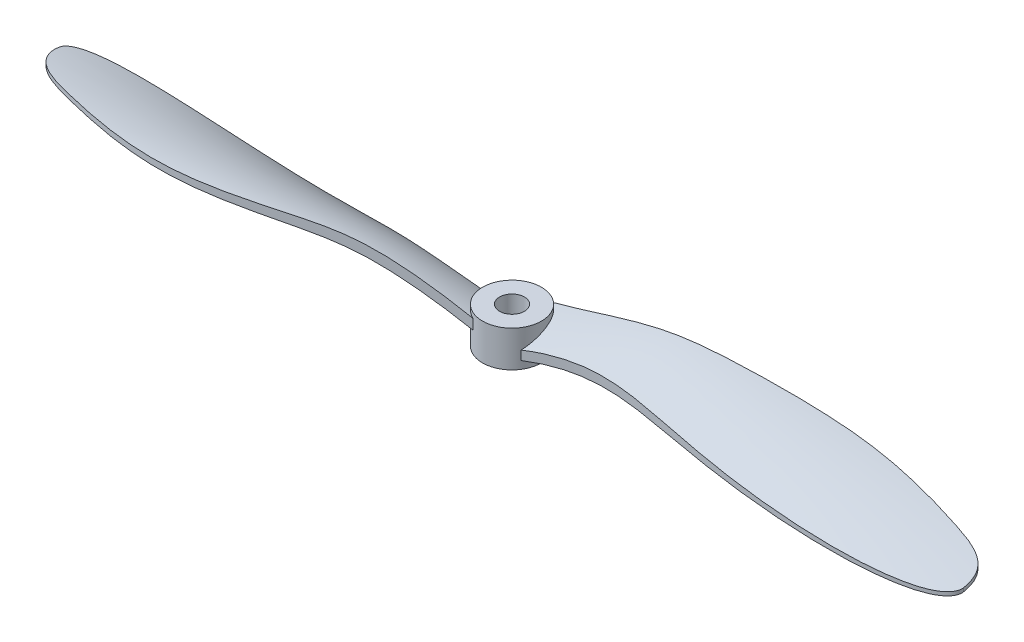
ISO-10303-21;
HEADER;
FILE_DESCRIPTION(('STEP AP214'),'2;1');
FILE_NAME('part.step','',(''),(''),'','','');
FILE_SCHEMA(('AUTOMOTIVE_DESIGN { 1 0 10303 214 1 1 1 1 }'));
ENDSEC;
DATA;
#1=APPLICATION_CONTEXT('core data for automotive mechanical design processes');
#2=APPLICATION_PROTOCOL_DEFINITION('international standard','automotive_design',2000,#1);
#3=PRODUCT_CONTEXT('',#1,'mechanical');
#4=PRODUCT('Part','Part','',(#3));
#5=PRODUCT_RELATED_PRODUCT_CATEGORY('part','',(#4));
#6=PRODUCT_DEFINITION_FORMATION('','',#4);
#7=PRODUCT_DEFINITION_CONTEXT('part definition',#1,'design');
#8=PRODUCT_DEFINITION('design','',#6,#7);
#9=PRODUCT_DEFINITION_SHAPE('','',#8);
#10=(LENGTH_UNIT() NAMED_UNIT(*) SI_UNIT(.MILLI.,.METRE.));
#11=(NAMED_UNIT(*) PLANE_ANGLE_UNIT() SI_UNIT($,.RADIAN.));
#12=(NAMED_UNIT(*) SI_UNIT($,.STERADIAN.) SOLID_ANGLE_UNIT());
#13=UNCERTAINTY_MEASURE_WITH_UNIT(LENGTH_MEASURE(1.E-05),#10,'distance_accuracy_value','');
#14=(GEOMETRIC_REPRESENTATION_CONTEXT(3) GLOBAL_UNCERTAINTY_ASSIGNED_CONTEXT((#13)) GLOBAL_UNIT_ASSIGNED_CONTEXT((#10,
#11,#12)) REPRESENTATION_CONTEXT('',''));
#15=CARTESIAN_POINT('',(0.,0.,0.));
#16=DIRECTION('',(0.,0.,1.));
#17=DIRECTION('',(1.,0.,0.));
#18=AXIS2_PLACEMENT_3D('',#15,#16,#17);
#19=CARTESIAN_POINT('',(2.32591131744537E-06,13.9045666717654,-2.44392182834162E-06));
#20=DIRECTION('',(0.,-1.,0.));
#21=DIRECTION('',(0.,0.,-1.));
#22=AXIS2_PLACEMENT_3D('',#19,#20,#21);
#23=CYLINDRICAL_SURFACE('',#22,5.6875);
#24=DIRECTION('',(0.,1.,0.));
#25=VECTOR('',#24,1.);
#26=CARTESIAN_POINT('',(-2.43221959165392,14.2227098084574,5.14119904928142));
#27=LINE('',#26,#25);
#28=CARTESIAN_POINT('',(-2.43221959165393,10.9286357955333,5.14119904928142));
#29=VERTEX_POINT('',#28);
#30=CARTESIAN_POINT('',(-2.43221959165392,12.9066665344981,5.14119904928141));
#31=VERTEX_POINT('',#30);
#32=EDGE_CURVE('E261',#29,#31,#27,.T.);
#33=ORIENTED_EDGE('',*,*,#32,.F.);
#34=CARTESIAN_POINT('',(2.32591131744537E-06,10.4645122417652,5.68749755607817));
#35=CARTESIAN_POINT('',(-0.155549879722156,10.5004743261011,5.68751078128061));
#36=CARTESIAN_POINT('',(-0.31133387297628,10.5354827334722,5.68111637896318));
#37=CARTESIAN_POINT('',(-0.622374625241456,10.6032208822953,5.65549219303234));
#38=CARTESIAN_POINT('',(-0.777631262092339,10.6359501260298,5.63625961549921));
#39=CARTESIAN_POINT('',(-1.08690055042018,10.6988123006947,5.58488200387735));
#40=CARTESIAN_POINT('',(-1.24090967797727,10.7289393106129,5.55270841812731));
#41=CARTESIAN_POINT('',(-1.54626337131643,10.7860698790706,5.47553521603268));
#42=CARTESIAN_POINT('',(-1.69760813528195,10.813073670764,5.43053655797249));
#43=CARTESIAN_POINT('',(-1.99685498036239,10.8635249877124,5.32778244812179));
#44=CARTESIAN_POINT('',(-2.14474985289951,10.8869655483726,5.27000254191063));
#45=CARTESIAN_POINT('',(-2.43568354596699,10.9297024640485,5.14201505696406));
#46=CARTESIAN_POINT('',(-2.57872252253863,10.9489989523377,5.07180787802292));
#47=CARTESIAN_POINT('',(-2.85867242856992,10.9828811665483,4.91944894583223));
#48=CARTESIAN_POINT('',(-2.9955900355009,10.9974721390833,4.83731064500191));
#49=CARTESIAN_POINT('',(-3.26234359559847,11.0214215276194,4.66157037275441));
#50=CARTESIAN_POINT('',(-3.39217996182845,11.0307802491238,4.5679690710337));
#51=CARTESIAN_POINT('',(-3.63802135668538,11.0434452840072,4.37444632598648));
#52=CARTESIAN_POINT('',(-3.75438572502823,11.0470046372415,4.27499779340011));
#53=CARTESIAN_POINT('',(-3.97873398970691,11.0484490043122,4.06702420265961));
#54=CARTESIAN_POINT('',(-4.08671839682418,11.046334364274,3.9584996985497));
#55=CARTESIAN_POINT('',(-4.29345113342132,11.0360792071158,3.73326410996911));
#56=CARTESIAN_POINT('',(-4.39220031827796,11.0279392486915,3.61655378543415));
#57=CARTESIAN_POINT('',(-4.57972106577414,11.0053731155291,3.37594933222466));
#58=CARTESIAN_POINT('',(-4.66849303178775,10.9909471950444,3.25205549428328));
#59=CARTESIAN_POINT('',(-4.83073611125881,10.9566571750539,3.00535562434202));
#60=CARTESIAN_POINT('',(-4.90478746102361,10.9371452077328,2.88288148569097));
#61=CARTESIAN_POINT('',(-5.04306636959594,10.892371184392,2.63351975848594));
#62=CARTESIAN_POINT('',(-5.10729395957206,10.8671091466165,2.50663218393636));
#63=CARTESIAN_POINT('',(-5.22565948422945,10.8109179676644,2.24947499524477));
#64=CARTESIAN_POINT('',(-5.27979852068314,10.7799894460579,2.11920575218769));
#65=CARTESIAN_POINT('',(-5.37787676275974,10.7126415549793,1.85627466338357));
#66=CARTESIAN_POINT('',(-5.4218157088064,10.6762220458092,1.72361275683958));
#67=CARTESIAN_POINT('',(-5.49993208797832,10.5977183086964,1.45536815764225));
#68=CARTESIAN_POINT('',(-5.53399549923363,10.5555755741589,1.31976939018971));
#69=CARTESIAN_POINT('',(-5.59183566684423,10.4662905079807,1.04800999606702));
#70=CARTESIAN_POINT('',(-5.6156089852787,10.419146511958,0.9118491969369));
#71=CARTESIAN_POINT('',(-5.67177389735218,10.2708168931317,0.503854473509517));
#72=CARTESIAN_POINT('',(-5.68906053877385,10.1626818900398,0.232332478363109));
#73=CARTESIAN_POINT('',(-5.68553216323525,9.91940510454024,-0.332310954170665));
#74=CARTESIAN_POINT('',(-5.6604849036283,9.78261568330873,-0.624671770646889));
#75=CARTESIAN_POINT('',(-5.56784593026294,9.49603924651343,-1.1960767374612));
#76=CARTESIAN_POINT('',(-5.50021761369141,9.34624114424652,-1.47510920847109));
#77=CARTESIAN_POINT('',(-5.31157257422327,9.01376153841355,-2.06012993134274));
#78=CARTESIAN_POINT('',(-5.18365282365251,8.82969877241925,-2.36310339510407));
#79=CARTESIAN_POINT('',(-4.87878527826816,8.45874019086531,-2.94141568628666));
#80=CARTESIAN_POINT('',(-4.70183972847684,8.27184450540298,-3.21675577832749));
#81=CARTESIAN_POINT('',(-4.38643973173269,7.98134113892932,-3.62524712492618));
#82=CARTESIAN_POINT('',(-4.26339412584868,7.87596380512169,-3.76925353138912));
#83=CARTESIAN_POINT('',(-4.00221621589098,7.66848986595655,-4.04549599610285));
#84=CARTESIAN_POINT('',(-3.8640867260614,7.56639265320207,-4.17773424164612));
#85=CARTESIAN_POINT('',(-3.57270415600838,7.36690095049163,-4.42951744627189));
#86=CARTESIAN_POINT('',(-3.41941098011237,7.26952000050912,-4.54902691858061));
#87=CARTESIAN_POINT('',(-3.09840478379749,7.08149550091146,-4.7734584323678));
#88=CARTESIAN_POINT('',(-2.93067702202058,6.99085901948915,-4.87836526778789));
#89=CARTESIAN_POINT('',(-2.7560854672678,6.90456667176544,-4.97510408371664));
#90=B_SPLINE_CURVE_WITH_KNOTS('',3,(#34,#35,#36,#37,#38,#39,#40,#41,#42,#43,#44,#45,#46,#47,#48,
#49,#50,#51,#52,#53,#54,#55,#56,#57,#58,#59,#60,#61,#62,#63,#64,#65,#66,#67,#68,#69,#70,#71,#72,
#73,#74,#75,#76,#77,#78,#79,#80,#81,#82,#83,#84,#85,#86,#87,#88,#89),.UNSPECIFIED.,.F.,.F.,(4,2,
2,2,2,2,2,2,2,2,2,2,2,2,2,2,2,2,2,2,2,2,2,2,2,2,2,4),(0.,0.478850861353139,0.957805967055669,
1.43782363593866,1.9178054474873,2.3987136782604,2.87960644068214,3.35996114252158,
3.84028779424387,4.29903358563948,4.75775139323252,5.21642667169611,5.67508339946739,
6.10790236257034,6.54071995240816,6.97349024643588,7.40627155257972,7.84386702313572,
8.28160858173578,9.15652799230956,10.1241728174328,11.0926505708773,12.2189140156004,
13.3451258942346,13.994647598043,14.6440483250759,15.2952145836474,15.9470539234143),.UNSPECIFIED.);
#91=CARTESIAN_POINT('',(-4.81153985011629,8.39426878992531,-3.0326115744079));
#92=VERTEX_POINT('',#91);
#93=EDGE_CURVE('E178',#29,#92,#90,.T.);
#94=ORIENTED_EDGE('',*,*,#93,.T.);
#95=DIRECTION('',(0.,1.,0.));
#96=VECTOR('',#95,1.);
#97=CARTESIAN_POINT('',(-4.81153985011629,9.86548115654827,-3.0326115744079));
#98=LINE('',#97,#96);
#99=CARTESIAN_POINT('',(-4.81153985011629,10.1456963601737,-3.0326115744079));
#100=VERTEX_POINT('',#99);
#101=EDGE_CURVE('E163',#100,#92,#98,.F.);
#102=ORIENTED_EDGE('',*,*,#101,.F.);
#103=CARTESIAN_POINT('',(2.32591131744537E-06,7.74744079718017,-5.68750244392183));
#104=CARTESIAN_POINT('',(-0.148438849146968,7.76618941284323,-5.6875323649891));
#105=CARTESIAN_POINT('',(-0.296364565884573,7.78877097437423,-5.68169282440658));
#106=CARTESIAN_POINT('',(-0.589903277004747,7.84131993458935,-5.65873296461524));
#107=CARTESIAN_POINT('',(-0.735517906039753,7.87128184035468,-5.64162101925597));
#108=CARTESIAN_POINT('',(-1.0223565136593,7.93810244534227,-5.5967328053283));
#109=CARTESIAN_POINT('',(-1.1636042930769,7.97491076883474,-5.5690329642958));
#110=CARTESIAN_POINT('',(-1.44183686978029,8.05512200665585,-5.50356317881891));
#111=CARTESIAN_POINT('',(-1.57882105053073,8.09852586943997,-5.46579178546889));
#112=CARTESIAN_POINT('',(-1.84730239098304,8.19124428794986,-5.38097628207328));
#113=CARTESIAN_POINT('',(-1.97881520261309,8.24054015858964,-5.33396119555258));
#114=CARTESIAN_POINT('',(-2.23622101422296,8.3445458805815,-5.23127229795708));
#115=CARTESIAN_POINT('',(-2.36211183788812,8.3992578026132,-5.17559517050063));
#116=CARTESIAN_POINT('',(-2.73093735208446,8.57071136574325,-4.9964349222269));
#117=CARTESIAN_POINT('',(-2.96478934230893,8.69468784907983,-4.86089917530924));
#118=CARTESIAN_POINT('',(-3.4307486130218,8.97143231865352,-4.54594413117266));
#119=CARTESIAN_POINT('',(-3.65963424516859,9.12587117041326,-4.3632874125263));
#120=CARTESIAN_POINT('',(-4.08313017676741,9.44551183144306,-3.96979326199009));
#121=CARTESIAN_POINT('',(-4.27772935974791,9.61071710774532,-3.75894672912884));
#122=CARTESIAN_POINT('',(-4.56129330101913,9.87930636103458,-3.40171536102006));
#123=CARTESIAN_POINT('',(-4.66152085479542,9.9811906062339,-3.26297788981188));
#124=CARTESIAN_POINT('',(-4.8489340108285,10.1855569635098,-2.97736230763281));
#125=CARTESIAN_POINT('',(-4.93611672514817,10.2880392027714,-2.83048240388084));
#126=CARTESIAN_POINT('',(-5.17775319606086,10.5949187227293,-2.3781095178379));
#127=CARTESIAN_POINT('',(-5.31221032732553,10.7986670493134,-2.06099058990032));
#128=CARTESIAN_POINT('',(-5.474670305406,11.1039072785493,-1.55270021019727));
#129=CARTESIAN_POINT('',(-5.52323594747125,11.2095493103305,-1.37025620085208));
#130=CARTESIAN_POINT('',(-5.60234214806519,11.4160593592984,-0.998721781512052));
#131=CARTESIAN_POINT('',(-5.63287988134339,11.5169266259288,-0.809630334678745));
#132=CARTESIAN_POINT('',(-5.67475801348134,11.7121088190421,-0.426434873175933));
#133=CARTESIAN_POINT('',(-5.68613263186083,11.8064351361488,-0.232340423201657));
#134=CARTESIAN_POINT('',(-5.68863021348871,11.9871732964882,0.159607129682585));
#135=CARTESIAN_POINT('',(-5.67976233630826,12.0735887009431,0.357458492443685));
#136=CARTESIAN_POINT('',(-5.64628883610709,12.2136545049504,0.698151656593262));
#137=CARTESIAN_POINT('',(-5.62689854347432,12.2696160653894,0.840573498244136));
#138=CARTESIAN_POINT('',(-5.57690951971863,12.3762069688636,1.12543424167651));
#139=CARTESIAN_POINT('',(-5.54631338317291,12.4268375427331,1.26787313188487));
#140=CARTESIAN_POINT('',(-5.47369074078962,12.5222698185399,1.55170201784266));
#141=CARTESIAN_POINT('',(-5.43167065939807,12.567074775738,1.69309255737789));
#142=CARTESIAN_POINT('',(-5.33607728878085,12.6504898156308,1.97379891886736));
#143=CARTESIAN_POINT('',(-5.2825035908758,12.6890996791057,2.1131146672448));
#144=CARTESIAN_POINT('',(-5.16358919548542,12.7599718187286,2.38906588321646));
#145=CARTESIAN_POINT('',(-5.09819832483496,12.7922057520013,2.52568705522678));
#146=CARTESIAN_POINT('',(-4.95603222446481,12.8499289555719,2.79436252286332));
#147=CARTESIAN_POINT('',(-4.87925696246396,12.8754182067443,2.92641680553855));
#148=CARTESIAN_POINT('',(-4.71473580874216,12.9196010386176,3.18470246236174));
#149=CARTESIAN_POINT('',(-4.62698993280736,12.9382946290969,3.3109338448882));
#150=CARTESIAN_POINT('',(-4.44111978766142,12.9689727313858,3.55636981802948));
#151=CARTESIAN_POINT('',(-4.34299607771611,12.9809576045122,3.67557478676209));
#152=CARTESIAN_POINT('',(-4.14461374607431,12.9978007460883,3.89747459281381));
#153=CARTESIAN_POINT('',(-4.04502988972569,13.0031140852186,4.00073963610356));
#154=CARTESIAN_POINT('',(-3.83823088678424,13.0084206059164,4.19954517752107));
#155=CARTESIAN_POINT('',(-3.73101310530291,13.008411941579,4.29508298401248));
#156=CARTESIAN_POINT('',(-3.50978500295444,13.0033922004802,4.47767682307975));
#157=CARTESIAN_POINT('',(-3.3957779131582,12.9983834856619,4.56473683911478));
#158=CARTESIAN_POINT('',(-3.16167548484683,12.983730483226,4.72990022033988));
#159=CARTESIAN_POINT('',(-3.04157788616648,12.9740844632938,4.80800022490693));
#160=CARTESIAN_POINT('',(-2.79466430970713,12.9504053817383,4.95564434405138));
#161=CARTESIAN_POINT('',(-2.66778468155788,12.9363207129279,5.02507365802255));
#162=CARTESIAN_POINT('',(-2.40946796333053,12.9042137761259,5.15392353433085));
#163=CARTESIAN_POINT('',(-2.27802913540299,12.886189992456,5.21334022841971));
#164=CARTESIAN_POINT('',(-2.01148572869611,12.8466179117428,5.32186476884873));
#165=CARTESIAN_POINT('',(-1.87638138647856,12.8250698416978,5.37097327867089));
#166=CARTESIAN_POINT('',(-1.60332863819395,12.7788410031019,5.45871300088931));
#167=CARTESIAN_POINT('',(-1.46537950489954,12.7541594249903,5.49734149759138));
#168=CARTESIAN_POINT('',(-1.10803200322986,12.6871333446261,5.58303085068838));
#169=CARTESIAN_POINT('',(-0.88708225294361,12.6427476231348,5.62232193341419));
#170=CARTESIAN_POINT('',(-0.554639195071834,12.5720961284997,5.66148876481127));
#171=CARTESIAN_POINT('',(-0.443756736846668,12.5478907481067,5.67124949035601));
#172=CARTESIAN_POINT('',(-0.221882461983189,12.4982326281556,5.68425279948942));
#173=CARTESIAN_POINT('',(-0.110890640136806,12.4727798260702,5.68749505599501));
#174=CARTESIAN_POINT('',(2.32591131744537E-06,12.4467643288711,5.68749755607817));
#175=B_SPLINE_CURVE_WITH_KNOTS('',3,(#103,#104,#105,#106,#107,#108,#109,#110,#111,#112,#113,
#114,#115,#116,#117,#118,#119,#120,#121,#122,#123,#124,#125,#126,#127,#128,#129,#130,#131,#132,
#133,#134,#135,#136,#137,#138,#139,#140,#141,#142,#143,#144,#145,#146,#147,#148,#149,#150,#151,
#152,#153,#154,#155,#156,#157,#158,#159,#160,#161,#162,#163,#164,#165,#166,#167,#168,#169,#170,
#171,#172,#173,#174),.UNSPECIFIED.,.F.,.F.,(4,2,2,2,2,2,2,2,2,2,2,2,2,2,2,2,2,2,2,2,2,2,2,2,2,2,
2,2,2,2,2,2,2,2,2,4),(0.,0.44865220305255,0.896971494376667,1.34211395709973,1.78732049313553,
2.23115086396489,2.6751515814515,3.56392859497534,4.55376131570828,5.54391437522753,
6.1409060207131,6.73802963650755,7.93275023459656,8.58107945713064,9.22951025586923,
9.87678192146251,10.5237607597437,10.9860463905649,11.448225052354,11.910144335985,
12.3720799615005,12.8360250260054,13.2999714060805,13.763917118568,14.227837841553,
14.6580048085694,15.0883209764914,15.5184339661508,15.9487077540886,16.3841812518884,
16.8198226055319,17.2554359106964,17.6911619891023,18.3755676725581,18.7171477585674,
19.058744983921),.UNSPECIFIED.);
#176=EDGE_CURVE('E254',#100,#31,#175,.T.);
#177=ORIENTED_EDGE('',*,*,#176,.T.);
#178=EDGE_LOOP('',(#33,#94,#102,#177));
#179=FACE_BOUND('',#178,.T.);
#180=CARTESIAN_POINT('',(2.32591131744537E-06,13.9045666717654,-2.44392182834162E-06));
#181=DIRECTION('',(0.,1.,0.));
#182=DIRECTION('',(0.,0.,1.));
#183=AXIS2_PLACEMENT_3D('',#180,#181,#182);
#184=CIRCLE('',#183,5.6875);
#185=CARTESIAN_POINT('',(2.32591131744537E-06,13.9045666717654,5.68749755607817));
#186=VERTEX_POINT('',#185);
#187=EDGE_CURVE('E182',#186,#186,#184,.T.);
#188=ORIENTED_EDGE('',*,*,#187,.F.);
#189=EDGE_LOOP('',(#188));
#190=FACE_BOUND('',#189,.T.);
#191=CARTESIAN_POINT('',(2.32591131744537E-06,6.90456667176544,-2.44392182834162E-06));
#192=DIRECTION('',(0.,1.,0.));
#193=DIRECTION('',(0.,0.,1.));
#194=AXIS2_PLACEMENT_3D('',#191,#192,#193);
#195=CIRCLE('',#194,5.6875);
#196=CARTESIAN_POINT('',(2.32591131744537E-06,6.90456667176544,5.68749755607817));
#197=VERTEX_POINT('',#196);
#198=EDGE_CURVE('E179',#197,#197,#195,.T.);
#199=ORIENTED_EDGE('',*,*,#198,.T.);
#200=EDGE_LOOP('',(#199));
#201=FACE_BOUND('',#200,.T.);
#202=CARTESIAN_POINT('',(2.32591131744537E-06,12.4467643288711,-5.68750244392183));
#203=CARTESIAN_POINT('',(0.154439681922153,12.4829908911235,-5.68751563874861));
#204=CARTESIAN_POINT('',(0.309140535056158,12.518148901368,-5.68121238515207));
#205=CARTESIAN_POINT('',(0.618095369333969,12.5859500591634,-5.65593796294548));
#206=CARTESIAN_POINT('',(0.772349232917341,12.618592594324,-5.63696372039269));
#207=CARTESIAN_POINT('',(1.07972624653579,12.6810414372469,-5.58625188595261));
#208=CARTESIAN_POINT('',(1.23284582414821,12.7108407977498,-5.55448397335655));
#209=CARTESIAN_POINT('',(1.53651658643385,12.7670630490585,-5.47825777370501));
#210=CARTESIAN_POINT('',(1.68706797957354,12.7934862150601,-5.43380052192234));
#211=CARTESIAN_POINT('',(1.98484810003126,12.8425209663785,-5.3322478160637));
#212=CARTESIAN_POINT('',(2.13206930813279,12.8651245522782,-5.27512640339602));
#213=CARTESIAN_POINT('',(2.42175515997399,12.9059257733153,-5.1485702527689));
#214=CARTESIAN_POINT('',(2.56421997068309,12.9241235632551,-5.07913594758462));
#215=CARTESIAN_POINT('',(2.84310803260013,12.9555479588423,-4.92844003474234));
#216=CARTESIAN_POINT('',(2.97953834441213,12.9687805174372,-4.84719275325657));
#217=CARTESIAN_POINT('',(3.2454131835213,12.9897596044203,-4.67335105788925));
#218=CARTESIAN_POINT('',(3.37485814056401,12.9975064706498,-4.5807573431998));
#219=CARTESIAN_POINT('',(3.61972612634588,13.0067733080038,-4.38956178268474));
#220=CARTESIAN_POINT('',(3.73552284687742,13.0085706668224,-4.29145178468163));
#221=CARTESIAN_POINT('',(3.95887027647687,13.006318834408,-4.0863219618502));
#222=CARTESIAN_POINT('',(4.06642151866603,13.0022700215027,-3.97930271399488));
#223=CARTESIAN_POINT('',(4.27244073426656,12.9879998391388,-3.75724396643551));
#224=CARTESIAN_POINT('',(4.37090925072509,12.9777788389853,-3.64220494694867));
#225=CARTESIAN_POINT('',(4.55803717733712,12.9509340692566,-3.40511317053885));
#226=CARTESIAN_POINT('',(4.64669695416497,12.9343105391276,-3.28306067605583));
#227=CARTESIAN_POINT('',(4.80899176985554,12.8956488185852,-3.03997611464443));
#228=CARTESIAN_POINT('',(4.88318675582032,12.8739611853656,-2.91926136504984));
#229=CARTESIAN_POINT('',(5.0219487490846,12.8247706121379,-2.67350739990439));
#230=CARTESIAN_POINT('',(5.08651262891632,12.7972657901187,-2.5484667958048));
#231=CARTESIAN_POINT('',(5.2057194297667,12.7365669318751,-2.29516070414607));
#232=CARTESIAN_POINT('',(5.26036685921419,12.703375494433,-2.16689671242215));
#233=CARTESIAN_POINT('',(5.3596979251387,12.6314849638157,-1.90802508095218));
#234=CARTESIAN_POINT('',(5.40437775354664,12.5927837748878,-1.77741656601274));
#235=CARTESIAN_POINT('',(5.48449252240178,12.5094166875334,-1.51245707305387));
#236=CARTESIAN_POINT('',(5.51974580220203,12.4646556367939,-1.37808111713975));
#237=CARTESIAN_POINT('',(5.58008170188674,12.3700945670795,-1.10880086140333));
#238=CARTESIAN_POINT('',(5.60516068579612,12.3202927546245,-0.97389639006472));
#239=CARTESIAN_POINT('',(5.66544733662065,12.163950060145,-0.569668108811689));
#240=CARTESIAN_POINT('',(5.68574570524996,12.0504280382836,-0.300690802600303));
#241=CARTESIAN_POINT('',(5.68923453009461,11.794568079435,0.261455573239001));
#242=CARTESIAN_POINT('',(5.6678347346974,11.6504143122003,0.55379999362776));
#243=CARTESIAN_POINT('',(5.58257642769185,11.3489782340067,1.12517647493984));
#244=CARTESIAN_POINT('',(5.51869734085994,11.1916895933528,1.40420201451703));
#245=CARTESIAN_POINT('',(5.33747121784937,10.8412147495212,1.99237410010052));
#246=CARTESIAN_POINT('',(5.21277642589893,10.6465314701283,2.29836017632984));
#247=CARTESIAN_POINT('',(4.91343698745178,10.2539811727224,2.8833837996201));
#248=CARTESIAN_POINT('',(4.73872346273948,10.056110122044,3.16238347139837));
#249=CARTESIAN_POINT('',(4.42876020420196,9.75124841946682,3.5732429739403));
#250=CARTESIAN_POINT('',(4.30965645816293,9.64234969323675,3.71609973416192));
#251=CARTESIAN_POINT('',(4.05659677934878,9.42776257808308,3.99080848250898));
#252=CARTESIAN_POINT('',(3.92263793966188,9.32207482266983,4.12265830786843));
#253=CARTESIAN_POINT('',(3.64033064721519,9.11576623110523,4.37393621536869));
#254=CARTESIAN_POINT('',(3.49199947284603,9.01513952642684,4.49337886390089));
#255=CARTESIAN_POINT('',(3.18118255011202,8.82065622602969,4.71852857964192));
#256=CARTESIAN_POINT('',(3.01870327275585,8.72679657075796,4.82424187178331));
#257=CARTESIAN_POINT('',(2.72796716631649,8.57302857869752,4.99254985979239));
#258=CARTESIAN_POINT('',(2.60298246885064,8.51101068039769,5.05889672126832));
#259=CARTESIAN_POINT('',(2.3464057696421,8.3921898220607,5.18288666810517));
#260=CARTESIAN_POINT('',(2.21481535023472,8.33538562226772,5.24053182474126));
#261=CARTESIAN_POINT('',(1.94582703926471,8.22783197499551,5.34623421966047));
#262=CARTESIAN_POINT('',(1.80844317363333,8.17706892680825,5.39431316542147));
#263=CARTESIAN_POINT('',(1.52836055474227,8.08214059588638,5.48025765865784));
#264=CARTESIAN_POINT('',(1.38566309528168,8.03797372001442,5.51812567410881));
#265=CARTESIAN_POINT('',(1.04071474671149,7.94141048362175,5.595215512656));
#266=CARTESIAN_POINT('',(0.836395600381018,7.8922420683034,5.62950805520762));
#267=CARTESIAN_POINT('',(0.52563526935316,7.82955547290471,5.66412269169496));
#268=CARTESIAN_POINT('',(0.421155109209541,7.81048151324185,5.6728573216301));
#269=CARTESIAN_POINT('',(0.211211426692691,7.77611165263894,5.68454697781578));
#270=CARTESIAN_POINT('',(0.105747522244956,7.76081728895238,5.68749965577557));
#271=CARTESIAN_POINT('',(2.32591131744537E-06,7.74744079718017,5.68749755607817));
#272=B_SPLINE_CURVE_WITH_KNOTS('',3,(#202,#203,#204,#205,#206,#207,#208,#209,#210,#211,#212,
#213,#214,#215,#216,#217,#218,#219,#220,#221,#222,#223,#224,#225,#226,#227,#228,#229,#230,#231,
#232,#233,#234,#235,#236,#237,#238,#239,#240,#241,#242,#243,#244,#245,#246,#247,#248,#249,#250,
#251,#252,#253,#254,#255,#256,#257,#258,#259,#260,#261,#262,#263,#264,#265,#266,#267,#268,#269,
#270,#271),.UNSPECIFIED.,.F.,.F.,(4,2,2,2,2,2,2,2,2,2,2,2,2,2,2,2,2,2,2,2,2,2,2,2,2,2,2,2,2,2,2,
2,2,2,4),(0.,0.475777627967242,0.951670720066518,1.42869836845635,1.90568710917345,
2.3836627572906,2.86162160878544,3.33900557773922,3.81636014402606,4.27111954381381,
4.72584951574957,5.18055228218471,5.63523804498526,6.06476149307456,6.49442411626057,
6.92389090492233,7.35352148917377,7.79091614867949,8.22846698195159,9.10312017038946,
10.0794966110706,11.0563463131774,12.2024913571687,13.3502223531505,13.9961233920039,
14.6421510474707,15.2874114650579,15.9323782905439,16.3954435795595,16.8583984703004,
17.3202905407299,17.7820708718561,18.4189161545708,18.7384179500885,19.0580494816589),.UNSPECIFIED.);
#273=CARTESIAN_POINT('',(2.43222424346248,12.9066665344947,-5.14120393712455));
#274=VERTEX_POINT('',#273);
#275=CARTESIAN_POINT('',(4.81154450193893,10.1456963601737,3.03260668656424));
#276=VERTEX_POINT('',#275);
#277=EDGE_CURVE('E282',#274,#276,#272,.T.);
#278=ORIENTED_EDGE('',*,*,#277,.F.);
#279=DIRECTION('',(0.,1.,0.));
#280=VECTOR('',#279,1.);
#281=CARTESIAN_POINT('',(2.43222424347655,14.2227098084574,-5.14120393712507));
#282=LINE('',#281,#280);
#283=CARTESIAN_POINT('',(2.43222424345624,10.9286357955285,-5.14120393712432));
#284=VERTEX_POINT('',#283);
#285=EDGE_CURVE('E123',#274,#284,#282,.F.);
#286=ORIENTED_EDGE('',*,*,#285,.T.);
#287=CARTESIAN_POINT('',(2.75609011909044,6.90456667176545,4.97509919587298));
#288=CARTESIAN_POINT('',(2.91301194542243,6.98212674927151,4.8881570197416));
#289=CARTESIAN_POINT('',(3.0644021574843,7.06320237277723,4.7946002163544));
#290=CARTESIAN_POINT('',(3.35555848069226,7.23096220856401,4.59553813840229));
#291=CARTESIAN_POINT('',(3.49533523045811,7.31764115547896,4.49004401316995));
#292=CARTESIAN_POINT('',(3.7625754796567,7.4950546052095,4.26857113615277));
#293=CARTESIAN_POINT('',(3.89007629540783,7.58577550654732,4.15262637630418));
#294=CARTESIAN_POINT('',(4.13299417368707,7.7702800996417,3.9109312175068));
#295=CARTESIAN_POINT('',(4.24840808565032,7.86406458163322,3.78517827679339));
#296=CARTESIAN_POINT('',(4.57526222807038,8.14748165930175,3.39548567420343));
#297=CARTESIAN_POINT('',(4.76852303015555,8.33999869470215,3.11809894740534));
#298=CARTESIAN_POINT('',(5.10381207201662,8.72407090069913,2.53235780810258));
#299=CARTESIAN_POINT('',(5.24574205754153,8.9156235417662,2.22394543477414));
#300=CARTESIAN_POINT('',(5.42160186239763,9.20337278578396,1.72861355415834));
#301=CARTESIAN_POINT('',(5.47524719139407,9.30314654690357,1.55057331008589));
#302=CARTESIAN_POINT('',(5.56522771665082,9.49841773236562,1.18778655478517));
#303=CARTESIAN_POINT('',(5.60156065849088,9.59391459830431,1.00303917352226));
#304=CARTESIAN_POINT('',(5.65584681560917,9.77898171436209,0.6283684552));
#305=CARTESIAN_POINT('',(5.67383325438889,9.86856240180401,0.43845511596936));
#306=CARTESIAN_POINT('',(5.69048076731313,10.0405404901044,0.0545892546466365));
#307=CARTESIAN_POINT('',(5.68914938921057,10.1229406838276,-0.139361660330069));
#308=CARTESIAN_POINT('',(5.66919498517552,10.2586278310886,-0.478196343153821));
#309=CARTESIAN_POINT('',(5.65520755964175,10.3138753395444,-0.622581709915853));
#310=CARTESIAN_POINT('',(5.6158517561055,10.4191822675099,-0.911682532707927));
#311=CARTESIAN_POINT('',(5.59048584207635,10.4692428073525,-1.05639791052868));
#312=CARTESIAN_POINT('',(5.52812546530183,10.5636766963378,-1.34510880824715));
#313=CARTESIAN_POINT('',(5.49113646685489,10.6080527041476,-1.48910463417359));
#314=CARTESIAN_POINT('',(5.4053842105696,10.6907372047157,-1.77533948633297));
#315=CARTESIAN_POINT('',(5.35662057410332,10.7290455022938,-1.91757845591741));
#316=CARTESIAN_POINT('',(5.24709696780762,10.7994289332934,-2.19969474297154));
#317=CARTESIAN_POINT('',(5.18628659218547,10.8314767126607,-2.33955936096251));
#318=CARTESIAN_POINT('',(5.05299070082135,10.8889366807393,-2.61503136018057));
#319=CARTESIAN_POINT('',(4.9805051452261,10.9143488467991,-2.75063872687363));
#320=CARTESIAN_POINT('',(4.82423686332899,10.9584742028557,-3.01631946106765));
#321=CARTESIAN_POINT('',(4.74045443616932,10.9771875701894,-3.14639297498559));
#322=CARTESIAN_POINT('',(4.56214700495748,11.0079911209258,-3.39978010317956));
#323=CARTESIAN_POINT('',(4.46762259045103,11.0200816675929,-3.52309408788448));
#324=CARTESIAN_POINT('',(4.27582438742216,11.0371985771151,-3.75310275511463));
#325=CARTESIAN_POINT('',(4.17925591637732,11.0426764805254,-3.86035343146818));
#326=CARTESIAN_POINT('',(3.97813198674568,11.0483738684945,-4.06730706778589));
#327=CARTESIAN_POINT('',(3.87357377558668,11.0485915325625,-4.16700740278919));
#328=CARTESIAN_POINT('',(3.65729457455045,11.0440813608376,-4.35806152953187));
#329=CARTESIAN_POINT('',(3.54557737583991,11.0393561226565,-4.44941967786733));
#330=CARTESIAN_POINT('',(3.31567204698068,11.0253255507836,-4.62328851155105));
#331=CARTESIAN_POINT('',(3.19748148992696,11.0160184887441,-4.70579584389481));
#332=CARTESIAN_POINT('',(2.95424336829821,10.9930985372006,-4.86222688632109));
#333=CARTESIAN_POINT('',(2.82913864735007,10.9794431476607,-4.93605558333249));
#334=CARTESIAN_POINT('',(2.57401777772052,10.9482720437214,-5.07377327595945));
#335=CARTESIAN_POINT('',(2.4439998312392,10.93075490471,-5.13765858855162));
#336=CARTESIAN_POINT('',(2.04780586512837,10.8730228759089,-5.31390453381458));
#337=CARTESIAN_POINT('',(1.77536753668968,10.8276152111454,-5.41093340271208));
#338=CARTESIAN_POINT('',(1.25276873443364,10.7319322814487,-5.55365540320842));
#339=CARTESIAN_POINT('',(1.00362840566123,10.6828093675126,-5.60395384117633));
#340=CARTESIAN_POINT('',(0.627942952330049,10.6042837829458,-5.65414188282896));
#341=CARTESIAN_POINT('',(0.502471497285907,10.5773217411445,-5.66666134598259));
#342=CARTESIAN_POINT('',(0.251294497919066,10.5219548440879,-5.68334216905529));
#343=CARTESIAN_POINT('',(0.125588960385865,10.4935500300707,-5.68750376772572));
#344=CARTESIAN_POINT('',(2.32591131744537E-06,10.4645122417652,-5.68750244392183));
#345=B_SPLINE_CURVE_WITH_KNOTS('',3,(#287,#288,#289,#290,#291,#292,#293,#294,#295,#296,#297,
#298,#299,#300,#301,#302,#303,#304,#305,#306,#307,#308,#309,#310,#311,#312,#313,#314,#315,#316,
#317,#318,#319,#320,#321,#322,#323,#324,#325,#326,#327,#328,#329,#330,#331,#332,#333,#334,#335,
#336,#337,#338,#339,#340,#341,#342,#343,#344),.UNSPECIFIED.,.F.,.F.,(4,2,2,2,2,2,2,2,2,2,2,2,2,
2,2,2,2,2,2,2,2,2,2,2,2,2,2,2,4),(0.,0.585963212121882,1.17138358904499,1.75496416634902,
2.33869648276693,3.50088861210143,4.66529370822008,5.29763909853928,5.93006681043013,
6.56134722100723,7.1923809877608,7.65759994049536,8.12271820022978,8.58761812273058,
9.05253299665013,9.51943588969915,9.98634037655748,10.4532325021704,10.9200990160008,
11.3528591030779,11.7857689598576,12.2184514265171,12.6512972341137,13.0885106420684,
13.5258856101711,14.4002037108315,15.1744292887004,15.5610154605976,15.9475905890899),.UNSPECIFIED.);
#346=CARTESIAN_POINT('',(4.81154450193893,8.39426878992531,3.03260668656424));
#347=VERTEX_POINT('',#346);
#348=EDGE_CURVE('E116',#347,#284,#345,.T.);
#349=ORIENTED_EDGE('',*,*,#348,.F.);
#350=DIRECTION('',(0.,1.,0.));
#351=VECTOR('',#350,1.);
#352=CARTESIAN_POINT('',(4.81154450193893,9.86548115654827,3.03260668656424));
#353=LINE('',#352,#351);
#354=EDGE_CURVE('E13',#347,#276,#353,.T.);
#355=ORIENTED_EDGE('',*,*,#354,.T.);
#356=EDGE_LOOP('',(#278,#286,#349,#355));
#357=FACE_BOUND('',#356,.T.);
#358=ADVANCED_FACE('F96',(#179,#190,#201,#357),#23,.T.);
#359=CARTESIAN_POINT('',(2.32591131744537E-06,13.9045666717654,-2.44392182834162E-06));
#360=DIRECTION('',(0.,1.,0.));
#361=DIRECTION('',(0.,0.,1.));
#362=AXIS2_PLACEMENT_3D('',#359,#360,#361);
#363=PLANE('',#362);
#364=CARTESIAN_POINT('',(2.32591131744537E-06,13.9045666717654,-2.44392182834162E-06));
#365=DIRECTION('',(0.,1.,0.));
#366=DIRECTION('',(0.,0.,1.));
#367=AXIS2_PLACEMENT_3D('',#364,#365,#366);
#368=CIRCLE('',#367,2.40625);
#369=CARTESIAN_POINT('',(2.32591131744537E-06,13.9045666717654,2.40624755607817));
#370=VERTEX_POINT('',#369);
#371=EDGE_CURVE('E214',#370,#370,#368,.T.);
#372=ORIENTED_EDGE('',*,*,#371,.F.);
#373=EDGE_LOOP('',(#372));
#374=FACE_BOUND('',#373,.T.);
#375=ORIENTED_EDGE('',*,*,#187,.T.);
#376=EDGE_LOOP('',(#375));
#377=FACE_BOUND('',#376,.T.);
#378=ADVANCED_FACE('F244',(#374,#377),#363,.T.);
#379=CARTESIAN_POINT('',(2.32591131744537E-06,6.90456667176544,-2.44392182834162E-06));
#380=DIRECTION('',(0.,1.,0.));
#381=DIRECTION('',(0.,0.,1.));
#382=AXIS2_PLACEMENT_3D('',#379,#380,#381);
#383=PLANE('',#382);
#384=CARTESIAN_POINT('',(2.32591131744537E-06,6.90456667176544,-2.44392182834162E-06));
#385=DIRECTION('',(0.,1.,0.));
#386=DIRECTION('',(0.,0.,1.));
#387=AXIS2_PLACEMENT_3D('',#384,#385,#386);
#388=CIRCLE('',#387,2.40625);
#389=CARTESIAN_POINT('',(2.32591131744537E-06,6.90456667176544,2.40624755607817));
#390=VERTEX_POINT('',#389);
#391=EDGE_CURVE('E103',#390,#390,#388,.T.);
#392=ORIENTED_EDGE('',*,*,#391,.T.);
#393=EDGE_LOOP('',(#392));
#394=FACE_BOUND('',#393,.T.);
#395=ORIENTED_EDGE('',*,*,#198,.F.);
#396=EDGE_LOOP('',(#395));
#397=FACE_BOUND('',#396,.T.);
#398=ADVANCED_FACE('F242',(#394,#397),#383,.F.);
#399=CARTESIAN_POINT('',(-88.8999976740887,9.1323595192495,-11.1125024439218));
#400=CARTESIAN_POINT('',(-47.0159198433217,6.15113155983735,-9.33632161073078));
#401=CARTESIAN_POINT('',(-33.584159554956,5.71381654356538,-7.36278735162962));
#402=CARTESIAN_POINT('',(-16.6126586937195,4.46760950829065,-8.27861945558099));
#403=CARTESIAN_POINT('',(-9.58692383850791,4.07411964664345,-9.81627221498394));
#404=CARTESIAN_POINT('',(2.32591131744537E-06,2.97056667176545,-11.1125024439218));
#405=CARTESIAN_POINT('',(-88.8999976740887,9.76176579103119,-9.33227267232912));
#406=CARTESIAN_POINT('',(-47.0159198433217,7.31185677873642,-8.04225466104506));
#407=CARTESIAN_POINT('',(-33.584159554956,7.46489614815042,-6.60890131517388));
#408=CARTESIAN_POINT('',(-16.6126586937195,6.34975415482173,-7.44332330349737));
#409=CARTESIAN_POINT('',(-9.58692383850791,5.78292498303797,-8.67988676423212));
#410=CARTESIAN_POINT('',(2.32591131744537E-06,4.53324821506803,-9.72230087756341));
#411=CARTESIAN_POINT('',(-88.8999976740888,10.8692490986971,-5.71831134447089));
#412=CARTESIAN_POINT('',(-47.0159198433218,9.45806488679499,-5.17322070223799));
#413=CARTESIAN_POINT('',(-33.584159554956,10.765242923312,-4.56756443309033));
#414=CARTESIAN_POINT('',(-16.6126586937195,9.86254343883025,-5.23611138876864));
#415=CARTESIAN_POINT('',(-9.58692383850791,8.9258486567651,-5.9822185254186));
#416=CARTESIAN_POINT('',(2.32591131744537E-06,7.3643778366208,-6.61118148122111));
#417=CARTESIAN_POINT('',(-88.8999976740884,12.0644549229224,-0.175949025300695));
#418=CARTESIAN_POINT('',(-47.0159198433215,11.932239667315,-0.167252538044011));
#419=CARTESIAN_POINT('',(-33.584159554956,14.6604943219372,-0.157589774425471));
#420=CARTESIAN_POINT('',(-16.6126586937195,13.9575794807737,-0.588524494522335));
#421=CARTESIAN_POINT('',(-9.58692383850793,12.5217438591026,-0.897844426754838));
#422=CARTESIAN_POINT('',(2.32591131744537E-06,10.5395008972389,-1.15859890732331));
#423=CARTESIAN_POINT('',(-88.8999976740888,12.7850581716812,5.44784222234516));
#424=CARTESIAN_POINT('',(-47.0159198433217,13.4899728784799,5.34147026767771));
#425=CARTESIAN_POINT('',(-33.584159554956,17.1483719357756,5.22327920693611));
#426=CARTESIAN_POINT('',(-16.6126586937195,16.5531696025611,5.01339098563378));
#427=CARTESIAN_POINT('',(-9.58692383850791,14.7743142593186,4.91812943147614));
#428=CARTESIAN_POINT('',(2.32591131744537E-06,12.5029081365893,4.83782462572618));
#429=CARTESIAN_POINT('',(-88.8999976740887,12.9455666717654,9.22427874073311));
#430=CARTESIAN_POINT('',(-47.0159198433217,13.8442426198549,9.18878864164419));
#431=CARTESIAN_POINT('',(-33.584159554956,17.7179319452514,9.14935519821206));
#432=CARTESIAN_POINT('',(-16.6126586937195,17.1452702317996,9.07940738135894));
#433=CARTESIAN_POINT('',(-9.58692383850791,15.2853282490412,9.04768050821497));
#434=CARTESIAN_POINT('',(2.32591131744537E-06,12.9455666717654,9.02093498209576));
#435=CARTESIAN_POINT('',(-88.8999976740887,12.9455666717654,11.1124975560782));
#436=CARTESIAN_POINT('',(-47.0159198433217,13.8442426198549,11.1124975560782));
#437=CARTESIAN_POINT('',(-33.584159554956,17.7179319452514,11.1124975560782));
#438=CARTESIAN_POINT('',(-16.6126586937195,17.1452702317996,11.1124975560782));
#439=CARTESIAN_POINT('',(-9.58692383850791,15.2853282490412,11.1124975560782));
#440=CARTESIAN_POINT('',(2.32591131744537E-06,12.9455666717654,11.1124975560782));
#441=B_SPLINE_SURFACE_WITH_KNOTS('',3,3,((#399,#400,#401,#402,#403,#404),(#405,#406,#407,#408,
#409,#410),(#411,#412,#413,#414,#415,#416),(#417,#418,#419,#420,#421,#422),(#423,#424,#425,#426,
#427,#428),(#429,#430,#431,#432,#433,#434),(#435,#436,#437,#438,#439,#440)),.UNSPECIFIED.,.F.,
.F.,.F.,(4,1,1,1,4),(4,1,1,4),(0.523143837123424,0.642357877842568,0.761571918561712,
0.880785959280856,1.),(0.,0.585589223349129,0.650654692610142,1.),.UNSPECIFIED.);
#442=CARTESIAN_POINT('',(-88.8999976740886,11.7186975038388,-1.61926033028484));
#443=CARTESIAN_POINT('',(-88.9000267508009,11.7097561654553,-1.66522827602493));
#444=CARTESIAN_POINT('',(-88.8977785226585,11.7007387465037,-1.71117308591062));
#445=CARTESIAN_POINT('',(-88.8888699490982,11.6826374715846,-1.80256035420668));
#446=CARTESIAN_POINT('',(-88.8822151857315,11.6735537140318,-1.84800337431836));
#447=CARTESIAN_POINT('',(-88.8647584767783,11.6555097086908,-1.93741886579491));
#448=CARTESIAN_POINT('',(-88.8540159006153,11.6465495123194,-1.98140301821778));
#449=CARTESIAN_POINT('',(-88.8286750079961,11.6286860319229,-2.06826344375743));
#450=CARTESIAN_POINT('',(-88.8140754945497,11.6197827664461,-2.11113936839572));
#451=CARTESIAN_POINT('',(-88.7772992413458,11.599873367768,-2.20610459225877));
#452=CARTESIAN_POINT('',(-88.7541407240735,11.5888974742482,-2.25782007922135));
#453=CARTESIAN_POINT('',(-88.7031472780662,11.5671777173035,-2.35894826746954));
#454=CARTESIAN_POINT('',(-88.6753099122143,11.5564339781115,-2.40835975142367));
#455=CARTESIAN_POINT('',(-88.6155492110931,11.5351548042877,-2.50508180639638));
#456=CARTESIAN_POINT('',(-88.5836035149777,11.5246209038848,-2.55237881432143));
#457=CARTESIAN_POINT('',(-88.5164627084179,11.5038357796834,-2.64463030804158));
#458=CARTESIAN_POINT('',(-88.4812680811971,11.4935845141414,-2.68958514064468));
#459=CARTESIAN_POINT('',(-88.3239418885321,11.4500781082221,-2.87820977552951));
#460=CARTESIAN_POINT('',(-88.1881224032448,11.4181714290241,-3.01098684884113));
#461=CARTESIAN_POINT('',(-87.9707041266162,11.3726327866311,-3.19398252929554));
#462=CARTESIAN_POINT('',(-87.8957531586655,11.3578073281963,-3.2524068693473));
#463=CARTESIAN_POINT('',(-87.7421922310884,11.32886804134,-3.36443838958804));
#464=CARTESIAN_POINT('',(-87.6635834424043,11.3147539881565,-3.41804709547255));
#465=CARTESIAN_POINT('',(-87.4813553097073,11.2833698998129,-3.53518532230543));
#466=CARTESIAN_POINT('',(-87.376834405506,11.2663073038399,-3.59735512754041));
#467=CARTESIAN_POINT('',(-87.1645128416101,11.2331637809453,-3.71553644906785));
#468=CARTESIAN_POINT('',(-87.0567188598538,11.2170810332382,-3.77155955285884));
#469=CARTESIAN_POINT('',(-86.8385131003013,11.1857557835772,-3.87839713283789));
#470=CARTESIAN_POINT('',(-86.7281020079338,11.1705130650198,-3.92921295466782));
#471=CARTESIAN_POINT('',(-86.5052196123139,11.1407661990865,-4.02634784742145));
#472=CARTESIAN_POINT('',(-86.3927480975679,11.1262621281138,-4.0726664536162));
#473=CARTESIAN_POINT('',(-86.1653507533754,11.097807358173,-4.16170311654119));
#474=CARTESIAN_POINT('',(-86.0504129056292,11.0838615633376,-4.20439190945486));
#475=CARTESIAN_POINT('',(-85.8192484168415,11.0565706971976,-4.2862561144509));
#476=CARTESIAN_POINT('',(-85.7030219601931,11.0432255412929,-4.32543202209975));
#477=CARTESIAN_POINT('',(-85.3527815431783,11.0039970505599,-4.43832087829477));
#478=CARTESIAN_POINT('',(-85.1171807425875,10.9789175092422,-4.50740481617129));
#479=CARTESIAN_POINT('',(-84.6561602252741,10.9318606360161,-4.63219745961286));
#480=CARTESIAN_POINT('',(-84.4308893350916,10.9097886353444,-4.68843138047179));
#481=CARTESIAN_POINT('',(-83.9785087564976,10.867000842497,-4.79361135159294));
#482=CARTESIAN_POINT('',(-83.7513988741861,10.8462851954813,-4.84255662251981));
#483=CARTESIAN_POINT('',(-83.2955983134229,10.8060174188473,-4.93435584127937));
#484=CARTESIAN_POINT('',(-83.0669061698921,10.7864665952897,-4.97720302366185));
#485=CARTESIAN_POINT('',(-82.6085045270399,10.7484186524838,-5.05763599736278));
#486=CARTESIAN_POINT('',(-82.3787949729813,10.7299215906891,-5.09522150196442));
#487=CARTESIAN_POINT('',(-81.9182812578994,10.6938524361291,-5.16588300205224));
#488=CARTESIAN_POINT('',(-81.6874760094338,10.6762816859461,-5.19895255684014));
#489=CARTESIAN_POINT('',(-81.2252596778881,10.6420107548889,-5.26108317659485));
#490=CARTESIAN_POINT('',(-80.9938485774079,10.6253105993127,-5.29014412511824));
#491=CARTESIAN_POINT('',(-80.2988373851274,10.576408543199,-5.37203616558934));
#492=CARTESIAN_POINT('',(-79.8345246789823,10.5454101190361,-5.41956673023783));
#493=CARTESIAN_POINT('',(-78.904563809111,10.4862244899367,-5.50332378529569));
#494=CARTESIAN_POINT('',(-78.4389152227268,10.4580383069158,-5.53954617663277));
#495=CARTESIAN_POINT('',(-77.5074082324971,10.4042669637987,-5.60260461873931));
#496=CARTESIAN_POINT('',(-77.0415507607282,10.3786787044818,-5.6294519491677));
#497=CARTESIAN_POINT('',(-76.1095843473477,10.3299050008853,-5.67528345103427));
#498=CARTESIAN_POINT('',(-75.6434756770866,10.3067182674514,-5.69427185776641));
#499=CARTESIAN_POINT('',(-74.7109416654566,10.2626176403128,-5.72552777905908));
#500=CARTESIAN_POINT('',(-74.244516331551,10.2417036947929,-5.73779544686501));
#501=CARTESIAN_POINT('',(-73.1616498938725,10.1957092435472,-5.75950199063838));
#502=CARTESIAN_POINT('',(-72.5451307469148,10.1714472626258,-5.76676759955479));
#503=CARTESIAN_POINT('',(-71.3119076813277,10.1266622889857,-5.7727022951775));
#504=CARTESIAN_POINT('',(-70.6952037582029,10.1061393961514,-5.77137115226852));
#505=CARTESIAN_POINT('',(-69.461252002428,10.0687914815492,-5.76131037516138));
#506=CARTESIAN_POINT('',(-68.8440041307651,10.0519694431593,-5.75257479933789));
#507=CARTESIAN_POINT('',(-67.609538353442,10.0220648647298,-5.72864899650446));
#508=CARTESIAN_POINT('',(-66.9923204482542,10.0089823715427,-5.71345868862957));
#509=CARTESIAN_POINT('',(-65.7575876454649,9.98660810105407,-5.67737690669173));
#510=CARTESIAN_POINT('',(-65.1400728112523,9.97731876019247,-5.6564817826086));
#511=CARTESIAN_POINT('',(-63.9051879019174,9.96263255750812,-5.60961692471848));
#512=CARTESIAN_POINT('',(-63.2878178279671,9.95723572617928,-5.58364715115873));
#513=CARTESIAN_POINT('',(-61.4357575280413,9.94704754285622,-5.49891748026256));
#514=CARTESIAN_POINT('',(-60.2013364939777,9.94826254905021,-5.43334403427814));
#515=CARTESIAN_POINT('',(-57.7339940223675,9.96785259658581,-5.28732067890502));
#516=CARTESIAN_POINT('',(-56.5010721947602,9.98622116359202,-5.20687639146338));
#517=CARTESIAN_POINT('',(-54.0377281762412,10.0414865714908,-5.03356449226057));
#518=CARTESIAN_POINT('',(-52.8073047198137,10.0783652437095,-4.94070912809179));
#519=CARTESIAN_POINT('',(-50.3406958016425,10.1724579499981,-4.74379728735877));
#520=CARTESIAN_POINT('',(-49.1045200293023,10.2297925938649,-4.639676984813));
#521=CARTESIAN_POINT('',(-46.6348531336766,10.366271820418,-4.42232026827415));
#522=CARTESIAN_POINT('',(-45.4013609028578,10.4454043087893,-4.30908893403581));
#523=CARTESIAN_POINT('',(-43.5529816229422,10.5812997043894,-4.13340800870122));
#524=CARTESIAN_POINT('',(-42.937172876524,10.6294635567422,-4.07387617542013));
#525=CARTESIAN_POINT('',(-41.7062057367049,10.7315529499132,-3.95304075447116));
#526=CARTESIAN_POINT('',(-41.0910473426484,10.7854784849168,-3.89173716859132));
#527=CARTESIAN_POINT('',(-39.861122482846,10.8990620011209,-3.76748839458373));
#528=CARTESIAN_POINT('',(-39.2463563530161,10.9587227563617,-3.70454242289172));
#529=CARTESIAN_POINT('',(-38.017510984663,11.0834269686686,-3.57732135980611));
#530=CARTESIAN_POINT('',(-37.4034317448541,11.1484704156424,-3.51304627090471));
#531=CARTESIAN_POINT('',(-36.1753321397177,11.283126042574,-3.38374215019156));
#532=CARTESIAN_POINT('',(-35.5613122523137,11.3527419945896,-3.31871253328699));
#533=CARTESIAN_POINT('',(-34.3336150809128,11.4950692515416,-3.18878050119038));
#534=CARTESIAN_POINT('',(-33.7199378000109,11.5677805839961,-3.12387808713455));
#535=CARTESIAN_POINT('',(-32.4921298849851,11.7142755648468,-2.99511995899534));
#536=CARTESIAN_POINT('',(-31.8779992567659,11.7880599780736,-2.93126506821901));
#537=CARTESIAN_POINT('',(-30.6492981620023,11.9337698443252,-2.80573611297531));
#538=CARTESIAN_POINT('',(-30.0347277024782,12.0056953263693,-2.7440620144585));
#539=CARTESIAN_POINT('',(-28.9344313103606,12.1291195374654,-2.63692354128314));
#540=CARTESIAN_POINT('',(-28.44889728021,12.1817248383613,-2.59078597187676));
#541=CARTESIAN_POINT('',(-27.477187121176,12.2808975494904,-2.50144053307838));
#542=CARTESIAN_POINT('',(-26.9910114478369,12.3274680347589,-2.45823117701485));
#543=CARTESIAN_POINT('',(-26.0179659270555,12.4119440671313,-2.37547390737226));
#544=CARTESIAN_POINT('',(-25.5310969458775,12.4498565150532,-2.33592309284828));
#545=CARTESIAN_POINT('',(-24.8001606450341,12.4981404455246,-2.27989833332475));
#546=CARTESIAN_POINT('',(-24.5565014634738,12.5128003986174,-2.26177984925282));
#547=CARTESIAN_POINT('',(-24.0689343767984,12.5390727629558,-2.22673552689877));
#548=CARTESIAN_POINT('',(-23.8250264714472,12.5506851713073,-2.20980968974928));
#549=CARTESIAN_POINT('',(-23.0931872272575,12.5808171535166,-2.16098442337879));
#550=CARTESIAN_POINT('',(-22.6049173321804,12.5946464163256,-2.1310199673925));
#551=CARTESIAN_POINT('',(-21.8721239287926,12.6056542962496,-2.09054744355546));
#552=CARTESIAN_POINT('',(-21.6277845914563,12.6077008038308,-2.07780186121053));
#553=CARTESIAN_POINT('',(-21.1390222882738,12.6085330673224,-2.05390189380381));
#554=CARTESIAN_POINT('',(-20.8945993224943,12.6073188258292,-2.04274750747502));
#555=CARTESIAN_POINT('',(-20.1669306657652,12.5986417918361,-2.01205906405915));
#556=CARTESIAN_POINT('',(-19.6836259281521,12.5862338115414,-1.99498311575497));
#557=CARTESIAN_POINT('',(-18.7168707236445,12.5475582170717,-1.96818237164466));
#558=CARTESIAN_POINT('',(-18.2334206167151,12.5212763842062,-1.95846514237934));
#559=CARTESIAN_POINT('',(-17.2670511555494,12.4548330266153,-1.94713488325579));
#560=CARTESIAN_POINT('',(-16.7841323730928,12.4146622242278,-1.94552728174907));
#561=CARTESIAN_POINT('',(-15.8194652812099,12.3208926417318,-1.95112069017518));
#562=CARTESIAN_POINT('',(-15.3377174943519,12.2672886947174,-1.95832509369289));
#563=CARTESIAN_POINT('',(-14.3759949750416,12.1474439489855,-1.98219023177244));
#564=CARTESIAN_POINT('',(-13.8960203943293,12.0812020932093,-1.99885175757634));
#565=CARTESIAN_POINT('',(-12.9384174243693,11.9370691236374,-2.0422164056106));
#566=CARTESIAN_POINT('',(-12.4607884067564,11.8591813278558,-2.068916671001));
#567=CARTESIAN_POINT('',(-11.6444133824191,11.7165728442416,-2.12373926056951));
#568=CARTESIAN_POINT('',(-11.3050319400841,11.6544612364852,-2.14926879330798));
#569=CARTESIAN_POINT('',(-10.6278331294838,11.5252002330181,-2.20588249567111));
#570=CARTESIAN_POINT('',(-10.2900151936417,11.4580528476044,-2.23696445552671));
#571=CARTESIAN_POINT('',(-9.61603041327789,11.3190617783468,-2.30484097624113));
#572=CARTESIAN_POINT('',(-9.27986310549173,11.2472195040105,-2.34163382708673));
#573=CARTESIAN_POINT('',(-8.60926639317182,11.0991515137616,-2.42107478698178));
#574=CARTESIAN_POINT('',(-8.27483663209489,11.0229267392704,-2.46372164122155));
#575=CARTESIAN_POINT('',(-7.607807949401,10.8663752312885,-2.55499690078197));
#576=CARTESIAN_POINT('',(-7.27520878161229,10.7860490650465,-2.60362448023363));
#577=CARTESIAN_POINT('',(-6.6119393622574,10.6215430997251,-2.70696988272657));
#578=CARTESIAN_POINT('',(-6.28126898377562,10.5373635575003,-2.76168730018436));
#579=CARTESIAN_POINT('',(-5.61383268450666,10.3632457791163,-2.87872782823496));
#580=CARTESIAN_POINT('',(-5.27711749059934,10.2732167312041,-2.94120520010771));
#581=CARTESIAN_POINT('',(-4.6059380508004,10.0895354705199,-3.0727242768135));
#582=CARTESIAN_POINT('',(-4.27147396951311,9.99588299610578,-3.14176645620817));
#583=CARTESIAN_POINT('',(-3.60491911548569,9.80511829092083,-3.28646788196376));
#584=CARTESIAN_POINT('',(-3.2728286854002,9.7080055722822,-3.36212806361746));
#585=CARTESIAN_POINT('',(-2.61114745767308,9.51045224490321,-3.52009425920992));
#586=CARTESIAN_POINT('',(-2.28155720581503,9.41001093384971,-3.60240168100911));
#587=CARTESIAN_POINT('',(-1.6250054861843,9.20590526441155,-3.77366899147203));
#588=CARTESIAN_POINT('',(-1.29804479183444,9.10223999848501,-3.86263076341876));
#589=CARTESIAN_POINT('',(-0.646883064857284,8.8917591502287,-4.04718205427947));
#590=CARTESIAN_POINT('',(-0.322683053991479,8.78494246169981,-4.14277391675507));
#591=CARTESIAN_POINT('',(2.32591131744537E-06,8.67660971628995,-4.2416471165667));
#592=B_SPLINE_CURVE_WITH_KNOTS('',3,(#442,#443,#444,#445,#446,#447,#448,#449,#450,#451,#452,
#453,#454,#455,#456,#457,#458,#459,#460,#461,#462,#463,#464,#465,#466,#467,#468,#469,#470,#471,
#472,#473,#474,#475,#476,#477,#478,#479,#480,#481,#482,#483,#484,#485,#486,#487,#488,#489,#490,
#491,#492,#493,#494,#495,#496,#497,#498,#499,#500,#501,#502,#503,#504,#505,#506,#507,#508,#509,
#510,#511,#512,#513,#514,#515,#516,#517,#518,#519,#520,#521,#522,#523,#524,#525,#526,#527,#528,
#529,#530,#531,#532,#533,#534,#535,#536,#537,#538,#539,#540,#541,#542,#543,#544,#545,#546,#547,
#548,#549,#550,#551,#552,#553,#554,#555,#556,#557,#558,#559,#560,#561,#562,#563,#564,#565,#566,
#567,#568,#569,#570,#571,#572,#573,#574,#575,#576,#577,#578,#579,#580,#581,#582,#583,#584,#585,
#586,#587,#588,#589,#590,#591),.UNSPECIFIED.,.F.,.F.,(4,2,2,2,2,2,2,2,2,2,2,2,2,2,2,2,2,2,2,2,2,
2,2,2,2,2,2,2,2,2,2,2,2,2,2,2,2,2,2,2,2,2,2,2,2,2,2,2,2,2,2,2,2,2,2,2,2,2,2,2,2,2,2,2,2,2,2,2,2,
2,2,2,2,2,4),(0.,0.140420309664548,0.280663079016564,0.418942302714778,0.557264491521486,
0.730137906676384,0.903101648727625,1.07705014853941,1.25097281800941,1.82512044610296,
2.11358389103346,2.40195561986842,2.77012517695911,3.13758829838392,3.50495622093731,
3.87236206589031,4.24249385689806,4.61257335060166,5.352649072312,6.0522050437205,
6.75183576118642,7.45223672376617,8.15267583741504,8.85410371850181,9.5555519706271,
10.9586469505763,12.362249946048,13.7641583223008,15.16531020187,16.5664301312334,
18.4174603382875,20.2685399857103,22.1211064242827,23.9736960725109,25.8274738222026,
27.6812660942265,31.3895087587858,35.0963523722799,38.79956461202,42.5249822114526,
46.2483369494,48.1099668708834,49.9715949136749,51.8341279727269,53.6966575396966,
55.5607433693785,57.4248457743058,59.2903491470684,61.155823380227,62.6274424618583,
64.0983087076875,65.5679984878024,66.3022914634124,67.0365851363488,68.5045001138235,
69.2385182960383,69.9725358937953,71.423571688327,72.8760974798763,74.3295954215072,
75.7836532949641,77.2378328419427,78.691598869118,79.7294043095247,80.7667976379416,
81.8038809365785,82.8407422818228,83.8774606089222,84.9141099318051,85.9763186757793,
87.0386042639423,88.1010402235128,89.1637017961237,90.2266652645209,91.2900063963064),.UNSPECIFIED.);
#593=CARTESIAN_POINT('',(-88.8999976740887,11.7187081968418,-1.61926033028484));
#594=VERTEX_POINT('',#593);
#595=EDGE_CURVE('E175',#594,#100,#592,.T.);
#596=CARTESIAN_POINT('',(2.32591131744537E-06,12.3280667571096,5.08239479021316));
#597=CARTESIAN_POINT('',(-0.514824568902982,12.4488189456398,5.088024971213));
#598=CARTESIAN_POINT('',(-1.02932589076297,12.5706968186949,5.09813042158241));
#599=CARTESIAN_POINT('',(-2.05877994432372,12.8165417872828,5.12671811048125));
#600=CARTESIAN_POINT('',(-2.57373123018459,12.9405128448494,5.1452184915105));
#601=CARTESIAN_POINT('',(-3.60388773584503,13.1900806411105,5.19003333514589));
#602=CARTESIAN_POINT('',(-4.11909171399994,13.3156799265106,5.21636194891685));
#603=CARTESIAN_POINT('',(-5.14960615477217,13.5678702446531,5.27627949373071));
#604=CARTESIAN_POINT('',(-5.66491573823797,13.6944624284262,5.30987863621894));
#605=CARTESIAN_POINT('',(-6.69553067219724,13.9478425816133,5.38378891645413));
#606=CARTESIAN_POINT('',(-7.21083554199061,14.0746306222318,5.42410647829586));
#607=CARTESIAN_POINT('',(-8.24137979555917,14.3274052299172,5.5109156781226));
#608=CARTESIAN_POINT('',(-8.75661903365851,14.4533913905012,5.55741022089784));
#609=CARTESIAN_POINT('',(-9.77617581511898,14.7007028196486,5.65500979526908));
#610=CARTESIAN_POINT('',(-10.2804944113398,14.8220703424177,5.7059968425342));
#611=CARTESIAN_POINT('',(-11.2891712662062,15.0614851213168,5.81291263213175));
#612=CARTESIAN_POINT('',(-11.793529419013,15.1795337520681,5.86883928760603));
#613=CARTESIAN_POINT('',(-12.8024218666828,15.4106791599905,5.98517652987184));
#614=CARTESIAN_POINT('',(-13.3069556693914,15.5237799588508,6.04558336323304));
#615=CARTESIAN_POINT('',(-14.3163867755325,15.7431562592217,6.1704391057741));
#616=CARTESIAN_POINT('',(-14.8212829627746,15.8494395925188,6.23488320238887));
#617=CARTESIAN_POINT('',(-15.8316653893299,16.0531101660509,6.36738512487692));
#618=CARTESIAN_POINT('',(-16.3371498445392,16.1505095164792,6.43543782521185));
#619=CARTESIAN_POINT('',(-17.3489605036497,16.3342334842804,6.57473856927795));
#620=CARTESIAN_POINT('',(-17.8552845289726,16.4205734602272,6.64598199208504));
#621=CARTESIAN_POINT('',(-18.7820990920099,16.5663708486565,6.77879275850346));
#622=CARTESIAN_POINT('',(-19.2023279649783,16.6278962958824,6.83990901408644));
#623=CARTESIAN_POINT('',(-20.0439095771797,16.7408153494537,6.96384756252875));
#624=CARTESIAN_POINT('',(-20.465262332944,16.7922088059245,7.02666988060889));
#625=CARTESIAN_POINT('',(-21.3089887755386,16.8839004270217,7.1537494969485));
#626=CARTESIAN_POINT('',(-21.7313625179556,16.9241979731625,7.21800687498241));
#627=CARTESIAN_POINT('',(-22.5768951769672,16.9929569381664,7.34765997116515));
#628=CARTESIAN_POINT('',(-23.0000540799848,17.0214185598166,7.41305566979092));
#629=CARTESIAN_POINT('',(-23.8473046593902,17.0661158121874,7.54474267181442));
#630=CARTESIAN_POINT('',(-24.271396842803,17.0823395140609,7.61103478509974));
#631=CARTESIAN_POINT('',(-25.1197897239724,17.1024074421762,7.74413239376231));
#632=CARTESIAN_POINT('',(-25.5440904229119,17.1062515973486,7.81093789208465));
#633=CARTESIAN_POINT('',(-26.3935337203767,17.1029332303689,7.94488848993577));
#634=CARTESIAN_POINT('',(-26.8186761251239,17.0957465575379,8.01203401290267));
#635=CARTESIAN_POINT('',(-27.6687102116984,17.0719858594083,8.14621616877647));
#636=CARTESIAN_POINT('',(-28.0936018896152,17.0554116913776,8.21325280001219));
#637=CARTESIAN_POINT('',(-28.94388367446,17.0145045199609,8.34705711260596));
#638=CARTESIAN_POINT('',(-29.3692731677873,16.9901566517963,8.41382402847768));
#639=CARTESIAN_POINT('',(-30.2197608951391,16.935283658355,8.5466827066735));
#640=CARTESIAN_POINT('',(-30.6448591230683,16.9047584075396,8.61277445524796));
#641=CARTESIAN_POINT('',(-31.4949192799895,16.8389122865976,8.74402436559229));
#642=CARTESIAN_POINT('',(-31.919881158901,16.8035903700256,8.80918232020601));
#643=CARTESIAN_POINT('',(-32.7696720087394,16.7293372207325,8.93827917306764));
#644=CARTESIAN_POINT('',(-33.1945009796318,16.6904059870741,9.00221807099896));
#645=CARTESIAN_POINT('',(-34.0454541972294,16.6097897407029,9.12880007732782));
#646=CARTESIAN_POINT('',(-34.4715783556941,16.5680965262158,9.19143852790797));
#647=CARTESIAN_POINT('',(-35.3239006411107,16.4828645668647,9.31493060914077));
#648=CARTESIAN_POINT('',(-35.7500987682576,16.4393258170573,9.37578423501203));
#649=CARTESIAN_POINT('',(-37.0277919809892,16.3070713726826,9.55507315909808));
#650=CARTESIAN_POINT('',(-37.879543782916,16.2166039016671,9.67041037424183));
#651=CARTESIAN_POINT('',(-39.5833665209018,16.0348702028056,9.8902648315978));
#652=CARTESIAN_POINT('',(-40.4354359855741,15.943605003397,9.99479426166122));
#653=CARTESIAN_POINT('',(-42.1405585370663,15.7626199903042,10.190502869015));
#654=CARTESIAN_POINT('',(-42.9936102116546,15.6728989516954,10.2816931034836));
#655=CARTESIAN_POINT('',(-44.7012935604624,15.4965197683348,10.4480061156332));
#656=CARTESIAN_POINT('',(-45.5559245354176,15.4098605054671,10.5231348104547));
#657=CARTESIAN_POINT('',(-47.2673267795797,15.2405584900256,10.6543844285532));
#658=CARTESIAN_POINT('',(-48.1240986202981,15.1579169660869,10.7104995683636));
#659=CARTESIAN_POINT('',(-49.8047810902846,15.000538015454,10.7986495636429));
#660=CARTESIAN_POINT('',(-50.6286267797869,14.9256163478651,10.831562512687));
#661=CARTESIAN_POINT('',(-51.8653833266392,14.816649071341,10.8632607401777));
#662=CARTESIAN_POINT('',(-52.2779267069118,14.7808854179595,10.8708812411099));
#663=CARTESIAN_POINT('',(-53.1031839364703,14.7105128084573,10.8798208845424));
#664=CARTESIAN_POINT('',(-53.5158977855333,14.6759038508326,10.8811400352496));
#665=CARTESIAN_POINT('',(-54.3414265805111,14.60783511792,10.8770742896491));
#666=CARTESIAN_POINT('',(-54.7542415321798,14.5743754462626,10.8716887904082));
#667=CARTESIAN_POINT('',(-55.5798074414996,14.5085887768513,10.8537752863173));
#668=CARTESIAN_POINT('',(-55.9925583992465,14.4762617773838,10.8412472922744));
#669=CARTESIAN_POINT('',(-56.8178224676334,14.412710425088,10.8089859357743));
#670=CARTESIAN_POINT('',(-57.2303355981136,14.3814859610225,10.7892533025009));
#671=CARTESIAN_POINT('',(-58.0550303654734,14.3200886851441,10.7426066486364));
#672=CARTESIAN_POINT('',(-58.4672120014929,14.2899158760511,10.715692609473));
#673=CARTESIAN_POINT('',(-59.7028761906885,14.2009020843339,10.6242709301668));
#674=CARTESIAN_POINT('',(-60.5256995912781,14.1435487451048,10.5490750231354));
#675=CARTESIAN_POINT('',(-62.166251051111,14.0324002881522,10.3715240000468));
#676=CARTESIAN_POINT('',(-62.9839869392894,13.9785955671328,10.2692462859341));
#677=CARTESIAN_POINT('',(-64.616187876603,13.8737237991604,10.0391899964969));
#678=CARTESIAN_POINT('',(-65.4306522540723,13.8226572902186,9.91140643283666));
#679=CARTESIAN_POINT('',(-67.0559131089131,13.7226575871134,9.63257427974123));
#680=CARTESIAN_POINT('',(-67.8667085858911,13.6737249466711,9.48151969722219));
#681=CARTESIAN_POINT('',(-69.4843111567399,13.5774916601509,9.15869590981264));
#682=CARTESIAN_POINT('',(-70.291117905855,13.5301911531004,8.9869249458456));
#683=CARTESIAN_POINT('',(-71.9004653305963,13.4368625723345,8.62536245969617));
#684=CARTESIAN_POINT('',(-72.7030073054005,13.3908340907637,8.43557680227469));
#685=CARTESIAN_POINT('',(-73.9826326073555,13.318095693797,8.11985826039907));
#686=CARTESIAN_POINT('',(-74.4609356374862,13.291053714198,7.99890467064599));
#687=CARTESIAN_POINT('',(-75.41616451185,13.2373239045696,7.75198463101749));
#688=CARTESIAN_POINT('',(-75.8930906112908,13.2106360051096,7.62601918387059));
#689=CARTESIAN_POINT('',(-76.8463161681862,13.1575716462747,7.3693991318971));
#690=CARTESIAN_POINT('',(-77.3226141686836,13.1311956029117,7.23873903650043));
#691=CARTESIAN_POINT('',(-78.0362234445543,13.0918970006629,7.03966416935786));
#692=CARTESIAN_POINT('',(-78.2739584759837,13.0788414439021,6.97279034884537));
#693=CARTESIAN_POINT('',(-78.7491691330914,13.0528246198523,6.83810594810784));
#694=CARTESIAN_POINT('',(-78.9866447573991,13.0398633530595,6.7702953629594));
#695=CARTESIAN_POINT('',(-79.4334682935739,13.015542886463,6.64165118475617));
#696=CARTESIAN_POINT('',(-79.6428483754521,13.0041740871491,6.58093212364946));
#697=CARTESIAN_POINT('',(-80.0611129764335,12.9814339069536,6.45782478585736));
#698=CARTESIAN_POINT('',(-80.2699974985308,12.9700625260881,6.39543651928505));
#699=CARTESIAN_POINT('',(-80.8956448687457,12.9358390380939,6.20461902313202));
#700=CARTESIAN_POINT('',(-81.3113282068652,12.9128815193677,6.07255761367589));
#701=CARTESIAN_POINT('',(-81.9304687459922,12.8777406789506,5.86243506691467));
#702=CARTESIAN_POINT('',(-82.135998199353,12.8659168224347,5.79043517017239));
#703=CARTESIAN_POINT('',(-82.5452435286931,12.8419237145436,5.64152203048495));
#704=CARTESIAN_POINT('',(-82.7489595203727,12.829754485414,5.56460910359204));
#705=CARTESIAN_POINT('',(-83.1539604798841,12.8049557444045,5.40496047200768));
#706=CARTESIAN_POINT('',(-83.3552466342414,12.7923264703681,5.32222775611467));
#707=CARTESIAN_POINT('',(-83.7548471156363,12.7664577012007,5.14986304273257));
#708=CARTESIAN_POINT('',(-83.9531610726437,12.7532181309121,5.06023019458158));
#709=CARTESIAN_POINT('',(-84.3645810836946,12.7246687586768,4.86406582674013));
#710=CARTESIAN_POINT('',(-84.5773050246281,12.7092817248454,4.75673785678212));
#711=CARTESIAN_POINT('',(-84.9966197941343,12.6773186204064,4.53092809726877));
#712=CARTESIAN_POINT('',(-85.2032124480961,12.6607429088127,4.41244967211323));
#713=CARTESIAN_POINT('',(-85.608351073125,12.6260926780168,4.16270701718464));
#714=CARTESIAN_POINT('',(-85.8068997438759,12.6080186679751,4.03144712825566));
#715=CARTESIAN_POINT('',(-86.1935350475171,12.5700101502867,3.75453430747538));
#716=CARTESIAN_POINT('',(-86.3816245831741,12.5500761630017,3.60888540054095));
#717=CARTESIAN_POINT('',(-86.7048605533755,12.5125350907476,3.33529756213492));
#718=CARTESIAN_POINT('',(-86.8426248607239,12.4953647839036,3.21039593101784));
#719=CARTESIAN_POINT('',(-87.108226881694,12.459450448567,2.95062490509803));
#720=CARTESIAN_POINT('',(-87.236065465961,12.4407065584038,2.81575638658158));
#721=CARTESIAN_POINT('',(-87.479812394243,12.4015070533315,2.53632032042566));
#722=CARTESIAN_POINT('',(-87.595744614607,12.3810550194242,2.39177318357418));
#723=CARTESIAN_POINT('',(-87.814290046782,12.3382625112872,2.09317786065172));
#724=CARTESIAN_POINT('',(-87.9169038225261,12.3159221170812,1.93913007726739));
#725=CARTESIAN_POINT('',(-88.1079544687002,12.2691229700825,1.62154401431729));
#726=CARTESIAN_POINT('',(-88.1963066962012,12.2446528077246,1.45795639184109));
#727=CARTESIAN_POINT('',(-88.3571752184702,12.1936664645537,1.12346724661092));
#728=CARTESIAN_POINT('',(-88.4296905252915,12.1671501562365,0.952565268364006));
#729=CARTESIAN_POINT('',(-88.5587151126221,12.1120193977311,0.604651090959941));
#730=CARTESIAN_POINT('',(-88.6151826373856,12.0833997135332,0.427624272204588));
#731=CARTESIAN_POINT('',(-88.712149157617,12.0241915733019,0.0696476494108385));
#732=CARTESIAN_POINT('',(-88.7526507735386,11.9936034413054,-0.111301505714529));
#733=CARTESIAN_POINT('',(-88.8252856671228,11.9240325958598,-0.513110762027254));
#734=CARTESIAN_POINT('',(-88.8539820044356,11.884617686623,-0.734521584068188));
#735=CARTESIAN_POINT('',(-88.8819835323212,11.8236716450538,-1.06679483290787));
#736=CARTESIAN_POINT('',(-88.8888118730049,11.8031105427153,-1.17727899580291));
#737=CARTESIAN_POINT('',(-88.8978170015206,11.7613682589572,-1.39827931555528));
#738=CARTESIAN_POINT('',(-88.8999955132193,11.7401873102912,-1.50879544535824));
#739=CARTESIAN_POINT('',(-88.8999976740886,11.7186975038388,-1.61926033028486));
#740=B_SPLINE_CURVE_WITH_KNOTS('',3,(#596,#597,#598,#599,#600,#601,#602,#603,#604,#605,#606,
#607,#608,#609,#610,#611,#612,#613,#614,#615,#616,#617,#618,#619,#620,#621,#622,#623,#624,#625,
#626,#627,#628,#629,#630,#631,#632,#633,#634,#635,#636,#637,#638,#639,#640,#641,#642,#643,#644,
#645,#646,#647,#648,#649,#650,#651,#652,#653,#654,#655,#656,#657,#658,#659,#660,#661,#662,#663,
#664,#665,#666,#667,#668,#669,#670,#671,#672,#673,#674,#675,#676,#677,#678,#679,#680,#681,#682,
#683,#684,#685,#686,#687,#688,#689,#690,#691,#692,#693,#694,#695,#696,#697,#698,#699,#700,#701,
#702,#703,#704,#705,#706,#707,#708,#709,#710,#711,#712,#713,#714,#715,#716,#717,#718,#719,#720,
#721,#722,#723,#724,#725,#726,#727,#728,#729,#730,#731,#732,#733,#734,#735,#736,#737,#738,#739),
.UNSPECIFIED.,.F.,.F.,(4,2,2,2,2,2,2,2,2,2,2,2,2,2,2,2,2,2,2,2,2,2,2,2,2,2,2,2,2,2,2,2,2,2,2,2,
2,2,2,2,2,2,2,2,2,2,2,2,2,2,2,2,2,2,2,2,2,2,2,2,2,2,2,2,2,2,2,2,2,2,2,4),(0.,1.58644728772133,
3.17633953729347,4.76912350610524,6.3641592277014,7.96072895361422,9.55805215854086,
11.121671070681,12.6846325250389,14.2462990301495,15.8061381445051,17.3638181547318,
18.9193109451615,20.2064525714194,21.4936132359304,22.7808456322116,24.0680559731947,
25.3565193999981,26.6449902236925,27.9362860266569,29.2276014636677,30.5214010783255,
31.8152269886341,33.1093356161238,34.4034445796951,35.7015854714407,36.999729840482,
39.5924896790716,42.1822930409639,44.7699373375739,47.3566266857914,49.9441021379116,
52.427461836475,53.6699031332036,54.9123428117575,56.1548942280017,57.3974437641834,
58.6398675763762,59.8822946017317,62.3664818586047,64.8436443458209,67.3212917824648,
69.7995783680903,72.2780755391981,74.7557685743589,76.2380439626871,77.7200242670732,
79.2037981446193,79.9457156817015,80.6876371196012,81.3425388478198,81.9974366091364,
83.3074608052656,83.9617012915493,84.6158997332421,85.2697646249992,85.9237102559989,
86.6397114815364,87.3554973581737,88.0710409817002,88.7863850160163,89.3461555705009,
89.9058769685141,90.4644530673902,91.023005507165,91.5847599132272,92.146549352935,
92.7097874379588,93.272933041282,93.9519592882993,94.2896462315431,94.6272079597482),.UNSPECIFIED.);
#741=EDGE_CURVE('E168',#31,#594,#740,.T.);
#742=ORIENTED_EDGE('',*,*,#176,.F.);
#743=ORIENTED_EDGE('',*,*,#595,.F.);
#744=ORIENTED_EDGE('',*,*,#741,.F.);
#745=EDGE_LOOP('',(#742,#743,#744));
#746=FACE_BOUND('',#745,.T.);
#747=ADVANCED_FACE('F236',(#746),#441,.T.);
#748=CARTESIAN_POINT('',(-88.8999976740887,12.2455666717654,11.1124975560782));
#749=CARTESIAN_POINT('',(-47.0159198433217,12.5876051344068,11.1124975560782));
#750=CARTESIAN_POINT('',(-33.584159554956,15.8428083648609,11.1124975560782));
#751=CARTESIAN_POINT('',(-16.6126586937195,14.9495870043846,11.1124975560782));
#752=CARTESIAN_POINT('',(-9.58692383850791,13.1415623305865,11.1124975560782));
#753=CARTESIAN_POINT('',(2.32591131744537E-06,10.8455666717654,11.1124975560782));
#754=CARTESIAN_POINT('',(-88.8999976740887,12.2455666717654,9.22427874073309));
#755=CARTESIAN_POINT('',(-47.0159198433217,12.6066043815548,9.21617380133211));
#756=CARTESIAN_POINT('',(-33.584159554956,15.8829178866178,9.20716831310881));
#757=CARTESIAN_POINT('',(-16.6126586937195,14.9990897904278,9.13431931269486));
#758=CARTESIAN_POINT('',(-9.58692383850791,13.188197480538,9.08682447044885));
#759=CARTESIAN_POINT('',(2.32591131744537E-06,10.889784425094,9.04678665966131));
#760=CARTESIAN_POINT('',(-88.8999976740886,12.0850581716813,5.44784222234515));
#761=CARTESIAN_POINT('',(-47.0159198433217,12.3067259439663,5.41766685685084));
#762=CARTESIAN_POINT('',(-33.584159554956,15.4281839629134,5.38413867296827));
#763=CARTESIAN_POINT('',(-16.6126586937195,14.5368374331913,5.16462211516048));
#764=CARTESIAN_POINT('',(-9.58692383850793,12.7904227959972,5.02438649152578));
#765=CARTESIAN_POINT('',(2.32591131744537E-06,10.5463639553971,4.90616886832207));
#766=CARTESIAN_POINT('',(-88.8999976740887,11.3644549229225,-0.175949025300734));
#767=CARTESIAN_POINT('',(-47.0159198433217,10.8704569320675,-0.0559353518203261));
#768=CARTESIAN_POINT('',(-33.584159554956,13.1967307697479,0.0774131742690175));
#769=CARTESIAN_POINT('',(-16.6126586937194,12.2106454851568,-0.369777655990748));
#770=CARTESIAN_POINT('',(-9.5869238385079,10.7556009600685,-0.746350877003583));
#771=CARTESIAN_POINT('',(2.32591131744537E-06,8.75716503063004,-1.06379939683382));
#772=CARTESIAN_POINT('',(-88.8999976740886,10.169249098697,-5.71831134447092));
#773=CARTESIAN_POINT('',(-47.0159198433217,8.54088288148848,-5.08073416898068));
#774=CARTESIAN_POINT('',(-33.584159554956,9.60674757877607,-4.37231508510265));
#775=CARTESIAN_POINT('',(-16.6126586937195,8.42869891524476,-5.05531844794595));
#776=CARTESIAN_POINT('',(-9.58692383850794,7.40591221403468,-5.85797461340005));
#777=CARTESIAN_POINT('',(2.32591131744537E-06,5.77186652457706,-6.53460799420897));
#778=CARTESIAN_POINT('',(-88.8999976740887,9.06176579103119,-9.33227267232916));
#779=CARTESIAN_POINT('',(-47.0159198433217,6.49174945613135,-8.00436948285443));
#780=CARTESIAN_POINT('',(-33.584159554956,6.51133624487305,-6.52892149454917));
#781=CARTESIAN_POINT('',(-16.6126586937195,5.12691925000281,-7.3693030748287));
#782=CARTESIAN_POINT('',(-9.58692383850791,4.42968044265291,-8.62905743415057));
#783=CARTESIAN_POINT('',(2.32591131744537E-06,3.0700692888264,-9.6910213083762));
#784=CARTESIAN_POINT('',(-88.8999976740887,8.43235951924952,-11.1125024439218));
#785=CARTESIAN_POINT('',(-47.0159198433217,5.37559392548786,-9.33632161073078));
#786=CARTESIAN_POINT('',(-33.584159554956,4.8543482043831,-7.36278735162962));
#787=CARTESIAN_POINT('',(-16.6126586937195,3.34330360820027,-8.27861945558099));
#788=CARTESIAN_POINT('',(-9.58692383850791,2.80022330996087,-9.81627221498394));
#789=CARTESIAN_POINT('',(2.32591131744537E-06,1.57056667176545,-11.1125024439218));
#790=B_SPLINE_SURFACE_WITH_KNOTS('',3,3,((#748,#749,#750,#751,#752,#753),(#754,#755,#756,#757,
#758,#759),(#760,#761,#762,#763,#764,#765),(#766,#767,#768,#769,#770,#771),(#772,#773,#774,#775,
#776,#777),(#778,#779,#780,#781,#782,#783),(#784,#785,#786,#787,#788,#789)),.UNSPECIFIED.,.F.,
.F.,.F.,(4,1,1,1,4),(4,1,1,4),(0.0318815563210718,0.149541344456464,0.267201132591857,
0.384860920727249,0.502520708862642),(0.,0.585589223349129,0.650654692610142,1.),.UNSPECIFIED.);
#791=CARTESIAN_POINT('',(-88.8999976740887,11.0186975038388,-1.61926033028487));
#792=CARTESIAN_POINT('',(-88.8999997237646,11.042613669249,-1.49632846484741));
#793=CARTESIAN_POINT('',(-88.8972984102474,11.0661303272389,-1.37329825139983));
#794=CARTESIAN_POINT('',(-88.8860901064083,11.1123698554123,-1.12716336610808));
#795=CARTESIAN_POINT('',(-88.8775743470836,11.1350914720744,-1.00405886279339));
#796=CARTESIAN_POINT('',(-88.8543308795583,11.1796831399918,-0.758218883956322));
#797=CARTESIAN_POINT('',(-88.8396005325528,11.2015528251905,-0.635483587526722));
#798=CARTESIAN_POINT('',(-88.8035349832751,11.2444379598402,-0.390589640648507));
#799=CARTESIAN_POINT('',(-88.7821875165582,11.265451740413,-0.268432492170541));
#800=CARTESIAN_POINT('',(-88.7325990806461,11.3065404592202,-0.0254147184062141));
#801=CARTESIAN_POINT('',(-88.7043610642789,11.3266157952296,0.0954464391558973));
#802=CARTESIAN_POINT('',(-88.6407620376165,11.3658042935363,0.335424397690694));
#803=CARTESIAN_POINT('',(-88.6054020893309,11.3849175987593,0.45454145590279));
#804=CARTESIAN_POINT('',(-88.5271028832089,11.4223157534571,0.691523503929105));
#805=CARTESIAN_POINT('',(-88.484102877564,11.4405923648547,0.809369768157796));
#806=CARTESIAN_POINT('',(-88.390709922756,11.476131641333,1.04228263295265));
#807=CARTESIAN_POINT('',(-88.3403155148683,11.4933941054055,1.15734867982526));
#808=CARTESIAN_POINT('',(-88.2322685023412,11.5268943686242,1.38416625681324));
#809=CARTESIAN_POINT('',(-88.1746163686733,11.5431322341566,1.4959180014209));
#810=CARTESIAN_POINT('',(-88.0524829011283,11.5745470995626,1.71535140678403));
#811=CARTESIAN_POINT('',(-87.9880215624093,11.5897269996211,1.82304379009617));
#812=CARTESIAN_POINT('',(-87.8524965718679,11.6190994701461,2.0343367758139));
#813=CARTESIAN_POINT('',(-87.7814325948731,11.633291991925,2.13793717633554));
#814=CARTESIAN_POINT('',(-87.6331710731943,11.6607232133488,2.34076735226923));
#815=CARTESIAN_POINT('',(-87.5559734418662,11.6739618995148,2.43999706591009));
#816=CARTESIAN_POINT('',(-87.3378385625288,11.7088175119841,2.70433425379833));
#817=CARTESIAN_POINT('',(-87.1913076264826,11.7295409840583,2.86497990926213));
#818=CARTESIAN_POINT('',(-86.8842865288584,11.7685834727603,3.17256929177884));
#819=CARTESIAN_POINT('',(-86.7237929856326,11.7869019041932,3.31950968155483));
#820=CARTESIAN_POINT('',(-86.3910420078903,11.8215224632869,3.60066944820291));
#821=CARTESIAN_POINT('',(-86.2187503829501,11.8378183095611,3.73484890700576));
#822=CARTESIAN_POINT('',(-85.8652330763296,11.8686575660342,3.99095229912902));
#823=CARTESIAN_POINT('',(-85.6840079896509,11.8832010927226,4.11287704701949));
#824=CARTESIAN_POINT('',(-85.1939688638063,11.9198751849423,4.42172685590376));
#825=CARTESIAN_POINT('',(-84.8790735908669,11.9407629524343,4.59914329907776));
#826=CARTESIAN_POINT('',(-84.2363002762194,11.9797936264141,4.92986576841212));
#827=CARTESIAN_POINT('',(-83.9084005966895,11.9979316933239,5.08312930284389));
#828=CARTESIAN_POINT('',(-83.2440854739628,12.032314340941,5.37064500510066));
#829=CARTESIAN_POINT('',(-82.9076638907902,12.0485575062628,5.50488297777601));
#830=CARTESIAN_POINT('',(-82.2265724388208,12.0799269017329,5.75989854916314));
#831=CARTESIAN_POINT('',(-81.8818571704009,12.0950426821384,5.88055449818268));
#832=CARTESIAN_POINT('',(-81.3623296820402,12.1171430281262,6.05351232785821));
#833=CARTESIAN_POINT('',(-81.1888336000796,12.1244107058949,6.10980066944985));
#834=CARTESIAN_POINT('',(-80.8411448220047,12.1388100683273,6.22020243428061));
#835=CARTESIAN_POINT('',(-80.6669521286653,12.1459417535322,6.27431586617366));
#836=CARTESIAN_POINT('',(-80.318025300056,12.1601180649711,6.38083691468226));
#837=CARTESIAN_POINT('',(-80.1432911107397,12.1671626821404,6.43324435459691));
#838=CARTESIAN_POINT('',(-79.79344871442,12.1812073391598,6.53680303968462));
#839=CARTESIAN_POINT('',(-79.6183405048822,12.1882073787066,6.58795427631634));
#840=CARTESIAN_POINT('',(-79.3390566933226,12.199360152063,6.66884238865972));
#841=CARTESIAN_POINT('',(-79.2349561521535,12.2035146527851,6.69883922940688));
#842=CARTESIAN_POINT('',(-79.0267031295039,12.2118297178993,6.75865128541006));
#843=CARTESIAN_POINT('',(-78.9225506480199,12.2159902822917,6.78846650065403));
#844=CARTESIAN_POINT('',(-78.6100159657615,12.2284812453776,6.87764125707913));
#845=CARTESIAN_POINT('',(-78.4015567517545,12.2368209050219,6.9367298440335));
#846=CARTESIAN_POINT('',(-77.9844238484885,12.253522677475,7.0541437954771));
#847=CARTESIAN_POINT('',(-77.7757501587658,12.2618847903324,7.11246915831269));
#848=CARTESIAN_POINT('',(-77.3581820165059,12.2786301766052,7.22831970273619));
#849=CARTESIAN_POINT('',(-77.1492875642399,12.2870134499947,7.28584488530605));
#850=CARTESIAN_POINT('',(-76.5219937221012,12.3122043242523,7.45723497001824));
#851=CARTESIAN_POINT('',(-76.1032500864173,12.3290423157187,7.56983936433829));
#852=CARTESIAN_POINT('',(-75.2647934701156,12.3627996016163,7.79136200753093));
#853=CARTESIAN_POINT('',(-74.8450804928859,12.3797188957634,7.90028026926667));
#854=CARTESIAN_POINT('',(-74.0045888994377,12.4136514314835,8.11409929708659));
#855=CARTESIAN_POINT('',(-73.5838101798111,12.4306646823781,8.21899965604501));
#856=CARTESIAN_POINT('',(-72.7411886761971,12.4648059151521,8.42441265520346));
#857=CARTESIAN_POINT('',(-72.3193458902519,12.4819338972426,8.52492528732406));
#858=CARTESIAN_POINT('',(-71.0523851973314,12.5335273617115,8.81927735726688));
#859=CARTESIAN_POINT('',(-70.205601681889,12.5682117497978,9.00599072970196));
#860=CARTESIAN_POINT('',(-68.5078280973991,12.6385510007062,9.35729374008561));
#861=CARTESIAN_POINT('',(-67.6568398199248,12.6742054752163,9.52189207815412));
#862=CARTESIAN_POINT('',(-65.9506626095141,12.7470720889,9.82601526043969));
#863=CARTESIAN_POINT('',(-65.0954748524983,12.7842838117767,9.9655467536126));
#864=CARTESIAN_POINT('',(-63.3875299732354,12.860700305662,10.2159359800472));
#865=CARTESIAN_POINT('',(-62.5348025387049,12.8998880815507,10.3270004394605));
#866=CARTESIAN_POINT('',(-60.8259356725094,12.9812771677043,10.5197022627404));
#867=CARTESIAN_POINT('',(-59.9697955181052,13.023479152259,10.6013330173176));
#868=CARTESIAN_POINT('',(-58.6839292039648,13.08956481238,10.7006820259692));
#869=CARTESIAN_POINT('',(-58.2549971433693,13.112059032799,10.7299502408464));
#870=CARTESIAN_POINT('',(-57.3967229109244,13.1580488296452,10.7807141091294));
#871=CARTESIAN_POINT('',(-56.9673807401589,13.1815444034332,10.8022097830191));
#872=CARTESIAN_POINT('',(-56.1083720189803,13.2296027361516,10.8374003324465));
#873=CARTESIAN_POINT('',(-55.6787054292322,13.2541656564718,10.8510940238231));
#874=CARTESIAN_POINT('',(-54.8192609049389,13.3044009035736,10.8707213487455));
#875=CARTESIAN_POINT('',(-54.3894829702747,13.3300732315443,10.8766549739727));
#876=CARTESIAN_POINT('',(-53.5299255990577,13.3825550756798,10.8812407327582));
#877=CARTESIAN_POINT('',(-53.1001461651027,13.4093646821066,10.8798922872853));
#878=CARTESIAN_POINT('',(-52.2407397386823,13.4641239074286,10.8703690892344));
#879=CARTESIAN_POINT('',(-51.8111127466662,13.4920735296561,10.8621943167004));
#880=CARTESIAN_POINT('',(-50.5229205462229,13.5776000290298,10.8281159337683));
#881=CARTESIAN_POINT('',(-49.6647065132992,13.6368751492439,10.7926593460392));
#882=CARTESIAN_POINT('',(-48.1841118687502,13.7428547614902,10.7123957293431));
#883=CARTESIAN_POINT('',(-47.5613623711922,13.7885689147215,10.6727903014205));
#884=CARTESIAN_POINT('',(-46.3169139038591,13.8819686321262,10.5831812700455));
#885=CARTESIAN_POINT('',(-45.6952147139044,13.9296537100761,10.5331802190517));
#886=CARTESIAN_POINT('',(-44.4528232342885,14.0266694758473,10.4239606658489));
#887=CARTESIAN_POINT('',(-43.832130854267,14.0760000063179,10.3647430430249));
#888=CARTESIAN_POINT('',(-42.5916932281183,14.1758522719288,10.2382080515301));
#889=CARTESIAN_POINT('',(-41.9719479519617,14.2263739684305,10.170890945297));
#890=CARTESIAN_POINT('',(-40.7333402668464,14.327991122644,10.0292205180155));
#891=CARTESIAN_POINT('',(-40.1144778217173,14.3790865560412,9.95486749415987));
#892=CARTESIAN_POINT('',(-38.8772256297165,14.481043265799,9.8000981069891));
#893=CARTESIAN_POINT('',(-38.2588361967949,14.5319044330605,9.71967917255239));
#894=CARTESIAN_POINT('',(-37.022661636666,14.6322402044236,9.55377083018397));
#895=CARTESIAN_POINT('',(-36.4048764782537,14.6817148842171,9.46828169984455));
#896=CARTESIAN_POINT('',(-35.1696428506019,14.7777499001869,9.29314208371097));
#897=CARTESIAN_POINT('',(-34.5521943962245,14.8243101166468,9.2034914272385));
#898=CARTESIAN_POINT('',(-33.3173303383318,14.9124437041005,9.0208990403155));
#899=CARTESIAN_POINT('',(-32.6999147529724,14.9540163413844,8.92795682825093));
#900=CARTESIAN_POINT('',(-31.464761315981,15.029402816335,8.73961743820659));
#901=CARTESIAN_POINT('',(-30.8470234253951,15.0632140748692,8.64421945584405));
#902=CARTESIAN_POINT('',(-29.5883893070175,15.1205282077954,8.44828597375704));
#903=CARTESIAN_POINT('',(-28.9474820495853,15.1436033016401,8.34769099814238));
#904=CARTESIAN_POINT('',(-27.6652730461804,15.1727057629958,8.1457537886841));
#905=CARTESIAN_POINT('',(-27.023971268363,15.1787315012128,8.04441148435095));
#906=CARTESIAN_POINT('',(-26.0622852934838,15.1711550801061,7.89264146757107));
#907=CARTESIAN_POINT('',(-25.7418494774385,15.1658639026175,7.84210489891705));
#908=CARTESIAN_POINT('',(-25.1011074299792,15.149141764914,7.74123720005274));
#909=CARTESIAN_POINT('',(-24.7808011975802,15.1377108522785,7.69090606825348));
#910=CARTESIAN_POINT('',(-23.8205553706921,15.0936807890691,7.54047227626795));
#911=CARTESIAN_POINT('',(-23.1809569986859,15.051342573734,7.44087663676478));
#912=CARTESIAN_POINT('',(-21.9036447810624,14.94201881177,7.24411220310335));
#913=CARTESIAN_POINT('',(-21.2659306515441,14.8750371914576,7.14694302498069));
#914=CARTESIAN_POINT('',(-19.9928572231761,14.7188924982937,6.95600038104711));
#915=CARTESIAN_POINT('',(-19.3574975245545,14.6297333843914,6.86222631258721));
#916=CARTESIAN_POINT('',(-18.0887573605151,14.4323417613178,6.67889423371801));
#917=CARTESIAN_POINT('',(-17.4553783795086,14.3240973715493,6.5893388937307));
#918=CARTESIAN_POINT('',(-16.1903544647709,14.0923082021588,6.41528023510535));
#919=CARTESIAN_POINT('',(-15.558710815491,13.9687541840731,6.33078001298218));
#920=CARTESIAN_POINT('',(-14.296607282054,13.7101091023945,6.16763036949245));
#921=CARTESIAN_POINT('',(-13.6661484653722,13.5750104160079,6.08898487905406));
#922=CARTESIAN_POINT('',(-12.4059245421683,13.2967307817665,5.93837179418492));
#923=CARTESIAN_POINT('',(-11.7761598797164,13.1535461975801,5.86640724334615));
#924=CARTESIAN_POINT('',(-10.5169401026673,12.8620518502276,5.73002286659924));
#925=CARTESIAN_POINT('',(-9.88748502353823,12.7137415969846,5.66560376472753));
#926=CARTESIAN_POINT('',(-8.6286095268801,12.4144123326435,5.54521892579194));
#927=CARTESIAN_POINT('',(-7.99918915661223,12.2633941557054,5.48925063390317));
#928=CARTESIAN_POINT('',(-7.06268880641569,12.0381135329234,5.41298149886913));
#929=CARTESIAN_POINT('',(-6.75581313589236,11.9641996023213,5.38910706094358));
#930=CARTESIAN_POINT('',(-6.14199401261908,11.8163470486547,5.34370446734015));
#931=CARTESIAN_POINT('',(-5.83505060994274,11.7424084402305,5.3221755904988));
#932=CARTESIAN_POINT('',(-5.22104226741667,11.5946556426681,5.28157685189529));
#933=CARTESIAN_POINT('',(-4.91397736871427,11.520841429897,5.2625064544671));
#934=CARTESIAN_POINT('',(-4.29967661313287,11.3734638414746,5.22694127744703));
#935=CARTESIAN_POINT('',(-3.99244078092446,11.2999004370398,5.21044619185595));
#936=CARTESIAN_POINT('',(-3.37853236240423,11.1533192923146,5.18019037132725));
#937=CARTESIAN_POINT('',(-3.07186033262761,11.0803006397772,5.16642278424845));
#938=CARTESIAN_POINT('',(-2.45826053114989,10.93471248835,5.14169320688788));
#939=CARTESIAN_POINT('',(-2.15133273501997,10.8621430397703,5.13073152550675));
#940=CARTESIAN_POINT('',(-1.5371835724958,10.7175311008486,5.11174083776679));
#941=CARTESIAN_POINT('',(-1.22996215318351,10.6454887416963,5.1037125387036));
#942=CARTESIAN_POINT('',(-0.615192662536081,10.5019928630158,5.09072032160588));
#943=CARTESIAN_POINT('',(-0.30764451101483,10.430539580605,5.08575758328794));
#944=CARTESIAN_POINT('',(2.32591131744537E-06,10.3594306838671,5.08239479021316));
#945=B_SPLINE_CURVE_WITH_KNOTS('',3,(#791,#792,#793,#794,#795,#796,#797,#798,#799,#800,#801,
#802,#803,#804,#805,#806,#807,#808,#809,#810,#811,#812,#813,#814,#815,#816,#817,#818,#819,#820,
#821,#822,#823,#824,#825,#826,#827,#828,#829,#830,#831,#832,#833,#834,#835,#836,#837,#838,#839,
#840,#841,#842,#843,#844,#845,#846,#847,#848,#849,#850,#851,#852,#853,#854,#855,#856,#857,#858,
#859,#860,#861,#862,#863,#864,#865,#866,#867,#868,#869,#870,#871,#872,#873,#874,#875,#876,#877,
#878,#879,#880,#881,#882,#883,#884,#885,#886,#887,#888,#889,#890,#891,#892,#893,#894,#895,#896,
#897,#898,#899,#900,#901,#902,#903,#904,#905,#906,#907,#908,#909,#910,#911,#912,#913,#914,#915,
#916,#917,#918,#919,#920,#921,#922,#923,#924,#925,#926,#927,#928,#929,#930,#931,#932,#933,#934,
#935,#936,#937,#938,#939,#940,#941,#942,#943,#944),.UNSPECIFIED.,.F.,.F.,(4,2,2,2,2,2,2,2,2,2,2,
2,2,2,2,2,2,2,2,2,2,2,2,2,2,2,2,2,2,2,2,2,2,2,2,2,2,2,2,2,2,2,2,2,2,2,2,2,2,2,2,2,2,2,2,2,2,2,2,
2,2,2,2,2,2,2,2,2,2,2,2,2,2,2,2,2,4),(0.,0.375710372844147,0.751988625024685,1.12842681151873,
1.50556691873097,1.88254569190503,2.25946829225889,2.63953420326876,3.01967519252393,
3.39979152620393,3.77882114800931,4.1578694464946,4.53692310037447,5.19110897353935,
5.84545372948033,6.50178232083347,7.15806725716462,8.24265549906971,9.3291310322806,
10.4164129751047,11.5127665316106,12.0603866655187,12.6080046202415,13.1556791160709,
13.7033573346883,14.0286047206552,14.3538521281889,15.0043476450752,15.65484457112,
16.3053406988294,17.6071633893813,18.9089815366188,20.210931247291,21.5128833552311,
24.1160647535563,26.7182190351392,29.3196820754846,31.9016809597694,34.4842592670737,
35.775752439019,37.0672422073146,38.3589279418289,39.6506150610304,40.9424048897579,
42.2341984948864,44.8167714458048,46.693727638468,48.5702235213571,50.446540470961,
52.3227966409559,54.1989735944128,56.0759503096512,57.95282435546,59.8297754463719,
61.707002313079,63.5848520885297,65.5321944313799,67.4797228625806,68.4529905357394,
69.4262506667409,71.3717642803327,73.3169680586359,75.2618248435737,77.2078966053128,
79.1551484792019,81.1036961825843,83.0531272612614,85.0027452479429,86.9517726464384,
87.9014252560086,88.8507850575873,89.7999376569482,90.748977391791,91.6956017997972,
92.6423303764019,93.5892870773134,94.536607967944),.UNSPECIFIED.);
#946=CARTESIAN_POINT('',(-88.8999976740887,11.018704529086,-1.61926033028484));
#947=VERTEX_POINT('',#946);
#948=EDGE_CURVE('E167',#947,#29,#945,.T.);
#949=CARTESIAN_POINT('',(2.32591131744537E-06,6.95638576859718,-4.2416471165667));
#950=CARTESIAN_POINT('',(-0.42005537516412,7.09430658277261,-4.11293078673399));
#951=CARTESIAN_POINT('',(-0.84264665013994,7.22971930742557,-3.98979619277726));
#952=CARTESIAN_POINT('',(-1.69259019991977,7.49537184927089,-3.75473486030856));
#953=CARTESIAN_POINT('',(-2.11994289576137,7.62561120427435,-3.64280912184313));
#954=CARTESIAN_POINT('',(-2.97906283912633,7.88074593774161,-3.43022426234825));
#955=CARTESIAN_POINT('',(-3.4108304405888,8.00564088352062,-3.32956605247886));
#956=CARTESIAN_POINT('',(-4.27843694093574,8.24982762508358,-3.13947873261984));
#957=CARTESIAN_POINT('',(-4.71427612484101,8.36911902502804,-3.05005041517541));
#958=CARTESIAN_POINT('',(-5.58968880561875,8.60176440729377,-2.88231690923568));
#959=CARTESIAN_POINT('',(-6.02926249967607,8.71511807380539,-2.80401231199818));
#960=CARTESIAN_POINT('',(-6.91181677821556,8.93546662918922,-2.65834791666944));
#961=CARTESIAN_POINT('',(-7.35479745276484,9.04246134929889,-2.59098840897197));
#962=CARTESIAN_POINT('',(-8.22988693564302,9.24632845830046,-2.46891666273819));
#963=CARTESIAN_POINT('',(-8.66190017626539,9.3434132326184,-2.41387362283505));
#964=CARTESIAN_POINT('',(-9.52854370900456,9.53059438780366,-2.31354746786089));
#965=CARTESIAN_POINT('',(-9.96317386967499,9.62069111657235,-2.26826386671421));
#966=CARTESIAN_POINT('',(-10.8347802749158,9.79328586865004,-2.18712754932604));
#967=CARTESIAN_POINT('',(-11.2717563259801,9.87578450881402,-2.15127406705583));
#968=CARTESIAN_POINT('',(-12.1477892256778,10.032524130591,-2.08862258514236));
#969=CARTESIAN_POINT('',(-12.5868458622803,10.1067659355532,-2.06182368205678));
#970=CARTESIAN_POINT('',(-13.4667741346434,10.2463169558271,-2.01686414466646));
#971=CARTESIAN_POINT('',(-13.9076455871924,10.3116270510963,-1.99870265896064));
#972=CARTESIAN_POINT('',(-14.7909264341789,10.4326734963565,-1.97056270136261));
#973=CARTESIAN_POINT('',(-15.2333357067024,10.4884105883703,-1.96058359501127));
#974=CARTESIAN_POINT('',(-16.1496419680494,10.5932275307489,-1.94790022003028));
#975=CARTESIAN_POINT('',(-16.6236283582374,10.6415939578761,-1.94573860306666));
#976=CARTESIAN_POINT('',(-17.5726807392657,10.7263518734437,-1.94955841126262));
#977=CARTESIAN_POINT('',(-18.0477468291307,10.7627422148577,-1.95554061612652));
#978=CARTESIAN_POINT('',(-18.998545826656,10.8234629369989,-1.97497646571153));
#979=CARTESIAN_POINT('',(-19.4742788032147,10.8477919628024,-1.98843094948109));
#980=CARTESIAN_POINT('',(-20.4259782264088,10.8847316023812,-2.02210894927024));
#981=CARTESIAN_POINT('',(-20.9019446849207,10.8973415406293,-2.04233285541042));
#982=CARTESIAN_POINT('',(-21.8536715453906,10.9117021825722,-2.08882396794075));
#983=CARTESIAN_POINT('',(-22.3294319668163,10.9134543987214,-2.11509033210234));
#984=CARTESIAN_POINT('',(-23.2803389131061,10.9061936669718,-2.17292760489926));
#985=CARTESIAN_POINT('',(-23.7554856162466,10.8971854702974,-2.2044961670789));
#986=CARTESIAN_POINT('',(-24.4699079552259,10.8757853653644,-2.25544430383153));
#987=CARTESIAN_POINT('',(-24.709430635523,10.8672801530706,-2.27311532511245));
#988=CARTESIAN_POINT('',(-25.1882910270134,10.847731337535,-2.30953297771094));
#989=CARTESIAN_POINT('',(-25.4276287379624,10.8366877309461,-2.32827961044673));
#990=CARTESIAN_POINT('',(-26.1452415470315,10.800207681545,-2.38598776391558));
#991=CARTESIAN_POINT('',(-26.6232279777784,10.7714184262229,-2.42642558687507));
#992=CARTESIAN_POINT('',(-27.5785057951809,10.707162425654,-2.5105375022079));
#993=CARTESIAN_POINT('',(-28.0557970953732,10.6716949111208,-2.55421196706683));
#994=CARTESIAN_POINT('',(-29.0098804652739,10.5962119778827,-2.64412593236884));
#995=CARTESIAN_POINT('',(-29.4866723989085,10.5561955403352,-2.69036600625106));
#996=CARTESIAN_POINT('',(-30.4399226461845,10.4734800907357,-2.78476205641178));
#997=CARTESIAN_POINT('',(-30.9163808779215,10.4307805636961,-2.83291839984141));
#998=CARTESIAN_POINT('',(-31.8691106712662,10.3442930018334,-2.93049634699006));
#999=CARTESIAN_POINT('',(-32.3453822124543,10.3005048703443,-2.97991806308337));
#1000=CARTESIAN_POINT('',(-33.2802638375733,10.2146735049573,-3.07767486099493));
#1001=CARTESIAN_POINT('',(-33.7388763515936,10.1726255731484,-3.12598263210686));
#1002=CARTESIAN_POINT('',(-34.6561599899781,10.0895023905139,-3.22288204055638));
#1003=CARTESIAN_POINT('',(-35.11483111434,10.048427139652,-3.27147367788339));
#1004=CARTESIAN_POINT('',(-36.0322346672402,9.96792790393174,-3.36854108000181));
#1005=CARTESIAN_POINT('',(-36.4909670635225,9.92850357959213,-3.41701686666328));
#1006=CARTESIAN_POINT('',(-37.4086553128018,9.85178621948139,-3.51353601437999));
#1007=CARTESIAN_POINT('',(-37.8676111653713,9.8144931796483,-3.56157937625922));
#1008=CARTESIAN_POINT('',(-38.7856950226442,9.74238521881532,-3.65695924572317));
#1009=CARTESIAN_POINT('',(-39.2448229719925,9.70756978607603,-3.70429589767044));
#1010=CARTESIAN_POINT('',(-40.1633607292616,9.64059553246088,-3.79810345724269));
#1011=CARTESIAN_POINT('',(-40.6227705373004,9.60843671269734,-3.84457436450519));
#1012=CARTESIAN_POINT('',(-42.0013169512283,9.51604987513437,-3.98257631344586));
#1013=CARTESIAN_POINT('',(-42.9208716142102,9.45990349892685,-4.07270712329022));
#1014=CARTESIAN_POINT('',(-44.7610189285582,9.35856387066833,-4.24866057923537));
#1015=CARTESIAN_POINT('',(-45.6816116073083,9.31337091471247,-4.33448310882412));
#1016=CARTESIAN_POINT('',(-47.5197603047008,9.23380088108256,-4.50090554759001));
#1017=CARTESIAN_POINT('',(-48.4373124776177,9.19937838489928,-4.58152621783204));
#1018=CARTESIAN_POINT('',(-50.2733577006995,9.14063711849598,-4.73736479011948));
#1019=CARTESIAN_POINT('',(-51.1918508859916,9.11632009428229,-4.81258175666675));
#1020=CARTESIAN_POINT('',(-53.0295980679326,9.07729661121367,-4.95693869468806));
#1021=CARTESIAN_POINT('',(-53.9488521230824,9.06259097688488,-5.02607814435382));
#1022=CARTESIAN_POINT('',(-55.7879484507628,9.04229908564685,-5.15749507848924));
#1023=CARTESIAN_POINT('',(-56.7077907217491,9.03671280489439,-5.21977258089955));
#1024=CARTESIAN_POINT('',(-58.5479081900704,9.03420108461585,-5.33653100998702));
#1025=CARTESIAN_POINT('',(-59.4681833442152,9.0372749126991,-5.39101259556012));
#1026=CARTESIAN_POINT('',(-60.9085659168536,9.04855030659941,-5.46926477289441));
#1027=CARTESIAN_POINT('',(-61.4285325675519,9.05393820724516,-5.49608225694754));
#1028=CARTESIAN_POINT('',(-62.4685530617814,9.0672902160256,-5.54660878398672));
#1029=CARTESIAN_POINT('',(-62.9886068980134,9.07525416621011,-5.57031801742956));
#1030=CARTESIAN_POINT('',(-64.0288087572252,9.09370672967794,-5.61434470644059));
#1031=CARTESIAN_POINT('',(-64.5489567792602,9.10419531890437,-5.63466219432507));
#1032=CARTESIAN_POINT('',(-65.5897407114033,9.12766614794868,-5.67158755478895));
#1033=CARTESIAN_POINT('',(-66.1103766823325,9.1406503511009,-5.68819248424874));
#1034=CARTESIAN_POINT('',(-67.1517045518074,9.16907948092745,-5.71728131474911));
#1035=CARTESIAN_POINT('',(-67.672396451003,9.18452444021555,-5.72976516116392));
#1036=CARTESIAN_POINT('',(-68.7137886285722,9.21786224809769,-5.75014677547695));
#1037=CARTESIAN_POINT('',(-69.2344889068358,9.23575507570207,-5.75804458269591));
#1038=CARTESIAN_POINT('',(-70.2834415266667,9.27427318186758,-5.7687732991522));
#1039=CARTESIAN_POINT('',(-70.8116933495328,9.29493447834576,-5.77152869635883));
#1040=CARTESIAN_POINT('',(-71.8680879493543,9.33881310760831,-5.77103134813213));
#1041=CARTESIAN_POINT('',(-72.3962307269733,9.36203042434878,-5.76777864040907));
#1042=CARTESIAN_POINT('',(-73.4521576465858,9.411076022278,-5.75437843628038));
#1043=CARTESIAN_POINT('',(-73.9799418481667,9.43690354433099,-5.74423293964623));
#1044=CARTESIAN_POINT('',(-75.0351551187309,9.49127782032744,-5.71592633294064));
#1045=CARTESIAN_POINT('',(-75.5625841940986,9.51982452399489,-5.69776537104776));
#1046=CARTESIAN_POINT('',(-76.4491152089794,9.57025754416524,-5.65923905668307));
#1047=CARTESIAN_POINT('',(-76.8083716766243,9.59137250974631,-5.64141431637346));
#1048=CARTESIAN_POINT('',(-77.5265137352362,9.63501616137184,-5.60075108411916));
#1049=CARTESIAN_POINT('',(-77.8853993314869,9.65754482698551,-5.57791266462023));
#1050=CARTESIAN_POINT('',(-78.6027602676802,9.70411854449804,-5.52647891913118));
#1051=CARTESIAN_POINT('',(-78.9612354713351,9.72816400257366,-5.49788204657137));
#1052=CARTESIAN_POINT('',(-79.6774758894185,9.77789346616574,-5.43400523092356));
#1053=CARTESIAN_POINT('',(-80.0352411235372,9.80357742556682,-5.39872547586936));
#1054=CARTESIAN_POINT('',(-80.6387974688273,9.84849862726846,-5.33245263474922));
#1055=CARTESIAN_POINT('',(-80.8848516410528,9.86726028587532,-5.3035318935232));
#1056=CARTESIAN_POINT('',(-81.3763469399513,9.90571947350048,-5.24142974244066));
#1057=CARTESIAN_POINT('',(-81.6217880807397,9.92541698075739,-5.20824843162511));
#1058=CARTESIAN_POINT('',(-82.1116891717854,9.96582451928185,-5.13703424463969));
#1059=CARTESIAN_POINT('',(-82.3561497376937,9.98653374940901,-5.09900517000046));
#1060=CARTESIAN_POINT('',(-82.844026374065,10.029094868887,-5.01730293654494));
#1061=CARTESIAN_POINT('',(-83.0874424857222,10.0509467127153,-4.97363000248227));
#1062=CARTESIAN_POINT('',(-83.4998392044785,10.0891745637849,-4.8937823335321));
#1063=CARTESIAN_POINT('',(-83.6691791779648,10.1052198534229,-4.85930536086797));
#1064=CARTESIAN_POINT('',(-84.0069993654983,10.1380077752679,-4.78667623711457));
#1065=CARTESIAN_POINT('',(-84.1754796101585,10.1547503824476,-4.74852421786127));
#1066=CARTESIAN_POINT('',(-84.5117333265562,10.1890497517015,-4.66793714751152));
#1067=CARTESIAN_POINT('',(-84.6795044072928,10.2066082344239,-4.62549279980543));
#1068=CARTESIAN_POINT('',(-85.0136396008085,10.2426008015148,-4.5357478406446));
#1069=CARTESIAN_POINT('',(-85.1800038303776,10.2610348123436,-4.48844763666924));
#1070=CARTESIAN_POINT('',(-85.5298246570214,10.3010643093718,-4.38244967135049));
#1071=CARTESIAN_POINT('',(-85.713062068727,10.3227803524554,-4.32306713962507));
#1072=CARTESIAN_POINT('',(-86.0764888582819,10.367672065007,-4.19579375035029));
#1073=CARTESIAN_POINT('',(-86.2566770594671,10.3908482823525,-4.12789968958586));
#1074=CARTESIAN_POINT('',(-86.6119213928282,10.4388382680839,-3.98196169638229));
#1075=CARTESIAN_POINT('',(-86.7869942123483,10.4636455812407,-3.90395671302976));
#1076=CARTESIAN_POINT('',(-87.1304420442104,10.5153031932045,-3.73510572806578));
#1077=CARTESIAN_POINT('',(-87.298823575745,10.5421514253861,-3.6442726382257));
#1078=CARTESIAN_POINT('',(-87.5877383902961,10.591855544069,-3.46912401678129));
#1079=CARTESIAN_POINT('',(-87.7103527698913,10.6142047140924,-3.38813427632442));
#1080=CARTESIAN_POINT('',(-87.9471087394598,10.6606215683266,-3.21443124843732));
#1081=CARTESIAN_POINT('',(-88.0612343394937,10.6846923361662,-3.12169668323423));
#1082=CARTESIAN_POINT('',(-88.2779242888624,10.7349506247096,-2.92146043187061));
#1083=CARTESIAN_POINT('',(-88.3803533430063,10.7611578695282,-2.81381270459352));
#1084=CARTESIAN_POINT('',(-88.5195415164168,10.8017419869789,-2.64120302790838));
#1085=CARTESIAN_POINT('',(-88.563494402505,10.8154689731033,-2.58187003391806));
#1086=CARTESIAN_POINT('',(-88.6453064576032,10.8433388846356,-2.45926696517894));
#1087=CARTESIAN_POINT('',(-88.683170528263,10.8574814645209,-2.39600011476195));
#1088=CARTESIAN_POINT('',(-88.7581656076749,10.8890673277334,-2.25209375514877));
#1089=CARTESIAN_POINT('',(-88.7935757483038,10.9065960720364,-2.17054083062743));
#1090=CARTESIAN_POINT('',(-88.8360223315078,10.9330218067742,-2.04481312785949));
#1091=CARTESIAN_POINT('',(-88.8483860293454,10.9418435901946,-2.00238168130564));
#1092=CARTESIAN_POINT('',(-88.8692917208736,10.9594848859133,-1.9165931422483));
#1093=CARTESIAN_POINT('',(-88.8778356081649,10.9683043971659,-1.87323651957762));
#1094=CARTESIAN_POINT('',(-88.8895532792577,10.9840862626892,-1.79480737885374));
#1095=CARTESIAN_POINT('',(-88.893466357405,10.9910610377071,-1.75984602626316));
#1096=CARTESIAN_POINT('',(-88.8986943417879,11.0049412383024,-1.68968193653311));
#1097=CARTESIAN_POINT('',(-88.9000068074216,11.011846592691,-1.6544790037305));
#1098=CARTESIAN_POINT('',(-88.8999976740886,11.0186975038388,-1.61926033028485));
#1099=B_SPLINE_CURVE_WITH_KNOTS('',3,(#949,#950,#951,#952,#953,#954,#955,#956,#957,#958,#959,
#960,#961,#962,#963,#964,#965,#966,#967,#968,#969,#970,#971,#972,#973,#974,#975,#976,#977,#978,
#979,#980,#981,#982,#983,#984,#985,#986,#987,#988,#989,#990,#991,#992,#993,#994,#995,#996,#997,
#998,#999,#1000,#1001,#1002,#1003,#1004,#1005,#1006,#1007,#1008,#1009,#1010,#1011,#1012,#1013,
#1014,#1015,#1016,#1017,#1018,#1019,#1020,#1021,#1022,#1023,#1024,#1025,#1026,#1027,#1028,#1029,
#1030,#1031,#1032,#1033,#1034,#1035,#1036,#1037,#1038,#1039,#1040,#1041,#1042,#1043,#1044,#1045,
#1046,#1047,#1048,#1049,#1050,#1051,#1052,#1053,#1054,#1055,#1056,#1057,#1058,#1059,#1060,#1061,
#1062,#1063,#1064,#1065,#1066,#1067,#1068,#1069,#1070,#1071,#1072,#1073,#1074,#1075,#1076,#1077,
#1078,#1079,#1080,#1081,#1082,#1083,#1084,#1085,#1086,#1087,#1088,#1089,#1090,#1091,#1092,#1093,
#1094,#1095,#1096,#1097,#1098),.UNSPECIFIED.,.F.,.F.,(4,2,2,2,2,2,2,2,2,2,2,2,2,2,2,2,2,2,2,2,2,
2,2,2,2,2,2,2,2,2,2,2,2,2,2,2,2,2,2,2,2,2,2,2,2,2,2,2,2,2,2,2,2,2,2,2,2,2,2,2,2,2,2,2,2,2,2,2,2,
2,2,2,2,2,4),(0.,1.38138127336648,2.76288568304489,4.14450172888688,5.52621522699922,
6.90800213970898,8.28982570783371,9.62824509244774,10.9665978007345,12.3048417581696,
13.6429521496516,14.9809306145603,16.3188053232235,17.747937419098,19.1772063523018,
20.6066358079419,22.0361476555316,23.4654603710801,24.8941422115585,25.6151011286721,
26.3360609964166,27.7776447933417,29.2193947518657,30.6614682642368,32.1038194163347,
33.5462991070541,34.9354869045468,36.3246746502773,37.7135753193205,39.1024733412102,
40.4910836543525,41.8796945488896,44.6566105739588,47.4336016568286,50.1987193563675,
52.9643146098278,55.730147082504,58.495972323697,61.2615636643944,62.8236073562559,
64.3855552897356,65.9474883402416,67.5106552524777,69.0738428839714,70.6370171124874,
72.2229699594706,73.8089128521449,75.3943958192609,76.9798494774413,78.0607708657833,
79.1416766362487,80.2228730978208,81.3040391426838,82.049378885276,82.7947013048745,
83.539442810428,84.2841546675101,84.8047911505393,85.325408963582,85.8471795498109,
86.3689063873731,86.9502511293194,87.5318153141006,88.111202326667,88.6900102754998,
89.1353685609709,89.5815455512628,90.0324495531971,90.2574863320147,90.4823410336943,
90.7530045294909,90.8880661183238,91.0230606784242,91.1305624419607,91.2381650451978),.UNSPECIFIED.);
#1100=EDGE_CURVE('E157',#92,#947,#1099,.T.);
#1101=ORIENTED_EDGE('',*,*,#93,.F.);
#1102=ORIENTED_EDGE('',*,*,#948,.F.);
#1103=ORIENTED_EDGE('',*,*,#1100,.F.);
#1104=EDGE_LOOP('',(#1101,#1102,#1103));
#1105=FACE_BOUND('',#1104,.T.);
#1106=ADVANCED_FACE('F177',(#1105),#790,.T.);
#1107=CARTESIAN_POINT('',(2.32591131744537E-06,1.5691971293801,5.08239479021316));
#1108=CARTESIAN_POINT('',(-18.4670369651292,1.5691971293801,5.28422961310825));
#1109=CARTESIAN_POINT('',(-46.2602926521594,1.5691971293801,13.8889200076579));
#1110=CARTESIAN_POINT('',(-74.1225918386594,1.5691971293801,8.53306936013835));
#1111=CARTESIAN_POINT('',(-88.8999976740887,1.5691971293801,3.73055179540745));
#1112=CARTESIAN_POINT('',(-88.8999976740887,1.5691971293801,-1.61926033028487));
#1113=B_SPLINE_CURVE_WITH_KNOTS('',3,(#1107,#1108,#1109,#1110,#1111,#1112),.UNSPECIFIED.,.F.,
.F.,(4,1,1,4),(0.,0.598779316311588,0.861198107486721,1.),.UNSPECIFIED.);
#1114=DIRECTION('',(0.,1.,0.));
#1115=VECTOR('',#1114,1.);
#1116=SURFACE_OF_LINEAR_EXTRUSION('',#1113,#1115);
#1117=ORIENTED_EDGE('',*,*,#948,.T.);
#1118=ORIENTED_EDGE('',*,*,#32,.T.);
#1119=ORIENTED_EDGE('',*,*,#741,.T.);
#1120=DIRECTION('',(0.,1.,0.));
#1121=VECTOR('',#1120,1.);
#1122=CARTESIAN_POINT('',(-88.8999976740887,1.5691971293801,-1.61926033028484));
#1123=LINE('',#1122,#1121);
#1124=EDGE_CURVE('E161',#947,#594,#1123,.T.);
#1125=ORIENTED_EDGE('',*,*,#1124,.F.);
#1126=EDGE_LOOP('',(#1117,#1118,#1119,#1125));
#1127=FACE_BOUND('',#1126,.T.);
#1128=ADVANCED_FACE('F172',(#1127),#1116,.F.);
#1129=CARTESIAN_POINT('',(-88.8999976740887,1.5691971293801,-1.61926033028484));
#1130=CARTESIAN_POINT('',(-88.8999976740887,1.5691971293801,-2.01074836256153));
#1131=CARTESIAN_POINT('',(-86.2292821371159,1.5691971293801,-7.92466936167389));
#1132=CARTESIAN_POINT('',(-51.2059726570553,1.5691971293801,-5.02502720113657));
#1133=CARTESIAN_POINT('',(-23.2018967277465,1.5691971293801,-1.97220816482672));
#1134=CARTESIAN_POINT('',(-10.5093244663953,1.5691971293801,-1.02166530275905));
#1135=CARTESIAN_POINT('',(2.32591131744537E-06,1.5691971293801,-4.2416471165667));
#1136=B_SPLINE_CURVE_WITH_KNOTS('',3,(#1129,#1130,#1131,#1132,#1133,#1134,#1135),.UNSPECIFIED.,
.F.,.F.,(4,1,1,1,4),(0.,0.0323732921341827,0.536840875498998,0.620733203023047,1.),.UNSPECIFIED.);
#1137=DIRECTION('',(0.,1.,0.));
#1138=VECTOR('',#1137,1.);
#1139=SURFACE_OF_LINEAR_EXTRUSION('',#1136,#1138);
#1140=ORIENTED_EDGE('',*,*,#595,.T.);
#1141=ORIENTED_EDGE('',*,*,#101,.T.);
#1142=ORIENTED_EDGE('',*,*,#1100,.T.);
#1143=ORIENTED_EDGE('',*,*,#1124,.T.);
#1144=EDGE_LOOP('',(#1140,#1141,#1142,#1143));
#1145=FACE_BOUND('',#1144,.T.);
#1146=ADVANCED_FACE('F160',(#1145),#1139,.F.);
#1147=CARTESIAN_POINT('',(88.9000023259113,9.1323595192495,11.1124975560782));
#1148=CARTESIAN_POINT('',(47.0159244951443,6.15113155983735,9.33631672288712));
#1149=CARTESIAN_POINT('',(33.5841642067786,5.71381654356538,7.36278246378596));
#1150=CARTESIAN_POINT('',(16.6126633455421,4.46760950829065,8.27861456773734));
#1151=CARTESIAN_POINT('',(9.58692849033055,4.07411964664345,9.81626732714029));
#1152=CARTESIAN_POINT('',(2.32591131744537E-06,2.97056667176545,11.1124975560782));
#1153=CARTESIAN_POINT('',(88.9000023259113,9.76176579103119,9.33226778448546));
#1154=CARTESIAN_POINT('',(47.0159244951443,7.31185677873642,8.0422497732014));
#1155=CARTESIAN_POINT('',(33.5841642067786,7.46489614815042,6.60889642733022));
#1156=CARTESIAN_POINT('',(16.6126633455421,6.34975415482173,7.44331841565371));
#1157=CARTESIAN_POINT('',(9.58692849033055,5.78292498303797,8.67988187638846));
#1158=CARTESIAN_POINT('',(2.32591131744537E-06,4.53324821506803,9.72229598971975));
#1159=CARTESIAN_POINT('',(88.9000023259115,10.8692490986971,5.71830645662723));
#1160=CARTESIAN_POINT('',(47.0159244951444,9.45806488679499,5.17321581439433));
#1161=CARTESIAN_POINT('',(33.5841642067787,10.765242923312,4.56755954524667));
#1162=CARTESIAN_POINT('',(16.6126633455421,9.86254343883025,5.23610650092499));
#1163=CARTESIAN_POINT('',(9.58692849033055,8.9258486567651,5.98221363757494));
#1164=CARTESIAN_POINT('',(2.32591131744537E-06,7.3643778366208,6.61117659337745));
#1165=CARTESIAN_POINT('',(88.9000023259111,12.0644549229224,0.175944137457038));
#1166=CARTESIAN_POINT('',(47.0159244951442,11.932239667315,0.167247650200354));
#1167=CARTESIAN_POINT('',(33.5841642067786,14.6604943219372,0.157584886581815));
#1168=CARTESIAN_POINT('',(16.6126633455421,13.9575794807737,0.588519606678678));
#1169=CARTESIAN_POINT('',(9.58692849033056,12.5217438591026,0.897839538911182));
#1170=CARTESIAN_POINT('',(2.32591131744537E-06,10.5395008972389,1.15859401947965));
#1171=CARTESIAN_POINT('',(88.9000023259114,12.7850581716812,-5.44784711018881));
#1172=CARTESIAN_POINT('',(47.0159244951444,13.4899728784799,-5.34147515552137));
#1173=CARTESIAN_POINT('',(33.5841642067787,17.1483719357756,-5.22328409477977));
#1174=CARTESIAN_POINT('',(16.6126633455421,16.5531696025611,-5.01339587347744));
#1175=CARTESIAN_POINT('',(9.58692849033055,14.7743142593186,-4.9181343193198));
#1176=CARTESIAN_POINT('',(2.32591131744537E-06,12.5029081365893,-4.83782951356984));
#1177=CARTESIAN_POINT('',(88.9000023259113,12.9455666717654,-9.22428362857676));
#1178=CARTESIAN_POINT('',(47.0159244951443,13.8442426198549,-9.18879352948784));
#1179=CARTESIAN_POINT('',(33.5841642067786,17.7179319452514,-9.14936008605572));
#1180=CARTESIAN_POINT('',(16.6126633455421,17.1452702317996,-9.07941226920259));
#1181=CARTESIAN_POINT('',(9.58692849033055,15.2853282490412,-9.04768539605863));
#1182=CARTESIAN_POINT('',(2.32591131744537E-06,12.9455666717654,-9.02093986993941));
#1183=CARTESIAN_POINT('',(88.9000023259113,12.9455666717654,-11.1125024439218));
#1184=CARTESIAN_POINT('',(47.0159244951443,13.8442426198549,-11.1125024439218));
#1185=CARTESIAN_POINT('',(33.5841642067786,17.7179319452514,-11.1125024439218));
#1186=CARTESIAN_POINT('',(16.6126633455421,17.1452702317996,-11.1125024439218));
#1187=CARTESIAN_POINT('',(9.58692849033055,15.2853282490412,-11.1125024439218));
#1188=CARTESIAN_POINT('',(2.32591131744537E-06,12.9455666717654,-11.1125024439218));
#1189=B_SPLINE_SURFACE_WITH_KNOTS('',3,3,((#1147,#1148,#1149,#1150,#1151,#1152),(#1153,#1154,
#1155,#1156,#1157,#1158),(#1159,#1160,#1161,#1162,#1163,#1164),(#1165,#1166,#1167,#1168,#1169,
#1170),(#1171,#1172,#1173,#1174,#1175,#1176),(#1177,#1178,#1179,#1180,#1181,#1182),(#1183,#1184,
#1185,#1186,#1187,#1188)),.UNSPECIFIED.,.F.,.F.,.F.,(4,1,1,1,4),(4,1,1,4),(0.523143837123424,
0.642357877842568,0.761571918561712,0.880785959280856,1.),(0.,0.585589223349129,
0.650654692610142,1.),.UNSPECIFIED.);
#1190=CARTESIAN_POINT('',(2.32591131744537E-06,12.3280667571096,-5.08239967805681));
#1191=CARTESIAN_POINT('',(0.514829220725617,12.4488189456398,-5.08802985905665));
#1192=CARTESIAN_POINT('',(1.02933054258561,12.5706968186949,-5.09813530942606));
#1193=CARTESIAN_POINT('',(2.05878459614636,12.8165417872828,-5.1267229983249));
#1194=CARTESIAN_POINT('',(2.57373588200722,12.9405128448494,-5.14522337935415));
#1195=CARTESIAN_POINT('',(3.60389238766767,13.1900806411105,-5.19003822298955));
#1196=CARTESIAN_POINT('',(4.11909636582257,13.3156799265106,-5.2163668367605));
#1197=CARTESIAN_POINT('',(5.14961080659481,13.5678702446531,-5.27628438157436));
#1198=CARTESIAN_POINT('',(5.6649203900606,13.6944624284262,-5.30988352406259));
#1199=CARTESIAN_POINT('',(6.69553532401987,13.9478425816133,-5.38379380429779));
#1200=CARTESIAN_POINT('',(7.21084019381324,14.0746306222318,-5.42411136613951));
#1201=CARTESIAN_POINT('',(8.2413844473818,14.3274052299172,-5.51092056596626));
#1202=CARTESIAN_POINT('',(8.75662368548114,14.4533913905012,-5.5574151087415));
#1203=CARTESIAN_POINT('',(9.77618046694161,14.7007028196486,-5.65501468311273));
#1204=CARTESIAN_POINT('',(10.2804990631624,14.8220703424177,-5.70600173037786));
#1205=CARTESIAN_POINT('',(11.2891759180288,15.0614851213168,-5.81291751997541));
#1206=CARTESIAN_POINT('',(11.7935340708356,15.1795337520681,-5.86884417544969));
#1207=CARTESIAN_POINT('',(12.8024265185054,15.4106791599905,-5.98518141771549));
#1208=CARTESIAN_POINT('',(13.3069603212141,15.5237799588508,-6.0455882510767));
#1209=CARTESIAN_POINT('',(14.3163914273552,15.7431562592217,-6.17044399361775));
#1210=CARTESIAN_POINT('',(14.8212876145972,15.8494395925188,-6.23488809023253));
#1211=CARTESIAN_POINT('',(15.8316700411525,16.0531101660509,-6.36739001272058));
#1212=CARTESIAN_POINT('',(16.3371544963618,16.1505095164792,-6.43544271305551));
#1213=CARTESIAN_POINT('',(17.3489651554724,16.3342334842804,-6.5747434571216));
#1214=CARTESIAN_POINT('',(17.8552891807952,16.4205734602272,-6.64598687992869));
#1215=CARTESIAN_POINT('',(18.7821037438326,16.5663708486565,-6.77879764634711));
#1216=CARTESIAN_POINT('',(19.2023326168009,16.6278962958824,-6.83991390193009));
#1217=CARTESIAN_POINT('',(20.0439142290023,16.7408153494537,-6.9638524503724));
#1218=CARTESIAN_POINT('',(20.4652669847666,16.7922088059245,-7.02667476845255));
#1219=CARTESIAN_POINT('',(21.3089934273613,16.8839004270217,-7.15375438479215));
#1220=CARTESIAN_POINT('',(21.7313671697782,16.9241979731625,-7.21801176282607));
#1221=CARTESIAN_POINT('',(22.5768998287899,16.9929569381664,-7.3476648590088));
#1222=CARTESIAN_POINT('',(23.0000587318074,17.0214185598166,-7.41306055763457));
#1223=CARTESIAN_POINT('',(23.8473093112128,17.0661158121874,-7.54474755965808));
#1224=CARTESIAN_POINT('',(24.2714014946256,17.0823395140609,-7.61103967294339));
#1225=CARTESIAN_POINT('',(25.119794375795,17.1024074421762,-7.74413728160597));
#1226=CARTESIAN_POINT('',(25.5440950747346,17.1062515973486,-7.8109427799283));
#1227=CARTESIAN_POINT('',(26.3935383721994,17.1029332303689,-7.94489337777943));
#1228=CARTESIAN_POINT('',(26.8186807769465,17.0957465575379,-8.01203890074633));
#1229=CARTESIAN_POINT('',(27.668714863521,17.0719858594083,-8.14622105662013));
#1230=CARTESIAN_POINT('',(28.0936065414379,17.0554116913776,-8.21325768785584));
#1231=CARTESIAN_POINT('',(28.9438883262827,17.0145045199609,-8.34706200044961));
#1232=CARTESIAN_POINT('',(29.3692778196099,16.9901566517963,-8.41382891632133));
#1233=CARTESIAN_POINT('',(30.2197655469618,16.935283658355,-8.54668759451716));
#1234=CARTESIAN_POINT('',(30.644863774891,16.9047584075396,-8.61277934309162));
#1235=CARTESIAN_POINT('',(31.4949239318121,16.8389122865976,-8.74402925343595));
#1236=CARTESIAN_POINT('',(31.9198858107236,16.8035903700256,-8.80918720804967));
#1237=CARTESIAN_POINT('',(32.769676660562,16.7293372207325,-8.9382840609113));
#1238=CARTESIAN_POINT('',(33.1945056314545,16.6904059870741,-9.00222295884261));
#1239=CARTESIAN_POINT('',(34.045458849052,16.6097897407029,-9.12880496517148));
#1240=CARTESIAN_POINT('',(34.4715830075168,16.5680965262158,-9.19144341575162));
#1241=CARTESIAN_POINT('',(35.3239052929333,16.4828645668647,-9.31493549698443));
#1242=CARTESIAN_POINT('',(35.7501034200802,16.4393258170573,-9.37578912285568));
#1243=CARTESIAN_POINT('',(37.0277966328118,16.3070713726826,-9.55507804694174));
#1244=CARTESIAN_POINT('',(37.8795484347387,16.2166039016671,-9.67041526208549));
#1245=CARTESIAN_POINT('',(39.5833711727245,16.0348702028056,-9.89026971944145));
#1246=CARTESIAN_POINT('',(40.4354406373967,15.943605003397,-9.99479914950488));
#1247=CARTESIAN_POINT('',(42.1405631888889,15.7626199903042,-10.1905077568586));
#1248=CARTESIAN_POINT('',(42.9936148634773,15.6728989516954,-10.2816979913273));
#1249=CARTESIAN_POINT('',(44.701298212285,15.4965197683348,-10.4480110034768));
#1250=CARTESIAN_POINT('',(45.5559291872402,15.4098605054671,-10.5231396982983));
#1251=CARTESIAN_POINT('',(47.2673314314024,15.2405584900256,-10.6543893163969));
#1252=CARTESIAN_POINT('',(48.1241032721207,15.1579169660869,-10.7105044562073));
#1253=CARTESIAN_POINT('',(49.8047857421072,15.000538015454,-10.7986544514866));
#1254=CARTESIAN_POINT('',(50.6286314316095,14.9256163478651,-10.8315674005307));
#1255=CARTESIAN_POINT('',(51.8653879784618,14.816649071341,-10.8632656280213));
#1256=CARTESIAN_POINT('',(52.2779313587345,14.7808854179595,-10.8708861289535));
#1257=CARTESIAN_POINT('',(53.1031885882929,14.7105128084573,-10.879825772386));
#1258=CARTESIAN_POINT('',(53.515902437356,14.6759038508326,-10.8811449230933));
#1259=CARTESIAN_POINT('',(54.3414312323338,14.60783511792,-10.8770791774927));
#1260=CARTESIAN_POINT('',(54.7542461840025,14.5743754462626,-10.8716936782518));
#1261=CARTESIAN_POINT('',(55.5798120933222,14.5085887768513,-10.8537801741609));
#1262=CARTESIAN_POINT('',(55.9925630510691,14.4762617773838,-10.841252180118));
#1263=CARTESIAN_POINT('',(56.817827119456,14.412710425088,-10.8089908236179));
#1264=CARTESIAN_POINT('',(57.2303402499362,14.3814859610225,-10.7892581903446));
#1265=CARTESIAN_POINT('',(58.0550350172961,14.3200886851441,-10.7426115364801));
#1266=CARTESIAN_POINT('',(58.4672166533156,14.2899158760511,-10.7156974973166));
#1267=CARTESIAN_POINT('',(59.7028808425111,14.2009020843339,-10.6242758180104));
#1268=CARTESIAN_POINT('',(60.5257042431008,14.1435487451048,-10.549079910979));
#1269=CARTESIAN_POINT('',(62.1662557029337,14.0324002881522,-10.3715288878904));
#1270=CARTESIAN_POINT('',(62.9839915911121,13.9785955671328,-10.2692511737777));
#1271=CARTESIAN_POINT('',(64.6161925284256,13.8737237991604,-10.0391948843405));
#1272=CARTESIAN_POINT('',(65.430656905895,13.8226572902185,-9.91141132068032));
#1273=CARTESIAN_POINT('',(67.0559177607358,13.7226575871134,-9.63257916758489));
#1274=CARTESIAN_POINT('',(67.8667132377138,13.6737249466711,-9.48152458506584));
#1275=CARTESIAN_POINT('',(69.4843158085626,13.5774916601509,-9.15870079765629));
#1276=CARTESIAN_POINT('',(70.2911225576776,13.5301911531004,-8.98692983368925));
#1277=CARTESIAN_POINT('',(71.9004699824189,13.4368625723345,-8.62536734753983));
#1278=CARTESIAN_POINT('',(72.7030119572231,13.3908340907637,-8.43558169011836));
#1279=CARTESIAN_POINT('',(73.9826372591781,13.318095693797,-8.11986314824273));
#1280=CARTESIAN_POINT('',(74.4609402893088,13.291053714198,-7.99890955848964));
#1281=CARTESIAN_POINT('',(75.4161691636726,13.2373239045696,-7.75198951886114));
#1282=CARTESIAN_POINT('',(75.8930952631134,13.2106360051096,-7.62602407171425));
#1283=CARTESIAN_POINT('',(76.8463208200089,13.1575716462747,-7.36940401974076));
#1284=CARTESIAN_POINT('',(77.3226188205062,13.1311956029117,-7.23874392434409));
#1285=CARTESIAN_POINT('',(78.0362280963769,13.0918970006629,-7.03966905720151));
#1286=CARTESIAN_POINT('',(78.2739631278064,13.0788414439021,-6.97279523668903));
#1287=CARTESIAN_POINT('',(78.749173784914,13.0528246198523,-6.8381108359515));
#1288=CARTESIAN_POINT('',(78.9866494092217,13.0398633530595,-6.77030025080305));
#1289=CARTESIAN_POINT('',(79.4334729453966,13.015542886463,-6.64165607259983));
#1290=CARTESIAN_POINT('',(79.6428530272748,13.004174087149,-6.58093701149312));
#1291=CARTESIAN_POINT('',(80.0611176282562,12.9814339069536,-6.45782967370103));
#1292=CARTESIAN_POINT('',(80.2700021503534,12.9700625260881,-6.39544140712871));
#1293=CARTESIAN_POINT('',(80.8956495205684,12.9358390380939,-6.20462391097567));
#1294=CARTESIAN_POINT('',(81.3113328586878,12.9128815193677,-6.07256250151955));
#1295=CARTESIAN_POINT('',(81.9304733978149,12.8777406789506,-5.86243995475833));
#1296=CARTESIAN_POINT('',(82.1360028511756,12.8659168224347,-5.79044005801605));
#1297=CARTESIAN_POINT('',(82.5452481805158,12.8419237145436,-5.64152691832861));
#1298=CARTESIAN_POINT('',(82.7489641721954,12.829754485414,-5.56461399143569));
#1299=CARTESIAN_POINT('',(83.1539651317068,12.8049557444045,-5.40496535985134));
#1300=CARTESIAN_POINT('',(83.355251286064,12.7923264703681,-5.32223264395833));
#1301=CARTESIAN_POINT('',(83.7548517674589,12.7664577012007,-5.14986793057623));
#1302=CARTESIAN_POINT('',(83.9531657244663,12.7532181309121,-5.06023508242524));
#1303=CARTESIAN_POINT('',(84.3645857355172,12.7246687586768,-4.86407071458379));
#1304=CARTESIAN_POINT('',(84.5773096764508,12.7092817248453,-4.75674274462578));
#1305=CARTESIAN_POINT('',(84.996624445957,12.6773186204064,-4.53093298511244));
#1306=CARTESIAN_POINT('',(85.2032170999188,12.6607429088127,-4.41245455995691));
#1307=CARTESIAN_POINT('',(85.6083557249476,12.6260926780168,-4.16271190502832));
#1308=CARTESIAN_POINT('',(85.8069043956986,12.6080186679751,-4.03145201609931));
#1309=CARTESIAN_POINT('',(86.1935396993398,12.5700101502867,-3.75453919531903));
#1310=CARTESIAN_POINT('',(86.3816292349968,12.5500761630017,-3.6088902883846));
#1311=CARTESIAN_POINT('',(86.7048652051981,12.5125350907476,-3.33530244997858));
#1312=CARTESIAN_POINT('',(86.8426295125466,12.4953647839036,-3.21040081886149));
#1313=CARTESIAN_POINT('',(87.1082315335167,12.459450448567,-2.95062979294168));
#1314=CARTESIAN_POINT('',(87.2360701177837,12.4407065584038,-2.81576127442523));
#1315=CARTESIAN_POINT('',(87.4798170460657,12.4015070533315,-2.53632520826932));
#1316=CARTESIAN_POINT('',(87.5957492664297,12.3810550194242,-2.39177807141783));
#1317=CARTESIAN_POINT('',(87.8142946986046,12.3382625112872,-2.09318274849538));
#1318=CARTESIAN_POINT('',(87.9169084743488,12.3159221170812,-1.93913496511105));
#1319=CARTESIAN_POINT('',(88.1079591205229,12.2691229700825,-1.62154890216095));
#1320=CARTESIAN_POINT('',(88.1963113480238,12.2446528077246,-1.45796127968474));
#1321=CARTESIAN_POINT('',(88.3571798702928,12.1936664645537,-1.12347213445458));
#1322=CARTESIAN_POINT('',(88.4296951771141,12.1671501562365,-0.952570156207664));
#1323=CARTESIAN_POINT('',(88.5587197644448,12.1120193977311,-0.604655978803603));
#1324=CARTESIAN_POINT('',(88.6151872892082,12.0833997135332,-0.427629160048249));
#1325=CARTESIAN_POINT('',(88.7121538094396,12.0241915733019,-0.0696525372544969));
#1326=CARTESIAN_POINT('',(88.7526554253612,11.9936034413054,0.111296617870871));
#1327=CARTESIAN_POINT('',(88.8252903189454,11.9240325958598,0.513105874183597));
#1328=CARTESIAN_POINT('',(88.8539866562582,11.884617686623,0.734516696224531));
#1329=CARTESIAN_POINT('',(88.8819881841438,11.8236716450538,1.06678994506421));
#1330=CARTESIAN_POINT('',(88.8888165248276,11.8031105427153,1.17727410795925));
#1331=CARTESIAN_POINT('',(88.8978216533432,11.7613682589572,1.39827442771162));
#1332=CARTESIAN_POINT('',(88.9000001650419,11.7401873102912,1.50879055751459));
#1333=CARTESIAN_POINT('',(88.9000023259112,11.7186975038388,1.6192554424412));
#1334=B_SPLINE_CURVE_WITH_KNOTS('',3,(#1190,#1191,#1192,#1193,#1194,#1195,#1196,#1197,#1198,
#1199,#1200,#1201,#1202,#1203,#1204,#1205,#1206,#1207,#1208,#1209,#1210,#1211,#1212,#1213,#1214,
#1215,#1216,#1217,#1218,#1219,#1220,#1221,#1222,#1223,#1224,#1225,#1226,#1227,#1228,#1229,#1230,
#1231,#1232,#1233,#1234,#1235,#1236,#1237,#1238,#1239,#1240,#1241,#1242,#1243,#1244,#1245,#1246,
#1247,#1248,#1249,#1250,#1251,#1252,#1253,#1254,#1255,#1256,#1257,#1258,#1259,#1260,#1261,#1262,
#1263,#1264,#1265,#1266,#1267,#1268,#1269,#1270,#1271,#1272,#1273,#1274,#1275,#1276,#1277,#1278,
#1279,#1280,#1281,#1282,#1283,#1284,#1285,#1286,#1287,#1288,#1289,#1290,#1291,#1292,#1293,#1294,
#1295,#1296,#1297,#1298,#1299,#1300,#1301,#1302,#1303,#1304,#1305,#1306,#1307,#1308,#1309,#1310,
#1311,#1312,#1313,#1314,#1315,#1316,#1317,#1318,#1319,#1320,#1321,#1322,#1323,#1324,#1325,#1326,
#1327,#1328,#1329,#1330,#1331,#1332,#1333),.UNSPECIFIED.,.F.,.F.,(4,2,2,2,2,2,2,2,2,2,2,2,2,2,2,
2,2,2,2,2,2,2,2,2,2,2,2,2,2,2,2,2,2,2,2,2,2,2,2,2,2,2,2,2,2,2,2,2,2,2,2,2,2,2,2,2,2,2,2,2,2,2,2,
2,2,2,2,2,2,2,2,4),(0.,1.58644728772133,3.17633953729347,4.76912350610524,6.36415922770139,
7.96072895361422,9.55805215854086,11.121671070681,12.6846325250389,14.2462990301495,
15.8061381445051,17.3638181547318,18.9193109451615,20.2064525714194,21.4936132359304,
22.7808456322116,24.0680559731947,25.3565193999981,26.6449902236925,27.9362860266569,
29.2276014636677,30.5214010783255,31.8152269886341,33.1093356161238,34.4034445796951,
35.7015854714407,36.999729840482,39.5924896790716,42.1822930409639,44.7699373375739,
47.3566266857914,49.9441021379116,52.427461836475,53.6699031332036,54.9123428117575,
56.1548942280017,57.3974437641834,58.6398675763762,59.8822946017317,62.3664818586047,
64.8436443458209,67.3212917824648,69.7995783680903,72.2780755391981,74.7557685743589,
76.2380439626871,77.7200242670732,79.2037981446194,79.9457156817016,80.6876371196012,
81.3425388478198,81.9974366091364,83.3074608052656,83.9617012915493,84.6158997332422,
85.2697646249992,85.9237102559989,86.6397114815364,87.3554973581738,88.0710409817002,
88.7863850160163,89.3461555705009,89.9058769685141,90.4644530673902,91.023005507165,
91.5847599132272,92.146549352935,92.7097874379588,93.272933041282,93.9519592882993,
94.2896462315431,94.6272079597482),.UNSPECIFIED.);
#1335=CARTESIAN_POINT('',(88.9000023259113,11.7187081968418,1.61925544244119));
#1336=VERTEX_POINT('',#1335);
#1337=EDGE_CURVE('E321',#274,#1336,#1334,.T.);
#1338=CARTESIAN_POINT('',(88.9000023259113,11.7186975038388,1.61925544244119));
#1339=CARTESIAN_POINT('',(88.9000314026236,11.7097561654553,1.66522338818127));
#1340=CARTESIAN_POINT('',(88.8977831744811,11.7007387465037,1.71116819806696));
#1341=CARTESIAN_POINT('',(88.8888746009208,11.6826374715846,1.80255546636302));
#1342=CARTESIAN_POINT('',(88.8822198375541,11.6735537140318,1.8479984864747));
#1343=CARTESIAN_POINT('',(88.864763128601,11.6555097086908,1.93741397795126));
#1344=CARTESIAN_POINT('',(88.8540205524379,11.6465495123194,1.98139813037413));
#1345=CARTESIAN_POINT('',(88.8286796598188,11.6286860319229,2.06825855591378));
#1346=CARTESIAN_POINT('',(88.8140801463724,11.6197827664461,2.11113448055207));
#1347=CARTESIAN_POINT('',(88.7773038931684,11.599873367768,2.20609970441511));
#1348=CARTESIAN_POINT('',(88.7541453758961,11.5888974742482,2.25781519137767));
#1349=CARTESIAN_POINT('',(88.7031519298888,11.5671777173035,2.35894337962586));
#1350=CARTESIAN_POINT('',(88.675314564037,11.5564339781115,2.40835486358));
#1351=CARTESIAN_POINT('',(88.6155538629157,11.5351548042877,2.50507691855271));
#1352=CARTESIAN_POINT('',(88.5836081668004,11.5246209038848,2.55237392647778));
#1353=CARTESIAN_POINT('',(88.5164673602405,11.5038357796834,2.64462542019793));
#1354=CARTESIAN_POINT('',(88.4812727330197,11.4935845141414,2.68958025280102));
#1355=CARTESIAN_POINT('',(88.3239465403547,11.4500781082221,2.87820488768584));
#1356=CARTESIAN_POINT('',(88.1881270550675,11.4181714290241,3.01098196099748));
#1357=CARTESIAN_POINT('',(87.9707087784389,11.3726327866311,3.19397764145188));
#1358=CARTESIAN_POINT('',(87.8957578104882,11.3578073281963,3.25240198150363));
#1359=CARTESIAN_POINT('',(87.742196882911,11.32886804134,3.36443350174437));
#1360=CARTESIAN_POINT('',(87.6635880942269,11.3147539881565,3.41804220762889));
#1361=CARTESIAN_POINT('',(87.4813599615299,11.2833698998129,3.53518043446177));
#1362=CARTESIAN_POINT('',(87.3768390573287,11.2663073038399,3.59735023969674));
#1363=CARTESIAN_POINT('',(87.1645174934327,11.2331637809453,3.71553156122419));
#1364=CARTESIAN_POINT('',(87.0567235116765,11.2170810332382,3.77155466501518));
#1365=CARTESIAN_POINT('',(86.838517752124,11.1857557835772,3.87839224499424));
#1366=CARTESIAN_POINT('',(86.7281066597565,11.1705130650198,3.92920806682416));
#1367=CARTESIAN_POINT('',(86.5052242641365,11.1407661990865,4.0263429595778));
#1368=CARTESIAN_POINT('',(86.3927527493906,11.1262621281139,4.07266156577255));
#1369=CARTESIAN_POINT('',(86.165355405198,11.0978073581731,4.16169822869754));
#1370=CARTESIAN_POINT('',(86.0504175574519,11.0838615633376,4.20438702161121));
#1371=CARTESIAN_POINT('',(85.8192530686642,11.0565706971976,4.28625122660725));
#1372=CARTESIAN_POINT('',(85.7030266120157,11.0432255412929,4.32542713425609));
#1373=CARTESIAN_POINT('',(85.3527861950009,11.0039970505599,4.43831599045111));
#1374=CARTESIAN_POINT('',(85.1171853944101,10.9789175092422,4.50739992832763));
#1375=CARTESIAN_POINT('',(84.6561648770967,10.9318606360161,4.63219257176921));
#1376=CARTESIAN_POINT('',(84.4308939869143,10.9097886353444,4.68842649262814));
#1377=CARTESIAN_POINT('',(83.9785134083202,10.867000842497,4.79360646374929));
#1378=CARTESIAN_POINT('',(83.7514035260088,10.8462851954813,4.84255173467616));
#1379=CARTESIAN_POINT('',(83.2956029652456,10.8060174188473,4.93435095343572));
#1380=CARTESIAN_POINT('',(83.0669108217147,10.7864665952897,4.9771981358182));
#1381=CARTESIAN_POINT('',(82.6085091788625,10.7484186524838,5.05763110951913));
#1382=CARTESIAN_POINT('',(82.378799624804,10.7299215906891,5.09521661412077));
#1383=CARTESIAN_POINT('',(81.918285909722,10.6938524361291,5.16587811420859));
#1384=CARTESIAN_POINT('',(81.6874806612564,10.6762816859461,5.19894766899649));
#1385=CARTESIAN_POINT('',(81.2252643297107,10.6420107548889,5.2610782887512));
#1386=CARTESIAN_POINT('',(80.9938532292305,10.6253105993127,5.29013923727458));
#1387=CARTESIAN_POINT('',(80.29884203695,10.576408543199,5.37203127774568));
#1388=CARTESIAN_POINT('',(79.8345293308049,10.5454101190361,5.41956184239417));
#1389=CARTESIAN_POINT('',(78.9045684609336,10.4862244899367,5.50331889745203));
#1390=CARTESIAN_POINT('',(78.4389198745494,10.4580383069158,5.53954128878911));
#1391=CARTESIAN_POINT('',(77.5074128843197,10.4042669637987,5.60259973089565));
#1392=CARTESIAN_POINT('',(77.0415554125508,10.3786787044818,5.62944706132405));
#1393=CARTESIAN_POINT('',(76.1095889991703,10.3299050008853,5.67527856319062));
#1394=CARTESIAN_POINT('',(75.6434803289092,10.3067182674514,5.69426696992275));
#1395=CARTESIAN_POINT('',(74.7109463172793,10.2626176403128,5.72552289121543));
#1396=CARTESIAN_POINT('',(74.2445209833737,10.2417036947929,5.73779055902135));
#1397=CARTESIAN_POINT('',(73.1616545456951,10.1957092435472,5.75949710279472));
#1398=CARTESIAN_POINT('',(72.5451353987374,10.1714472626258,5.76676271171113));
#1399=CARTESIAN_POINT('',(71.3119123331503,10.1266622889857,5.77269740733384));
#1400=CARTESIAN_POINT('',(70.6952084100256,10.1061393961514,5.77136626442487));
#1401=CARTESIAN_POINT('',(69.4612566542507,10.0687914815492,5.76130548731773));
#1402=CARTESIAN_POINT('',(68.8440087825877,10.0519694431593,5.75256991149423));
#1403=CARTESIAN_POINT('',(67.6095430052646,10.0220648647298,5.7286441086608));
#1404=CARTESIAN_POINT('',(66.9923251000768,10.0089823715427,5.71345380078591));
#1405=CARTESIAN_POINT('',(65.7575922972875,9.98660810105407,5.67737201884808));
#1406=CARTESIAN_POINT('',(65.1400774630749,9.97731876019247,5.65647689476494));
#1407=CARTESIAN_POINT('',(63.9051925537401,9.96263255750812,5.60961203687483));
#1408=CARTESIAN_POINT('',(63.2878224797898,9.95723572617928,5.58364226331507));
#1409=CARTESIAN_POINT('',(61.435762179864,9.94704754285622,5.4989125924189));
#1410=CARTESIAN_POINT('',(60.2013411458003,9.94826254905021,5.43333914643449));
#1411=CARTESIAN_POINT('',(57.7339986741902,9.96785259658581,5.28731579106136));
#1412=CARTESIAN_POINT('',(56.5010768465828,9.98622116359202,5.20687150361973));
#1413=CARTESIAN_POINT('',(54.0377328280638,10.0414865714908,5.03355960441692));
#1414=CARTESIAN_POINT('',(52.8073093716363,10.0783652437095,4.94070424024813));
#1415=CARTESIAN_POINT('',(50.3407004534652,10.1724579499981,4.74379239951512));
#1416=CARTESIAN_POINT('',(49.1045246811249,10.2297925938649,4.63967209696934));
#1417=CARTESIAN_POINT('',(46.6348577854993,10.366271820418,4.42231538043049));
#1418=CARTESIAN_POINT('',(45.4013655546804,10.4454043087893,4.30908404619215));
#1419=CARTESIAN_POINT('',(43.5529862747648,10.5812997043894,4.13340312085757));
#1420=CARTESIAN_POINT('',(42.9371775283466,10.6294635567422,4.07387128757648));
#1421=CARTESIAN_POINT('',(41.7062103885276,10.7315529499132,3.9530358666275));
#1422=CARTESIAN_POINT('',(41.091051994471,10.7854784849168,3.89173228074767));
#1423=CARTESIAN_POINT('',(39.8611271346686,10.8990620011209,3.76748350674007));
#1424=CARTESIAN_POINT('',(39.2463610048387,10.9587227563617,3.70453753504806));
#1425=CARTESIAN_POINT('',(38.0175156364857,11.0834269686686,3.57731647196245));
#1426=CARTESIAN_POINT('',(37.4034363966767,11.1484704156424,3.51304138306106));
#1427=CARTESIAN_POINT('',(36.1753367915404,11.283126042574,3.3837372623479));
#1428=CARTESIAN_POINT('',(35.5613169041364,11.3527419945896,3.31870764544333));
#1429=CARTESIAN_POINT('',(34.3336197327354,11.4950692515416,3.18877561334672));
#1430=CARTESIAN_POINT('',(33.7199424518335,11.5677805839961,3.12387319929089));
#1431=CARTESIAN_POINT('',(32.4921345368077,11.7142755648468,2.99511507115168));
#1432=CARTESIAN_POINT('',(31.8780039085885,11.7880599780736,2.93126018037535));
#1433=CARTESIAN_POINT('',(30.6493028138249,11.9337698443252,2.80573122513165));
#1434=CARTESIAN_POINT('',(30.0347323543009,12.0056953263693,2.74405712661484));
#1435=CARTESIAN_POINT('',(28.9344359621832,12.1291195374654,2.63691865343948));
#1436=CARTESIAN_POINT('',(28.4489019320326,12.1817248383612,2.5907810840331));
#1437=CARTESIAN_POINT('',(27.4771917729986,12.2808975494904,2.50143564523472));
#1438=CARTESIAN_POINT('',(26.9910160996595,12.3274680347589,2.4582262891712));
#1439=CARTESIAN_POINT('',(26.0179705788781,12.4119440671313,2.3754690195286));
#1440=CARTESIAN_POINT('',(25.5311015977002,12.4498565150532,2.33591820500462));
#1441=CARTESIAN_POINT('',(24.8001652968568,12.4981404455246,2.27989344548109));
#1442=CARTESIAN_POINT('',(24.5565061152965,12.5128003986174,2.26177496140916));
#1443=CARTESIAN_POINT('',(24.068939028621,12.5390727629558,2.22673063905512));
#1444=CARTESIAN_POINT('',(23.8250311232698,12.5506851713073,2.20980480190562));
#1445=CARTESIAN_POINT('',(23.0931918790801,12.5808171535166,2.16097953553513));
#1446=CARTESIAN_POINT('',(22.604921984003,12.5946464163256,2.13101507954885));
#1447=CARTESIAN_POINT('',(21.8721285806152,12.6056542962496,2.0905425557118));
#1448=CARTESIAN_POINT('',(21.6277892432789,12.6077008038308,2.07779697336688));
#1449=CARTESIAN_POINT('',(21.1390269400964,12.6085330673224,2.05389700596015));
#1450=CARTESIAN_POINT('',(20.8946039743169,12.6073188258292,2.04274261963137));
#1451=CARTESIAN_POINT('',(20.1669353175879,12.5986417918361,2.0120541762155));
#1452=CARTESIAN_POINT('',(19.6836305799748,12.5862338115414,1.99497822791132));
#1453=CARTESIAN_POINT('',(18.7168753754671,12.5475582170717,1.968177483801));
#1454=CARTESIAN_POINT('',(18.2334252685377,12.5212763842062,1.95846025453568));
#1455=CARTESIAN_POINT('',(17.267055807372,12.4548330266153,1.94712999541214));
#1456=CARTESIAN_POINT('',(16.7841370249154,12.4146622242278,1.94552239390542));
#1457=CARTESIAN_POINT('',(15.8194699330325,12.3208926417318,1.95111580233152));
#1458=CARTESIAN_POINT('',(15.3377221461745,12.2672886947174,1.95832020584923));
#1459=CARTESIAN_POINT('',(14.3759996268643,12.1474439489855,1.98218534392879));
#1460=CARTESIAN_POINT('',(13.896025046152,12.0812020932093,1.99884686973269));
#1461=CARTESIAN_POINT('',(12.9384220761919,11.9370691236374,2.04221151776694));
#1462=CARTESIAN_POINT('',(12.460793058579,11.8591813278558,2.06891178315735));
#1463=CARTESIAN_POINT('',(11.6444180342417,11.7165728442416,2.12373437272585));
#1464=CARTESIAN_POINT('',(11.3050365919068,11.6544612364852,2.14926390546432));
#1465=CARTESIAN_POINT('',(10.6278377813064,11.5252002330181,2.20587760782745));
#1466=CARTESIAN_POINT('',(10.2900198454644,11.4580528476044,2.23695956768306));
#1467=CARTESIAN_POINT('',(9.61603506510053,11.3190617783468,2.30483608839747));
#1468=CARTESIAN_POINT('',(9.27986775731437,11.2472195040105,2.34162893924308));
#1469=CARTESIAN_POINT('',(8.60927104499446,11.0991515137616,2.42106989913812));
#1470=CARTESIAN_POINT('',(8.27484128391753,11.0229267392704,2.46371675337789));
#1471=CARTESIAN_POINT('',(7.60781260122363,10.8663752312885,2.55499201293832));
#1472=CARTESIAN_POINT('',(7.27521343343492,10.7860490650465,2.60361959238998));
#1473=CARTESIAN_POINT('',(6.61194401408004,10.6215430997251,2.70696499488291));
#1474=CARTESIAN_POINT('',(6.28127363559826,10.5373635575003,2.7616824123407));
#1475=CARTESIAN_POINT('',(5.6138373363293,10.3632457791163,2.87872294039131));
#1476=CARTESIAN_POINT('',(5.27712214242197,10.2732167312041,2.94120031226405));
#1477=CARTESIAN_POINT('',(4.60594270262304,10.0895354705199,3.07271938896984));
#1478=CARTESIAN_POINT('',(4.27147862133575,9.99588299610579,3.14176156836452));
#1479=CARTESIAN_POINT('',(3.60492376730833,9.80511829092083,3.2864629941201));
#1480=CARTESIAN_POINT('',(3.27283333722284,9.7080055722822,3.3621231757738));
#1481=CARTESIAN_POINT('',(2.61115210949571,9.51045224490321,3.52008937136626));
#1482=CARTESIAN_POINT('',(2.28156185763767,9.41001093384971,3.60239679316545));
#1483=CARTESIAN_POINT('',(1.62501013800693,9.20590526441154,3.77366410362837));
#1484=CARTESIAN_POINT('',(1.29804944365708,9.10223999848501,3.8626258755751));
#1485=CARTESIAN_POINT('',(0.64688771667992,8.8917591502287,4.04717716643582));
#1486=CARTESIAN_POINT('',(0.322687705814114,8.78494246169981,4.14276902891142));
#1487=CARTESIAN_POINT('',(2.32591131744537E-06,8.67660971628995,4.24164222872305));
#1488=B_SPLINE_CURVE_WITH_KNOTS('',3,(#1338,#1339,#1340,#1341,#1342,#1343,#1344,#1345,#1346,
#1347,#1348,#1349,#1350,#1351,#1352,#1353,#1354,#1355,#1356,#1357,#1358,#1359,#1360,#1361,#1362,
#1363,#1364,#1365,#1366,#1367,#1368,#1369,#1370,#1371,#1372,#1373,#1374,#1375,#1376,#1377,#1378,
#1379,#1380,#1381,#1382,#1383,#1384,#1385,#1386,#1387,#1388,#1389,#1390,#1391,#1392,#1393,#1394,
#1395,#1396,#1397,#1398,#1399,#1400,#1401,#1402,#1403,#1404,#1405,#1406,#1407,#1408,#1409,#1410,
#1411,#1412,#1413,#1414,#1415,#1416,#1417,#1418,#1419,#1420,#1421,#1422,#1423,#1424,#1425,#1426,
#1427,#1428,#1429,#1430,#1431,#1432,#1433,#1434,#1435,#1436,#1437,#1438,#1439,#1440,#1441,#1442,
#1443,#1444,#1445,#1446,#1447,#1448,#1449,#1450,#1451,#1452,#1453,#1454,#1455,#1456,#1457,#1458,
#1459,#1460,#1461,#1462,#1463,#1464,#1465,#1466,#1467,#1468,#1469,#1470,#1471,#1472,#1473,#1474,
#1475,#1476,#1477,#1478,#1479,#1480,#1481,#1482,#1483,#1484,#1485,#1486,#1487),.UNSPECIFIED.,
.F.,.F.,(4,2,2,2,2,2,2,2,2,2,2,2,2,2,2,2,2,2,2,2,2,2,2,2,2,2,2,2,2,2,2,2,2,2,2,2,2,2,2,2,2,2,2,
2,2,2,2,2,2,2,2,2,2,2,2,2,2,2,2,2,2,2,2,2,2,2,2,2,2,2,2,2,2,2,4),(0.,0.140420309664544,
0.280663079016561,0.418942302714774,0.557264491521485,0.730137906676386,0.903101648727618,
1.07705014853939,1.2509728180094,1.82512044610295,2.11358389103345,2.40195561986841,
2.7701251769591,3.13758829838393,3.5049562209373,3.87236206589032,4.24249385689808,
4.61257335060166,5.352649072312,6.0522050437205,6.75183576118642,7.45223672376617,
8.15267583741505,8.85410371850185,9.55555197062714,10.9586469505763,12.362249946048,
13.7641583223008,15.16531020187,16.5664301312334,18.4174603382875,20.2685399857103,
22.1211064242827,23.9736960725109,25.8274738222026,27.6812660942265,31.3895087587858,
35.0963523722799,38.79956461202,42.5249822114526,46.2483369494,48.1099668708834,
49.9715949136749,51.8341279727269,53.6966575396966,55.5607433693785,57.4248457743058,
59.2903491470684,61.155823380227,62.6274424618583,64.0983087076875,65.5679984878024,
66.3022914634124,67.0365851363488,68.5045001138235,69.2385182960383,69.9725358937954,
71.423571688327,72.8760974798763,74.3295954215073,75.7836532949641,77.2378328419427,
78.691598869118,79.7294043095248,80.7667976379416,81.8038809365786,82.8407422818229,
83.8774606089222,84.9141099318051,85.9763186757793,87.0386042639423,88.1010402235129,
89.1637017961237,90.226665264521,91.2900063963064),.UNSPECIFIED.);
#1489=EDGE_CURVE('E322',#1336,#276,#1488,.T.);
#1490=ORIENTED_EDGE('',*,*,#1337,.F.);
#1491=ORIENTED_EDGE('',*,*,#277,.T.);
#1492=ORIENTED_EDGE('',*,*,#1489,.F.);
#1493=EDGE_LOOP('',(#1490,#1491,#1492));
#1494=FACE_BOUND('',#1493,.T.);
#1495=ADVANCED_FACE('F98',(#1494),#1189,.T.);
#1496=CARTESIAN_POINT('',(88.9000023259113,12.2455666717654,-11.1125024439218));
#1497=CARTESIAN_POINT('',(47.0159244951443,12.5876051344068,-11.1125024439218));
#1498=CARTESIAN_POINT('',(33.5841642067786,15.8428083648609,-11.1125024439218));
#1499=CARTESIAN_POINT('',(16.6126633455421,14.9495870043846,-11.1125024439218));
#1500=CARTESIAN_POINT('',(9.58692849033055,13.1415623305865,-11.1125024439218));
#1501=CARTESIAN_POINT('',(2.32591131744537E-06,10.8455666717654,-11.1125024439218));
#1502=CARTESIAN_POINT('',(88.9000023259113,12.2455666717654,-9.22428362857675));
#1503=CARTESIAN_POINT('',(47.0159244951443,12.6066043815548,-9.21617868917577));
#1504=CARTESIAN_POINT('',(33.5841642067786,15.8829178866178,-9.20717320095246));
#1505=CARTESIAN_POINT('',(16.6126633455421,14.9990897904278,-9.13432420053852));
#1506=CARTESIAN_POINT('',(9.58692849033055,13.188197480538,-9.08682935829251));
#1507=CARTESIAN_POINT('',(2.32591131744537E-06,10.889784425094,-9.04679154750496));
#1508=CARTESIAN_POINT('',(88.9000023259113,12.0850581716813,-5.4478471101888));
#1509=CARTESIAN_POINT('',(47.0159244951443,12.3067259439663,-5.41767174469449));
#1510=CARTESIAN_POINT('',(33.5841642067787,15.4281839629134,-5.38414356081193));
#1511=CARTESIAN_POINT('',(16.6126633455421,14.5368374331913,-5.16462700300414));
#1512=CARTESIAN_POINT('',(9.58692849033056,12.7904227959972,-5.02439137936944));
#1513=CARTESIAN_POINT('',(2.32591131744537E-06,10.5463639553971,-4.90617375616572));
#1514=CARTESIAN_POINT('',(88.9000023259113,11.3644549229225,0.175944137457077));
#1515=CARTESIAN_POINT('',(47.0159244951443,10.8704569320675,0.0559304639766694));
#1516=CARTESIAN_POINT('',(33.5841642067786,13.1967307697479,-0.0774180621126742));
#1517=CARTESIAN_POINT('',(16.6126633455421,12.2106454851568,0.369772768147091));
#1518=CARTESIAN_POINT('',(9.58692849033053,10.7556009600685,0.746345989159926));
#1519=CARTESIAN_POINT('',(2.32591131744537E-06,8.75716503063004,1.06379450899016));
#1520=CARTESIAN_POINT('',(88.9000023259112,10.169249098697,5.71830645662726));
#1521=CARTESIAN_POINT('',(47.0159244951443,8.54088288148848,5.08072928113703));
#1522=CARTESIAN_POINT('',(33.5841642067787,9.60674757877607,4.37231019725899));
#1523=CARTESIAN_POINT('',(16.6126633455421,8.42869891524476,5.05531356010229));
#1524=CARTESIAN_POINT('',(9.58692849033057,7.40591221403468,5.8579697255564));
#1525=CARTESIAN_POINT('',(2.32591131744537E-06,5.77186652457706,6.53460310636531));
#1526=CARTESIAN_POINT('',(88.9000023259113,9.06176579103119,9.33226778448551));
#1527=CARTESIAN_POINT('',(47.0159244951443,6.49174945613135,8.00436459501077));
#1528=CARTESIAN_POINT('',(33.5841642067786,6.51133624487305,6.52891660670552));
#1529=CARTESIAN_POINT('',(16.6126633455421,5.12691925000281,7.36929818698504));
#1530=CARTESIAN_POINT('',(9.58692849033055,4.42968044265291,8.62905254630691));
#1531=CARTESIAN_POINT('',(2.32591131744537E-06,3.0700692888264,9.69101642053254));
#1532=CARTESIAN_POINT('',(88.9000023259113,8.43235951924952,11.1124975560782));
#1533=CARTESIAN_POINT('',(47.0159244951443,5.37559392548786,9.33631672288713));
#1534=CARTESIAN_POINT('',(33.5841642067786,4.8543482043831,7.36278246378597));
#1535=CARTESIAN_POINT('',(16.6126633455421,3.34330360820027,8.27861456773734));
#1536=CARTESIAN_POINT('',(9.58692849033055,2.80022330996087,9.81626732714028));
#1537=CARTESIAN_POINT('',(2.32591131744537E-06,1.57056667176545,11.1124975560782));
#1538=B_SPLINE_SURFACE_WITH_KNOTS('',3,3,((#1496,#1497,#1498,#1499,#1500,#1501),(#1502,#1503,
#1504,#1505,#1506,#1507),(#1508,#1509,#1510,#1511,#1512,#1513),(#1514,#1515,#1516,#1517,#1518,
#1519),(#1520,#1521,#1522,#1523,#1524,#1525),(#1526,#1527,#1528,#1529,#1530,#1531),(#1532,#1533,
#1534,#1535,#1536,#1537)),.UNSPECIFIED.,.F.,.F.,.F.,(4,1,1,1,4),(4,1,1,4),(0.0318815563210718,
0.149541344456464,0.267201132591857,0.384860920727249,0.502520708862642),(0.,0.585589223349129,
0.650654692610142,1.),.UNSPECIFIED.);
#1539=CARTESIAN_POINT('',(2.32591131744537E-06,6.95638576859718,4.24164222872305));
#1540=CARTESIAN_POINT('',(0.420060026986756,7.0943065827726,4.11292589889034));
#1541=CARTESIAN_POINT('',(0.842651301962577,7.22971930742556,3.9897913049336));
#1542=CARTESIAN_POINT('',(1.69259485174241,7.49537184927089,3.7547299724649));
#1543=CARTESIAN_POINT('',(2.11994754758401,7.62561120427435,3.64280423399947));
#1544=CARTESIAN_POINT('',(2.97906749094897,7.88074593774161,3.43021937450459));
#1545=CARTESIAN_POINT('',(3.41083509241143,8.00564088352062,3.32956116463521));
#1546=CARTESIAN_POINT('',(4.27844159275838,8.24982762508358,3.13947384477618));
#1547=CARTESIAN_POINT('',(4.71428077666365,8.36911902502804,3.05004552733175));
#1548=CARTESIAN_POINT('',(5.58969345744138,8.60176440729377,2.88231202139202));
#1549=CARTESIAN_POINT('',(6.02926715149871,8.71511807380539,2.80400742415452));
#1550=CARTESIAN_POINT('',(6.9118214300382,8.93546662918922,2.65834302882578));
#1551=CARTESIAN_POINT('',(7.35480210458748,9.04246134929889,2.59098352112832));
#1552=CARTESIAN_POINT('',(8.22989158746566,9.24632845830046,2.46891177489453));
#1553=CARTESIAN_POINT('',(8.66190482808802,9.3434132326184,2.41386873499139));
#1554=CARTESIAN_POINT('',(9.52854836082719,9.53059438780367,2.31354258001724));
#1555=CARTESIAN_POINT('',(9.96317852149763,9.62069111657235,2.26825897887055));
#1556=CARTESIAN_POINT('',(10.8347849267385,9.79328586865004,2.18712266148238));
#1557=CARTESIAN_POINT('',(11.2717609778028,9.87578450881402,2.15126917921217));
#1558=CARTESIAN_POINT('',(12.1477938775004,10.032524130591,2.0886176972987));
#1559=CARTESIAN_POINT('',(12.586850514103,10.1067659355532,2.06181879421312));
#1560=CARTESIAN_POINT('',(13.4667787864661,10.2463169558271,2.0168592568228));
#1561=CARTESIAN_POINT('',(13.907650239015,10.3116270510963,1.99869777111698));
#1562=CARTESIAN_POINT('',(14.7909310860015,10.4326734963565,1.97055781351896));
#1563=CARTESIAN_POINT('',(15.233340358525,10.4884105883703,1.96057870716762));
#1564=CARTESIAN_POINT('',(16.1496466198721,10.5932275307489,1.94789533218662));
#1565=CARTESIAN_POINT('',(16.62363301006,10.6415939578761,1.945733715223));
#1566=CARTESIAN_POINT('',(17.5726853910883,10.7263518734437,1.94955352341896));
#1567=CARTESIAN_POINT('',(18.0477514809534,10.7627422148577,1.95553572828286));
#1568=CARTESIAN_POINT('',(18.9985504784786,10.8234629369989,1.97497157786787));
#1569=CARTESIAN_POINT('',(19.4742834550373,10.8477919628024,1.98842606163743));
#1570=CARTESIAN_POINT('',(20.4259828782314,10.8847316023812,2.02210406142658));
#1571=CARTESIAN_POINT('',(20.9019493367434,10.8973415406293,2.04232796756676));
#1572=CARTESIAN_POINT('',(21.8536761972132,10.9117021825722,2.0888190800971));
#1573=CARTESIAN_POINT('',(22.3294366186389,10.9134543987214,2.11508544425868));
#1574=CARTESIAN_POINT('',(23.2803435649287,10.9061936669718,2.1729227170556));
#1575=CARTESIAN_POINT('',(23.7554902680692,10.8971854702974,2.20449127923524));
#1576=CARTESIAN_POINT('',(24.4699126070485,10.8757853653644,2.25543941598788));
#1577=CARTESIAN_POINT('',(24.7094352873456,10.8672801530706,2.27311043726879));
#1578=CARTESIAN_POINT('',(25.188295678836,10.847731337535,2.30952808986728));
#1579=CARTESIAN_POINT('',(25.427633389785,10.8366877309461,2.32827472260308));
#1580=CARTESIAN_POINT('',(26.1452461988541,10.800207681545,2.38598287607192));
#1581=CARTESIAN_POINT('',(26.623232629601,10.7714184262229,2.42642069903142));
#1582=CARTESIAN_POINT('',(27.5785104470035,10.707162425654,2.51053261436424));
#1583=CARTESIAN_POINT('',(28.0558017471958,10.6716949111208,2.55420707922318));
#1584=CARTESIAN_POINT('',(29.0098851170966,10.5962119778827,2.64412104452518));
#1585=CARTESIAN_POINT('',(29.4866770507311,10.5561955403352,2.6903611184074));
#1586=CARTESIAN_POINT('',(30.4399272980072,10.4734800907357,2.78475716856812));
#1587=CARTESIAN_POINT('',(30.9163855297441,10.4307805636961,2.83291351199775));
#1588=CARTESIAN_POINT('',(31.8691153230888,10.3442930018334,2.9304914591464));
#1589=CARTESIAN_POINT('',(32.345386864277,10.3005048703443,2.97991317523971));
#1590=CARTESIAN_POINT('',(33.2802684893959,10.2146735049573,3.07766997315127));
#1591=CARTESIAN_POINT('',(33.7388810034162,10.1726255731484,3.1259777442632));
#1592=CARTESIAN_POINT('',(34.6561646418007,10.0895023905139,3.22287715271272));
#1593=CARTESIAN_POINT('',(35.1148357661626,10.048427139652,3.27146879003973));
#1594=CARTESIAN_POINT('',(36.0322393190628,9.96792790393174,3.36853619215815));
#1595=CARTESIAN_POINT('',(36.4909717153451,9.92850357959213,3.41701197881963));
#1596=CARTESIAN_POINT('',(37.4086599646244,9.85178621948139,3.51353112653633));
#1597=CARTESIAN_POINT('',(37.8676158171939,9.81449317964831,3.56157448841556));
#1598=CARTESIAN_POINT('',(38.7856996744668,9.74238521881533,3.65695435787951));
#1599=CARTESIAN_POINT('',(39.2448276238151,9.70756978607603,3.70429100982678));
#1600=CARTESIAN_POINT('',(40.1633653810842,9.64059553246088,3.79809856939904));
#1601=CARTESIAN_POINT('',(40.622775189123,9.60843671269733,3.84456947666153));
#1602=CARTESIAN_POINT('',(42.0013216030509,9.51604987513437,3.9825714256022));
#1603=CARTESIAN_POINT('',(42.9208762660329,9.45990349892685,4.07270223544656));
#1604=CARTESIAN_POINT('',(44.7610235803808,9.35856387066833,4.24865569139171));
#1605=CARTESIAN_POINT('',(45.681616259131,9.31337091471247,4.33447822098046));
#1606=CARTESIAN_POINT('',(47.5197649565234,9.23380088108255,4.50090065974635));
#1607=CARTESIAN_POINT('',(48.4373171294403,9.19937838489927,4.58152132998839));
#1608=CARTESIAN_POINT('',(50.2733623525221,9.14063711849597,4.73735990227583));
#1609=CARTESIAN_POINT('',(51.1918555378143,9.11632009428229,4.8125768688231));
#1610=CARTESIAN_POINT('',(53.0296027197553,9.07729661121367,4.9569338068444));
#1611=CARTESIAN_POINT('',(53.9488567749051,9.06259097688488,5.02607325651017));
#1612=CARTESIAN_POINT('',(55.7879531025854,9.04229908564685,5.15749019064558));
#1613=CARTESIAN_POINT('',(56.7077953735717,9.0367128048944,5.21976769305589));
#1614=CARTESIAN_POINT('',(58.547912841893,9.03420108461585,5.33652612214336));
#1615=CARTESIAN_POINT('',(59.4681879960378,9.0372749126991,5.39100770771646));
#1616=CARTESIAN_POINT('',(60.9085705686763,9.04855030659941,5.46925988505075));
#1617=CARTESIAN_POINT('',(61.4285372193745,9.05393820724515,5.49607736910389));
#1618=CARTESIAN_POINT('',(62.468557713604,9.0672902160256,5.54660389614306));
#1619=CARTESIAN_POINT('',(62.9886115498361,9.07525416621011,5.57031312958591));
#1620=CARTESIAN_POINT('',(64.0288134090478,9.09370672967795,5.61433981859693));
#1621=CARTESIAN_POINT('',(64.5489614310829,9.10419531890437,5.63465730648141));
#1622=CARTESIAN_POINT('',(65.589745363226,9.12766614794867,5.67158266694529));
#1623=CARTESIAN_POINT('',(66.1103813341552,9.14065035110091,5.68818759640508));
#1624=CARTESIAN_POINT('',(67.1517092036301,9.16907948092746,5.71727642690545));
#1625=CARTESIAN_POINT('',(67.6724011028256,9.18452444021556,5.72976027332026));
#1626=CARTESIAN_POINT('',(68.7137932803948,9.2178622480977,5.7501418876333));
#1627=CARTESIAN_POINT('',(69.2344935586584,9.23575507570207,5.75803969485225));
#1628=CARTESIAN_POINT('',(70.2834461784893,9.27427318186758,5.76876841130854));
#1629=CARTESIAN_POINT('',(70.8116980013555,9.29493447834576,5.77152380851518));
#1630=CARTESIAN_POINT('',(71.868092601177,9.33881310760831,5.77102646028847));
#1631=CARTESIAN_POINT('',(72.396235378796,9.36203042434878,5.76777375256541));
#1632=CARTESIAN_POINT('',(73.4521622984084,9.411076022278,5.75437354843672));
#1633=CARTESIAN_POINT('',(73.9799464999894,9.43690354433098,5.74422805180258));
#1634=CARTESIAN_POINT('',(75.0351597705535,9.49127782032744,5.71592144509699));
#1635=CARTESIAN_POINT('',(75.5625888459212,9.51982452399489,5.69776048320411));
#1636=CARTESIAN_POINT('',(76.449119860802,9.57025754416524,5.65923416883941));
#1637=CARTESIAN_POINT('',(76.808376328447,9.59137250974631,5.6414094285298));
#1638=CARTESIAN_POINT('',(77.5265183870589,9.63501616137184,5.6007461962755));
#1639=CARTESIAN_POINT('',(77.8854039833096,9.65754482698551,5.57790777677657));
#1640=CARTESIAN_POINT('',(78.6027649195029,9.70411854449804,5.52647403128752));
#1641=CARTESIAN_POINT('',(78.9612401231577,9.72816400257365,5.49787715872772));
#1642=CARTESIAN_POINT('',(79.6774805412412,9.77789346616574,5.43400034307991));
#1643=CARTESIAN_POINT('',(80.0352457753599,9.80357742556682,5.39872058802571));
#1644=CARTESIAN_POINT('',(80.63880212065,9.84849862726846,5.33244774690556));
#1645=CARTESIAN_POINT('',(80.8848562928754,9.86726028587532,5.30352700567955));
#1646=CARTESIAN_POINT('',(81.3763515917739,9.90571947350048,5.241424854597));
#1647=CARTESIAN_POINT('',(81.6217927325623,9.92541698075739,5.20824354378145));
#1648=CARTESIAN_POINT('',(82.1116938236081,9.96582451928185,5.13702935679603));
#1649=CARTESIAN_POINT('',(82.3561543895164,9.98653374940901,5.0990002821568));
#1650=CARTESIAN_POINT('',(82.8440310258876,10.029094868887,5.01729804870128));
#1651=CARTESIAN_POINT('',(83.0874471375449,10.0509467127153,4.97362511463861));
#1652=CARTESIAN_POINT('',(83.4998438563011,10.0891745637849,4.89377744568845));
#1653=CARTESIAN_POINT('',(83.6691838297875,10.1052198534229,4.85930047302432));
#1654=CARTESIAN_POINT('',(84.0070040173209,10.1380077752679,4.78667134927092));
#1655=CARTESIAN_POINT('',(84.1754842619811,10.1547503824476,4.74851933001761));
#1656=CARTESIAN_POINT('',(84.5117379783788,10.1890497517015,4.66793225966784));
#1657=CARTESIAN_POINT('',(84.6795090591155,10.2066082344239,4.62548791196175));
#1658=CARTESIAN_POINT('',(85.0136442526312,10.2426008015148,4.53574295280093));
#1659=CARTESIAN_POINT('',(85.1800084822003,10.2610348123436,4.48844274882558));
#1660=CARTESIAN_POINT('',(85.529829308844,10.3010643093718,4.38244478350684));
#1661=CARTESIAN_POINT('',(85.7130667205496,10.3227803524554,4.32306225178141));
#1662=CARTESIAN_POINT('',(86.0764935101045,10.367672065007,4.19578886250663));
#1663=CARTESIAN_POINT('',(86.2566817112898,10.3908482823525,4.12789480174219));
#1664=CARTESIAN_POINT('',(86.6119260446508,10.4388382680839,3.98195680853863));
#1665=CARTESIAN_POINT('',(86.7869988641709,10.4636455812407,3.90395182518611));
#1666=CARTESIAN_POINT('',(87.130446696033,10.5153031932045,3.73510084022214));
#1667=CARTESIAN_POINT('',(87.2988282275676,10.5421514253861,3.64426775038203));
#1668=CARTESIAN_POINT('',(87.5877430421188,10.591855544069,3.46911912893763));
#1669=CARTESIAN_POINT('',(87.710357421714,10.6142047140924,3.38812938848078));
#1670=CARTESIAN_POINT('',(87.9471133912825,10.6606215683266,3.21442636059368));
#1671=CARTESIAN_POINT('',(88.0612389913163,10.6846923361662,3.12169179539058));
#1672=CARTESIAN_POINT('',(88.277928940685,10.7349506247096,2.92145554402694));
#1673=CARTESIAN_POINT('',(88.3803579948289,10.7611578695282,2.81380781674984));
#1674=CARTESIAN_POINT('',(88.5195461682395,10.8017419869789,2.64119814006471));
#1675=CARTESIAN_POINT('',(88.5634990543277,10.8154689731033,2.58186514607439));
#1676=CARTESIAN_POINT('',(88.6453111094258,10.8433388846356,2.45926207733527));
#1677=CARTESIAN_POINT('',(88.6831751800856,10.8574814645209,2.39599522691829));
#1678=CARTESIAN_POINT('',(88.7581702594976,10.8890673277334,2.25208886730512));
#1679=CARTESIAN_POINT('',(88.7935804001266,10.9065960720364,2.17053594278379));
#1680=CARTESIAN_POINT('',(88.8360269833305,10.9330218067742,2.04480824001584));
#1681=CARTESIAN_POINT('',(88.848390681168,10.9418435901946,2.00237679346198));
#1682=CARTESIAN_POINT('',(88.8692963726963,10.9594848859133,1.91658825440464));
#1683=CARTESIAN_POINT('',(88.8778402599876,10.9683043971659,1.87323163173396));
#1684=CARTESIAN_POINT('',(88.8895579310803,10.9840862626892,1.79480249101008));
#1685=CARTESIAN_POINT('',(88.8934710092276,10.9910610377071,1.7598411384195));
#1686=CARTESIAN_POINT('',(88.8986989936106,11.0049412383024,1.68967704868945));
#1687=CARTESIAN_POINT('',(88.9000114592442,11.011846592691,1.65447411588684));
#1688=CARTESIAN_POINT('',(88.9000023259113,11.0186975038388,1.61925544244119));
#1689=B_SPLINE_CURVE_WITH_KNOTS('',3,(#1539,#1540,#1541,#1542,#1543,#1544,#1545,#1546,#1547,
#1548,#1549,#1550,#1551,#1552,#1553,#1554,#1555,#1556,#1557,#1558,#1559,#1560,#1561,#1562,#1563,
#1564,#1565,#1566,#1567,#1568,#1569,#1570,#1571,#1572,#1573,#1574,#1575,#1576,#1577,#1578,#1579,
#1580,#1581,#1582,#1583,#1584,#1585,#1586,#1587,#1588,#1589,#1590,#1591,#1592,#1593,#1594,#1595,
#1596,#1597,#1598,#1599,#1600,#1601,#1602,#1603,#1604,#1605,#1606,#1607,#1608,#1609,#1610,#1611,
#1612,#1613,#1614,#1615,#1616,#1617,#1618,#1619,#1620,#1621,#1622,#1623,#1624,#1625,#1626,#1627,
#1628,#1629,#1630,#1631,#1632,#1633,#1634,#1635,#1636,#1637,#1638,#1639,#1640,#1641,#1642,#1643,
#1644,#1645,#1646,#1647,#1648,#1649,#1650,#1651,#1652,#1653,#1654,#1655,#1656,#1657,#1658,#1659,
#1660,#1661,#1662,#1663,#1664,#1665,#1666,#1667,#1668,#1669,#1670,#1671,#1672,#1673,#1674,#1675,
#1676,#1677,#1678,#1679,#1680,#1681,#1682,#1683,#1684,#1685,#1686,#1687,#1688),.UNSPECIFIED.,
.F.,.F.,(4,2,2,2,2,2,2,2,2,2,2,2,2,2,2,2,2,2,2,2,2,2,2,2,2,2,2,2,2,2,2,2,2,2,2,2,2,2,2,2,2,2,2,
2,2,2,2,2,2,2,2,2,2,2,2,2,2,2,2,2,2,2,2,2,2,2,2,2,2,2,2,2,2,2,4),(0.,1.38138127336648,
2.76288568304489,4.14450172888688,5.52621522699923,6.90800213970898,8.28982570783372,
9.62824509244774,10.9665978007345,12.3048417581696,13.6429521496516,14.9809306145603,
16.3188053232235,17.747937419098,19.1772063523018,20.6066358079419,22.0361476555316,
23.4654603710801,24.8941422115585,25.6151011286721,26.3360609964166,27.7776447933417,
29.2193947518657,30.6614682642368,32.1038194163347,33.546299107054,34.9354869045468,
36.3246746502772,37.7135753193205,39.1024733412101,40.4910836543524,41.8796945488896,
44.6566105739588,47.4336016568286,50.1987193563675,52.9643146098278,55.730147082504,
58.495972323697,61.2615636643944,62.8236073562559,64.3855552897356,65.9474883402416,
67.5106552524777,69.0738428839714,70.6370171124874,72.2229699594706,73.8089128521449,
75.3943958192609,76.9798494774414,78.0607708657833,79.1416766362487,80.2228730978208,
81.3040391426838,82.049378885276,82.7947013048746,83.539442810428,84.2841546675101,
84.8047911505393,85.325408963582,85.8471795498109,86.3689063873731,86.9502511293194,
87.5318153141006,88.111202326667,88.6900102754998,89.1353685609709,89.5815455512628,
90.0324495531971,90.2574863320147,90.4823410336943,90.7530045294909,90.8880661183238,
91.0230606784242,91.1305624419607,91.2381650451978),.UNSPECIFIED.);
#1690=CARTESIAN_POINT('',(88.9000023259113,11.018704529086,1.61925544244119));
#1691=VERTEX_POINT('',#1690);
#1692=EDGE_CURVE('E320',#347,#1691,#1689,.T.);
#1693=CARTESIAN_POINT('',(88.9000023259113,11.0186975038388,1.61925544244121));
#1694=CARTESIAN_POINT('',(88.9000043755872,11.042613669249,1.49632357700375));
#1695=CARTESIAN_POINT('',(88.8973030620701,11.0661303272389,1.37329336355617));
#1696=CARTESIAN_POINT('',(88.8860947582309,11.1123698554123,1.12715847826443));
#1697=CARTESIAN_POINT('',(88.8775789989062,11.1350914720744,1.00405397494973));
#1698=CARTESIAN_POINT('',(88.854335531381,11.1796831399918,0.758213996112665));
#1699=CARTESIAN_POINT('',(88.8396051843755,11.2015528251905,0.635478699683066));
#1700=CARTESIAN_POINT('',(88.8035396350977,11.2444379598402,0.390584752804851));
#1701=CARTESIAN_POINT('',(88.7821921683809,11.265451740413,0.268427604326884));
#1702=CARTESIAN_POINT('',(88.7326037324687,11.3065404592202,0.0254098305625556));
#1703=CARTESIAN_POINT('',(88.7043657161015,11.3266157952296,-0.0954513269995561));
#1704=CARTESIAN_POINT('',(88.6407666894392,11.3658042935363,-0.335429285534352));
#1705=CARTESIAN_POINT('',(88.6054067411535,11.3849175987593,-0.454546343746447));
#1706=CARTESIAN_POINT('',(88.5271075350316,11.4223157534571,-0.691528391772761));
#1707=CARTESIAN_POINT('',(88.4841075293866,11.4405923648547,-0.809374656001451));
#1708=CARTESIAN_POINT('',(88.3907145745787,11.476131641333,-1.04228752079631));
#1709=CARTESIAN_POINT('',(88.340320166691,11.4933941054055,-1.15735356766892));
#1710=CARTESIAN_POINT('',(88.2322731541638,11.5268943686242,-1.3841711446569));
#1711=CARTESIAN_POINT('',(88.1746210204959,11.5431322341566,-1.49592288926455));
#1712=CARTESIAN_POINT('',(88.0524875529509,11.5745470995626,-1.71535629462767));
#1713=CARTESIAN_POINT('',(87.9880262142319,11.5897269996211,-1.82304867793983));
#1714=CARTESIAN_POINT('',(87.8525012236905,11.6190994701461,-2.03434166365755));
#1715=CARTESIAN_POINT('',(87.7814372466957,11.633291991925,-2.1379420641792));
#1716=CARTESIAN_POINT('',(87.6331757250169,11.6607232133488,-2.34077224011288));
#1717=CARTESIAN_POINT('',(87.5559780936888,11.6739618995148,-2.44000195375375));
#1718=CARTESIAN_POINT('',(87.3378432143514,11.7088175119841,-2.70433914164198));
#1719=CARTESIAN_POINT('',(87.1913122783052,11.7295409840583,-2.86498479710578));
#1720=CARTESIAN_POINT('',(86.884291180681,11.7685834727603,-3.1725741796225));
#1721=CARTESIAN_POINT('',(86.7237976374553,11.7869019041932,-3.3195145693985));
#1722=CARTESIAN_POINT('',(86.3910466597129,11.8215224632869,-3.60067433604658));
#1723=CARTESIAN_POINT('',(86.2187550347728,11.8378183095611,-3.73485379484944));
#1724=CARTESIAN_POINT('',(85.8652377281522,11.8686575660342,-3.99095718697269));
#1725=CARTESIAN_POINT('',(85.6840126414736,11.8832010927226,-4.11288193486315));
#1726=CARTESIAN_POINT('',(85.1939735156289,11.9198751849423,-4.42173174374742));
#1727=CARTESIAN_POINT('',(84.8790782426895,11.9407629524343,-4.59914818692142));
#1728=CARTESIAN_POINT('',(84.236304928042,11.9797936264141,-4.92987065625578));
#1729=CARTESIAN_POINT('',(83.9084052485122,11.9979316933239,-5.08313419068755));
#1730=CARTESIAN_POINT('',(83.2440901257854,12.032314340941,-5.37064989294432));
#1731=CARTESIAN_POINT('',(82.9076685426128,12.0485575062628,-5.50488786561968));
#1732=CARTESIAN_POINT('',(82.2265770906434,12.0799269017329,-5.7599034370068));
#1733=CARTESIAN_POINT('',(81.8818618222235,12.0950426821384,-5.88055938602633));
#1734=CARTESIAN_POINT('',(81.3623343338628,12.1171430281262,-6.05351721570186));
#1735=CARTESIAN_POINT('',(81.1888382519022,12.1244107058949,-6.1098055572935));
#1736=CARTESIAN_POINT('',(80.8411494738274,12.1388100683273,-6.22020732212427));
#1737=CARTESIAN_POINT('',(80.666956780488,12.1459417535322,-6.27432075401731));
#1738=CARTESIAN_POINT('',(80.3180299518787,12.1601180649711,-6.38084180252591));
#1739=CARTESIAN_POINT('',(80.1432957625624,12.1671626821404,-6.43324924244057));
#1740=CARTESIAN_POINT('',(79.7934533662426,12.1812073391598,-6.53680792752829));
#1741=CARTESIAN_POINT('',(79.6183451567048,12.1882073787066,-6.58795916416));
#1742=CARTESIAN_POINT('',(79.3390613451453,12.199360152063,-6.66884727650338));
#1743=CARTESIAN_POINT('',(79.2349608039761,12.2035146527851,-6.69884411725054));
#1744=CARTESIAN_POINT('',(79.0267077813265,12.2118297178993,-6.75865617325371));
#1745=CARTESIAN_POINT('',(78.9225552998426,12.2159902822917,-6.78847138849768));
#1746=CARTESIAN_POINT('',(78.6100206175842,12.2284812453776,-6.87764614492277));
#1747=CARTESIAN_POINT('',(78.4015614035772,12.2368209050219,-6.93673473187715));
#1748=CARTESIAN_POINT('',(77.9844285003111,12.253522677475,-7.05414868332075));
#1749=CARTESIAN_POINT('',(77.7757548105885,12.2618847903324,-7.11247404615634));
#1750=CARTESIAN_POINT('',(77.3581866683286,12.2786301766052,-7.22832459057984));
#1751=CARTESIAN_POINT('',(77.1492922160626,12.2870134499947,-7.2858497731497));
#1752=CARTESIAN_POINT('',(76.5219983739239,12.3122043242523,-7.45723985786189));
#1753=CARTESIAN_POINT('',(76.10325473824,12.3290423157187,-7.56984425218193));
#1754=CARTESIAN_POINT('',(75.2647981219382,12.3627996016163,-7.79136689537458));
#1755=CARTESIAN_POINT('',(74.8450851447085,12.3797188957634,-7.90028515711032));
#1756=CARTESIAN_POINT('',(74.0045935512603,12.4136514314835,-8.11410418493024));
#1757=CARTESIAN_POINT('',(73.5838148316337,12.4306646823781,-8.21900454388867));
#1758=CARTESIAN_POINT('',(72.7411933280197,12.4648059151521,-8.42441754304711));
#1759=CARTESIAN_POINT('',(72.3193505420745,12.4819338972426,-8.52493017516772));
#1760=CARTESIAN_POINT('',(71.052389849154,12.5335273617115,-8.81928224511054));
#1761=CARTESIAN_POINT('',(70.2056063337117,12.5682117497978,-9.00599561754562));
#1762=CARTESIAN_POINT('',(68.5078327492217,12.6385510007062,-9.35729862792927));
#1763=CARTESIAN_POINT('',(67.6568444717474,12.6742054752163,-9.52189696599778));
#1764=CARTESIAN_POINT('',(65.9506672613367,12.7470720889,-9.82602014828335));
#1765=CARTESIAN_POINT('',(65.0954795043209,12.7842838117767,-9.96555164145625));
#1766=CARTESIAN_POINT('',(63.387534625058,12.860700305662,-10.2159408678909));
#1767=CARTESIAN_POINT('',(62.5348071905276,12.8998880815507,-10.3270053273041));
#1768=CARTESIAN_POINT('',(60.825940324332,12.9812771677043,-10.519707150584));
#1769=CARTESIAN_POINT('',(59.9698001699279,13.023479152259,-10.6013379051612));
#1770=CARTESIAN_POINT('',(58.6839338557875,13.08956481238,-10.7006869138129));
#1771=CARTESIAN_POINT('',(58.255001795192,13.112059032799,-10.7299551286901));
#1772=CARTESIAN_POINT('',(57.3967275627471,13.1580488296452,-10.7807189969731));
#1773=CARTESIAN_POINT('',(56.9673853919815,13.1815444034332,-10.8022146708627));
#1774=CARTESIAN_POINT('',(56.1083766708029,13.2296027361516,-10.8374052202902));
#1775=CARTESIAN_POINT('',(55.6787100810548,13.2541656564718,-10.8510989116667));
#1776=CARTESIAN_POINT('',(54.8192655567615,13.3044009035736,-10.8707262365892));
#1777=CARTESIAN_POINT('',(54.3894876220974,13.3300732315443,-10.8766598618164));
#1778=CARTESIAN_POINT('',(53.5299302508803,13.3825550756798,-10.8812456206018));
#1779=CARTESIAN_POINT('',(53.1001508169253,13.4093646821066,-10.879897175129));
#1780=CARTESIAN_POINT('',(52.2407443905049,13.4641239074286,-10.8703739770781));
#1781=CARTESIAN_POINT('',(51.8111173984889,13.4920735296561,-10.8621992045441));
#1782=CARTESIAN_POINT('',(50.5229251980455,13.5776000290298,-10.8281208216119));
#1783=CARTESIAN_POINT('',(49.6647111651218,13.6368751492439,-10.7926642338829));
#1784=CARTESIAN_POINT('',(48.1841165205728,13.7428547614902,-10.7124006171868));
#1785=CARTESIAN_POINT('',(47.5613670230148,13.7885689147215,-10.6727951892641));
#1786=CARTESIAN_POINT('',(46.3169185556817,13.8819686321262,-10.5831861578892));
#1787=CARTESIAN_POINT('',(45.695219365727,13.9296537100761,-10.5331851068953));
#1788=CARTESIAN_POINT('',(44.4528278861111,14.0266694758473,-10.4239655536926));
#1789=CARTESIAN_POINT('',(43.8321355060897,14.0760000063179,-10.3647479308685));
#1790=CARTESIAN_POINT('',(42.5916978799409,14.1758522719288,-10.2382129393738));
#1791=CARTESIAN_POINT('',(41.9719526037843,14.2263739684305,-10.1708958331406));
#1792=CARTESIAN_POINT('',(40.733344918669,14.327991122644,-10.0292254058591));
#1793=CARTESIAN_POINT('',(40.11448247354,14.3790865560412,-9.95487238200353));
#1794=CARTESIAN_POINT('',(38.8772302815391,14.481043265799,-9.80010299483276));
#1795=CARTESIAN_POINT('',(38.2588408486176,14.5319044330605,-9.71968406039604));
#1796=CARTESIAN_POINT('',(37.0226662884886,14.6322402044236,-9.55377571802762));
#1797=CARTESIAN_POINT('',(36.4048811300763,14.6817148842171,-9.4682865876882));
#1798=CARTESIAN_POINT('',(35.1696475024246,14.7777499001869,-9.29314697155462));
#1799=CARTESIAN_POINT('',(34.5521990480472,14.8243101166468,-9.20349631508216));
#1800=CARTESIAN_POINT('',(33.3173349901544,14.9124437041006,-9.02090392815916));
#1801=CARTESIAN_POINT('',(32.6999194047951,14.9540163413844,-8.92796171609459));
#1802=CARTESIAN_POINT('',(31.4647659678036,15.029402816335,-8.73962232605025));
#1803=CARTESIAN_POINT('',(30.8470280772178,15.0632140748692,-8.6442243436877));
#1804=CARTESIAN_POINT('',(29.5883939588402,15.1205282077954,-8.44829086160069));
#1805=CARTESIAN_POINT('',(28.9474867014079,15.1436033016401,-8.34769588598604));
#1806=CARTESIAN_POINT('',(27.665277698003,15.1727057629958,-8.14575867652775));
#1807=CARTESIAN_POINT('',(27.0239759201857,15.1787315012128,-8.04441637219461));
#1808=CARTESIAN_POINT('',(26.0622899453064,15.1711550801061,-7.89264635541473));
#1809=CARTESIAN_POINT('',(25.7418541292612,15.1658639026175,-7.84210978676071));
#1810=CARTESIAN_POINT('',(25.1011120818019,15.149141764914,-7.7412420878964));
#1811=CARTESIAN_POINT('',(24.7808058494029,15.1377108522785,-7.69091095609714));
#1812=CARTESIAN_POINT('',(23.8205600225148,15.0936807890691,-7.54047716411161));
#1813=CARTESIAN_POINT('',(23.1809616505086,15.051342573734,-7.44088152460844));
#1814=CARTESIAN_POINT('',(21.903649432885,14.94201881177,-7.24411709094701));
#1815=CARTESIAN_POINT('',(21.2659353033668,14.8750371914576,-7.14694791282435));
#1816=CARTESIAN_POINT('',(19.9928618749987,14.7188924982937,-6.95600526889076));
#1817=CARTESIAN_POINT('',(19.3575021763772,14.6297333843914,-6.86223120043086));
#1818=CARTESIAN_POINT('',(18.0887620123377,14.4323417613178,-6.67889912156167));
#1819=CARTESIAN_POINT('',(17.4553830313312,14.3240973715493,-6.58934378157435));
#1820=CARTESIAN_POINT('',(16.1903591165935,14.0923082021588,-6.41528512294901));
#1821=CARTESIAN_POINT('',(15.5587154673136,13.9687541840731,-6.33078490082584));
#1822=CARTESIAN_POINT('',(14.2966119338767,13.7101091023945,-6.16763525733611));
#1823=CARTESIAN_POINT('',(13.6661531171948,13.5750104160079,-6.08898976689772));
#1824=CARTESIAN_POINT('',(12.4059291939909,13.2967307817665,-5.93837668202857));
#1825=CARTESIAN_POINT('',(11.776164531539,13.1535461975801,-5.86641213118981));
#1826=CARTESIAN_POINT('',(10.5169447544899,12.8620518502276,-5.7300277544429));
#1827=CARTESIAN_POINT('',(9.88748967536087,12.7137415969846,-5.66560865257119));
#1828=CARTESIAN_POINT('',(8.62861417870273,12.4144123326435,-5.54522381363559));
#1829=CARTESIAN_POINT('',(7.99919380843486,12.2633941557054,-5.48925552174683));
#1830=CARTESIAN_POINT('',(7.06269345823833,12.0381135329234,-5.41298638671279));
#1831=CARTESIAN_POINT('',(6.75581778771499,11.9641996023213,-5.38911194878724));
#1832=CARTESIAN_POINT('',(6.14199866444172,11.8163470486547,-5.3437093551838));
#1833=CARTESIAN_POINT('',(5.83505526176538,11.7424084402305,-5.32218047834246));
#1834=CARTESIAN_POINT('',(5.2210469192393,11.5946556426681,-5.28158173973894));
#1835=CARTESIAN_POINT('',(4.91398202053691,11.520841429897,-5.26251134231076));
#1836=CARTESIAN_POINT('',(4.2996812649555,11.3734638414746,-5.22694616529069));
#1837=CARTESIAN_POINT('',(3.9924454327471,11.2999004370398,-5.21045107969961));
#1838=CARTESIAN_POINT('',(3.37853701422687,11.1533192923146,-5.1801952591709));
#1839=CARTESIAN_POINT('',(3.07186498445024,11.0803006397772,-5.16642767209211));
#1840=CARTESIAN_POINT('',(2.45826518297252,10.93471248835,-5.14169809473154));
#1841=CARTESIAN_POINT('',(2.15133738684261,10.8621430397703,-5.13073641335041));
#1842=CARTESIAN_POINT('',(1.53718822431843,10.7175311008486,-5.11174572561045));
#1843=CARTESIAN_POINT('',(1.22996680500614,10.6454887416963,-5.10371742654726));
#1844=CARTESIAN_POINT('',(0.615197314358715,10.5019928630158,-5.09072520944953));
#1845=CARTESIAN_POINT('',(0.307649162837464,10.430539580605,-5.0857624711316));
#1846=CARTESIAN_POINT('',(2.32591131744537E-06,10.3594306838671,-5.08239967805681));
#1847=B_SPLINE_CURVE_WITH_KNOTS('',3,(#1693,#1694,#1695,#1696,#1697,#1698,#1699,#1700,#1701,
#1702,#1703,#1704,#1705,#1706,#1707,#1708,#1709,#1710,#1711,#1712,#1713,#1714,#1715,#1716,#1717,
#1718,#1719,#1720,#1721,#1722,#1723,#1724,#1725,#1726,#1727,#1728,#1729,#1730,#1731,#1732,#1733,
#1734,#1735,#1736,#1737,#1738,#1739,#1740,#1741,#1742,#1743,#1744,#1745,#1746,#1747,#1748,#1749,
#1750,#1751,#1752,#1753,#1754,#1755,#1756,#1757,#1758,#1759,#1760,#1761,#1762,#1763,#1764,#1765,
#1766,#1767,#1768,#1769,#1770,#1771,#1772,#1773,#1774,#1775,#1776,#1777,#1778,#1779,#1780,#1781,
#1782,#1783,#1784,#1785,#1786,#1787,#1788,#1789,#1790,#1791,#1792,#1793,#1794,#1795,#1796,#1797,
#1798,#1799,#1800,#1801,#1802,#1803,#1804,#1805,#1806,#1807,#1808,#1809,#1810,#1811,#1812,#1813,
#1814,#1815,#1816,#1817,#1818,#1819,#1820,#1821,#1822,#1823,#1824,#1825,#1826,#1827,#1828,#1829,
#1830,#1831,#1832,#1833,#1834,#1835,#1836,#1837,#1838,#1839,#1840,#1841,#1842,#1843,#1844,#1845,
#1846),.UNSPECIFIED.,.F.,.F.,(4,2,2,2,2,2,2,2,2,2,2,2,2,2,2,2,2,2,2,2,2,2,2,2,2,2,2,2,2,2,2,2,2,
2,2,2,2,2,2,2,2,2,2,2,2,2,2,2,2,2,2,2,2,2,2,2,2,2,2,2,2,2,2,2,2,2,2,2,2,2,2,2,2,2,2,2,4),(0.,
0.375710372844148,0.751988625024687,1.12842681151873,1.50556691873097,1.88254569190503,
2.25946829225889,2.63953420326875,3.01967519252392,3.39979152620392,3.7788211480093,
4.15786944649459,4.53692310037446,5.19110897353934,5.84545372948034,6.50178232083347,
7.15806725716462,8.24265549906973,9.32913103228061,10.4164129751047,11.5127665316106,
12.0603866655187,12.6080046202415,13.1556791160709,13.7033573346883,14.0286047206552,
14.3538521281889,15.0043476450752,15.65484457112,16.3053406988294,17.6071633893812,
18.9089815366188,20.210931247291,21.5128833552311,24.1160647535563,26.7182190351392,
29.3196820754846,31.9016809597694,34.4842592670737,35.775752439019,37.0672422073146,
38.3589279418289,39.6506150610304,40.9424048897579,42.2341984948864,44.8167714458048,
46.693727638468,48.5702235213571,50.446540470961,52.3227966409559,54.1989735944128,
56.0759503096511,57.95282435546,59.8297754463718,61.707002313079,63.5848520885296,
65.5321944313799,67.4797228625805,68.4529905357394,69.4262506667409,71.3717642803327,
73.3169680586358,75.2618248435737,77.2078966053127,79.1551484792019,81.1036961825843,
83.0531272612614,85.0027452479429,86.9517726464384,87.9014252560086,88.8507850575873,
89.7999376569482,90.748977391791,91.6956017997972,92.6423303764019,93.5892870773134,
94.536607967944),.UNSPECIFIED.);
#1848=EDGE_CURVE('E108',#1691,#284,#1847,.T.);
#1849=ORIENTED_EDGE('',*,*,#1692,.F.);
#1850=ORIENTED_EDGE('',*,*,#348,.T.);
#1851=ORIENTED_EDGE('',*,*,#1848,.F.);
#1852=EDGE_LOOP('',(#1849,#1850,#1851));
#1853=FACE_BOUND('',#1852,.T.);
#1854=ADVANCED_FACE('F287',(#1853),#1538,.T.);
#1855=CARTESIAN_POINT('',(2.32591131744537E-06,1.5691971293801,-5.08239967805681));
#1856=CARTESIAN_POINT('',(18.4670416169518,1.5691971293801,-5.28423450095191));
#1857=CARTESIAN_POINT('',(46.260297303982,1.5691971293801,-13.8889248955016));
#1858=CARTESIAN_POINT('',(74.1225964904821,1.5691971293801,-8.53307424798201));
#1859=CARTESIAN_POINT('',(88.9000023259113,1.5691971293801,-3.7305566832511));
#1860=CARTESIAN_POINT('',(88.9000023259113,1.5691971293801,1.61925544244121));
#1861=B_SPLINE_CURVE_WITH_KNOTS('',3,(#1855,#1856,#1857,#1858,#1859,#1860),.UNSPECIFIED.,.F.,
.F.,(4,1,1,4),(0.,0.598779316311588,0.861198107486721,1.),.UNSPECIFIED.);
#1862=DIRECTION('',(0.,1.,0.));
#1863=VECTOR('',#1862,1.);
#1864=SURFACE_OF_LINEAR_EXTRUSION('',#1861,#1863);
#1865=ORIENTED_EDGE('',*,*,#285,.F.);
#1866=ORIENTED_EDGE('',*,*,#1337,.T.);
#1867=DIRECTION('',(0.,1.,0.));
#1868=VECTOR('',#1867,1.);
#1869=CARTESIAN_POINT('',(88.9000023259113,1.5691971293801,1.61925544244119));
#1870=LINE('',#1869,#1868);
#1871=EDGE_CURVE('E325',#1691,#1336,#1870,.T.);
#1872=ORIENTED_EDGE('',*,*,#1871,.F.);
#1873=ORIENTED_EDGE('',*,*,#1848,.T.);
#1874=EDGE_LOOP('',(#1865,#1866,#1872,#1873));
#1875=FACE_BOUND('',#1874,.T.);
#1876=ADVANCED_FACE('F292',(#1875),#1864,.F.);
#1877=CARTESIAN_POINT('',(88.9000023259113,1.5691971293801,1.61925544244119));
#1878=CARTESIAN_POINT('',(88.9000023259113,1.5691971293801,2.01074347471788));
#1879=CARTESIAN_POINT('',(86.2292867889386,1.5691971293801,7.92466447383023));
#1880=CARTESIAN_POINT('',(51.2059773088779,1.5691971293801,5.02502231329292));
#1881=CARTESIAN_POINT('',(23.2019013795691,1.5691971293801,1.97220327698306));
#1882=CARTESIAN_POINT('',(10.5093291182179,1.5691971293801,1.02166041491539));
#1883=CARTESIAN_POINT('',(2.32591131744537E-06,1.5691971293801,4.24164222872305));
#1884=B_SPLINE_CURVE_WITH_KNOTS('',3,(#1877,#1878,#1879,#1880,#1881,#1882,#1883),.UNSPECIFIED.,
.F.,.F.,(4,1,1,1,4),(0.,0.0323732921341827,0.536840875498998,0.620733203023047,1.),.UNSPECIFIED.);
#1885=DIRECTION('',(0.,1.,0.));
#1886=VECTOR('',#1885,1.);
#1887=SURFACE_OF_LINEAR_EXTRUSION('',#1884,#1886);
#1888=ORIENTED_EDGE('',*,*,#354,.F.);
#1889=ORIENTED_EDGE('',*,*,#1692,.T.);
#1890=ORIENTED_EDGE('',*,*,#1871,.T.);
#1891=ORIENTED_EDGE('',*,*,#1489,.T.);
#1892=EDGE_LOOP('',(#1888,#1889,#1890,#1891));
#1893=FACE_BOUND('',#1892,.T.);
#1894=ADVANCED_FACE('F271',(#1893),#1887,.F.);
#1895=CARTESIAN_POINT('',(2.32591131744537E-06,4.71184354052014,-2.44392182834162E-06));
#1896=DIRECTION('',(0.,1.,0.));
#1897=DIRECTION('',(0.,0.,1.));
#1898=AXIS2_PLACEMENT_3D('',#1895,#1896,#1897);
#1899=CYLINDRICAL_SURFACE('',#1898,2.40625);
#1900=CARTESIAN_POINT('',(2.32591131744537E-06,13.9045666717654,2.40624755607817));
#1901=CARTESIAN_POINT('',(2.32591131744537E-06,13.8316500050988,2.40624755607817));
#1902=CARTESIAN_POINT('',(2.32591131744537E-06,13.7587333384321,2.40624755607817));
#1903=CARTESIAN_POINT('',(2.32591131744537E-06,13.6129000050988,2.40624755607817));
#1904=CARTESIAN_POINT('',(2.32591131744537E-06,13.5399833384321,2.40624755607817));
#1905=CARTESIAN_POINT('',(2.32591131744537E-06,13.3941500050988,2.40624755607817));
#1906=CARTESIAN_POINT('',(2.32591131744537E-06,13.3212333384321,2.40624755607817));
#1907=CARTESIAN_POINT('',(2.32591131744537E-06,13.1754000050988,2.40624755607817));
#1908=CARTESIAN_POINT('',(2.32591131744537E-06,13.1024833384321,2.40624755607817));
#1909=CARTESIAN_POINT('',(2.32591131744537E-06,12.9566500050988,2.40624755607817));
#1910=CARTESIAN_POINT('',(2.32591131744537E-06,12.8837333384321,2.40624755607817));
#1911=CARTESIAN_POINT('',(2.32591131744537E-06,12.7379000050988,2.40624755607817));
#1912=CARTESIAN_POINT('',(2.32591131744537E-06,12.6649833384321,2.40624755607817));
#1913=CARTESIAN_POINT('',(2.32591131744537E-06,12.5191500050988,2.40624755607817));
#1914=CARTESIAN_POINT('',(2.32591131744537E-06,12.4462333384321,2.40624755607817));
#1915=CARTESIAN_POINT('',(2.32591131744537E-06,12.3004000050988,2.40624755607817));
#1916=CARTESIAN_POINT('',(2.32591131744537E-06,12.2274833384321,2.40624755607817));
#1917=CARTESIAN_POINT('',(2.32591131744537E-06,12.0816500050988,2.40624755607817));
#1918=CARTESIAN_POINT('',(2.32591131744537E-06,12.0087333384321,2.40624755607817));
#1919=CARTESIAN_POINT('',(2.32591131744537E-06,11.8629000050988,2.40624755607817));
#1920=CARTESIAN_POINT('',(2.32591131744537E-06,11.7899833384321,2.40624755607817));
#1921=CARTESIAN_POINT('',(2.32591131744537E-06,11.6441500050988,2.40624755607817));
#1922=CARTESIAN_POINT('',(2.32591131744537E-06,11.5712333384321,2.40624755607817));
#1923=CARTESIAN_POINT('',(2.32591131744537E-06,11.4254000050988,2.40624755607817));
#1924=CARTESIAN_POINT('',(2.32591131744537E-06,11.3524833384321,2.40624755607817));
#1925=CARTESIAN_POINT('',(2.32591131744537E-06,11.2066500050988,2.40624755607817));
#1926=CARTESIAN_POINT('',(2.32591131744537E-06,11.1337333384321,2.40624755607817));
#1927=CARTESIAN_POINT('',(2.32591131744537E-06,10.9879000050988,2.40624755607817));
#1928=CARTESIAN_POINT('',(2.32591131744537E-06,10.9149833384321,2.40624755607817));
#1929=CARTESIAN_POINT('',(2.32591131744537E-06,10.7691500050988,2.40624755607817));
#1930=CARTESIAN_POINT('',(2.32591131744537E-06,10.6962333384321,2.40624755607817));
#1931=CARTESIAN_POINT('',(2.32591131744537E-06,10.5504000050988,2.40624755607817));
#1932=CARTESIAN_POINT('',(2.32591131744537E-06,10.4774833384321,2.40624755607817));
#1933=CARTESIAN_POINT('',(2.32591131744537E-06,10.3316500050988,2.40624755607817));
#1934=CARTESIAN_POINT('',(2.32591131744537E-06,10.2587333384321,2.40624755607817));
#1935=CARTESIAN_POINT('',(2.32591131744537E-06,10.1129000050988,2.40624755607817));
#1936=CARTESIAN_POINT('',(2.32591131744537E-06,10.0399833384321,2.40624755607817));
#1937=CARTESIAN_POINT('',(2.32591131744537E-06,9.89415000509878,2.40624755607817));
#1938=CARTESIAN_POINT('',(2.32591131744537E-06,9.82123333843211,2.40624755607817));
#1939=CARTESIAN_POINT('',(2.32591131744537E-06,9.67540000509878,2.40624755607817));
#1940=CARTESIAN_POINT('',(2.32591131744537E-06,9.60248333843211,2.40624755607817));
#1941=CARTESIAN_POINT('',(2.32591131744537E-06,9.45665000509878,2.40624755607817));
#1942=CARTESIAN_POINT('',(2.32591131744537E-06,9.38373333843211,2.40624755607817));
#1943=CARTESIAN_POINT('',(2.32591131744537E-06,9.23790000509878,2.40624755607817));
#1944=CARTESIAN_POINT('',(2.32591131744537E-06,9.16498333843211,2.40624755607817));
#1945=CARTESIAN_POINT('',(2.32591131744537E-06,9.01915000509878,2.40624755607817));
#1946=CARTESIAN_POINT('',(2.32591131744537E-06,8.94623333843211,2.40624755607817));
#1947=CARTESIAN_POINT('',(2.32591131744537E-06,8.80040000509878,2.40624755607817));
#1948=CARTESIAN_POINT('',(2.32591131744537E-06,8.72748333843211,2.40624755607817));
#1949=CARTESIAN_POINT('',(2.32591131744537E-06,8.58165000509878,2.40624755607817));
#1950=CARTESIAN_POINT('',(2.32591131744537E-06,8.50873333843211,2.40624755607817));
#1951=CARTESIAN_POINT('',(2.32591131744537E-06,8.36290000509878,2.40624755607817));
#1952=CARTESIAN_POINT('',(2.32591131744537E-06,8.28998333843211,2.40624755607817));
#1953=CARTESIAN_POINT('',(2.32591131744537E-06,8.14415000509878,2.40624755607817));
#1954=CARTESIAN_POINT('',(2.32591131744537E-06,8.07123333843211,2.40624755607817));
#1955=CARTESIAN_POINT('',(2.32591131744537E-06,7.92540000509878,2.40624755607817));
#1956=CARTESIAN_POINT('',(2.32591131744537E-06,7.85248333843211,2.40624755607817));
#1957=CARTESIAN_POINT('',(2.32591131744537E-06,7.70665000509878,2.40624755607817));
#1958=CARTESIAN_POINT('',(2.32591131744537E-06,7.63373333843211,2.40624755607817));
#1959=CARTESIAN_POINT('',(2.32591131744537E-06,7.48790000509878,2.40624755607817));
#1960=CARTESIAN_POINT('',(2.32591131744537E-06,7.41498333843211,2.40624755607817));
#1961=CARTESIAN_POINT('',(2.32591131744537E-06,7.26915000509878,2.40624755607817));
#1962=CARTESIAN_POINT('',(2.32591131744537E-06,7.19623333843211,2.40624755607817));
#1963=CARTESIAN_POINT('',(2.32591131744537E-06,7.05040000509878,2.40624755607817));
#1964=CARTESIAN_POINT('',(2.32591131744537E-06,6.97748333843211,2.40624755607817));
#1965=CARTESIAN_POINT('',(2.32591131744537E-06,6.90456667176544,2.40624755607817));
#1966=B_SPLINE_CURVE_WITH_KNOTS('',3,(#1900,#1901,#1902,#1903,#1904,#1905,#1906,#1907,#1908,
#1909,#1910,#1911,#1912,#1913,#1914,#1915,#1916,#1917,#1918,#1919,#1920,#1921,#1922,#1923,#1924,
#1925,#1926,#1927,#1928,#1929,#1930,#1931,#1932,#1933,#1934,#1935,#1936,#1937,#1938,#1939,#1940,
#1941,#1942,#1943,#1944,#1945,#1946,#1947,#1948,#1949,#1950,#1951,#1952,#1953,#1954,#1955,#1956,
#1957,#1958,#1959,#1960,#1961,#1962,#1963,#1964,#1965),.UNSPECIFIED.,.F.,.F.,(4,2,2,2,2,2,2,2,2,
2,2,2,2,2,2,2,2,2,2,2,2,2,2,2,2,2,2,2,2,2,2,2,4),(0.,0.21875,0.4375,0.656250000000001,
0.875000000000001,1.09375,1.3125,1.53125,1.75,1.96875,2.1875,2.40625,2.625,2.84375,3.0625,
3.28125,3.5,3.71875,3.9375,4.15625,4.375,4.59375,4.8125,5.03125,5.25,5.46875,5.6875,5.90625,
6.125,6.34375,6.5625,6.78125,7.),.UNSPECIFIED.);
#1967=EDGE_CURVE('BSEAM356',#370,#390,#1966,.T.);
#1968=ORIENTED_EDGE('',*,*,#371,.T.);
#1969=ORIENTED_EDGE('',*,*,#391,.F.);
#1970=ORIENTED_EDGE('',*,*,#1967,.T.);
#1971=ORIENTED_EDGE('',*,*,#1967,.F.);
#1972=EDGE_LOOP('',(#1968,#1970,#1969,#1971));
#1973=FACE_BOUND('',#1972,.T.);
#1974=ADVANCED_FACE('F356',(#1973),#1899,.F.);
#1975=CLOSED_SHELL('',(#358,#378,#398,#747,#1106,#1128,#1146,#1495,#1854,#1876,#1894,#1974));
#1976=MANIFOLD_SOLID_BREP('B2',#1975);
#1977=ADVANCED_BREP_SHAPE_REPRESENTATION('',(#18,#1976),#14);
#1978=SHAPE_DEFINITION_REPRESENTATION(#9,#1977);
ENDSEC;
END-ISO-10303-21;
